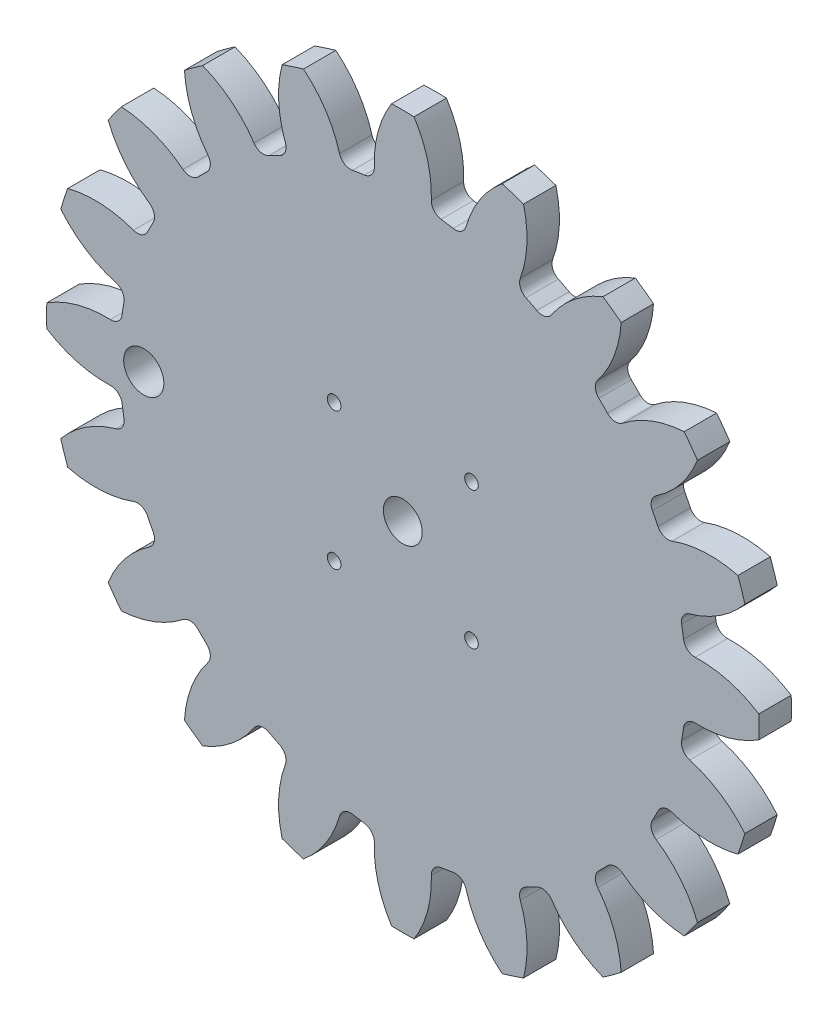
ISO-10303-21;
HEADER;
FILE_DESCRIPTION(('STEP AP214'),'2;1');
FILE_NAME('part.step','',(''),(''),'','','');
FILE_SCHEMA(('AUTOMOTIVE_DESIGN { 1 0 10303 214 1 1 1 1 }'));
ENDSEC;
DATA;
#1=APPLICATION_CONTEXT('core data for automotive mechanical design processes');
#2=APPLICATION_PROTOCOL_DEFINITION('international standard','automotive_design',2000,#1);
#3=PRODUCT_CONTEXT('',#1,'mechanical');
#4=PRODUCT('Part','Part','',(#3));
#5=PRODUCT_RELATED_PRODUCT_CATEGORY('part','',(#4));
#6=PRODUCT_DEFINITION_FORMATION('','',#4);
#7=PRODUCT_DEFINITION_CONTEXT('part definition',#1,'design');
#8=PRODUCT_DEFINITION('design','',#6,#7);
#9=PRODUCT_DEFINITION_SHAPE('','',#8);
#10=(LENGTH_UNIT() NAMED_UNIT(*) SI_UNIT(.MILLI.,.METRE.));
#11=(NAMED_UNIT(*) PLANE_ANGLE_UNIT() SI_UNIT($,.RADIAN.));
#12=(NAMED_UNIT(*) SI_UNIT($,.STERADIAN.) SOLID_ANGLE_UNIT());
#13=UNCERTAINTY_MEASURE_WITH_UNIT(LENGTH_MEASURE(1.E-05),#10,'distance_accuracy_value','');
#14=(GEOMETRIC_REPRESENTATION_CONTEXT(3) GLOBAL_UNCERTAINTY_ASSIGNED_CONTEXT((#13)) GLOBAL_UNIT_ASSIGNED_CONTEXT((#10,
#11,#12)) REPRESENTATION_CONTEXT('',''));
#15=CARTESIAN_POINT('',(0.,0.,0.));
#16=DIRECTION('',(0.,0.,1.));
#17=DIRECTION('',(1.,0.,0.));
#18=AXIS2_PLACEMENT_3D('',#15,#16,#17);
#19=CARTESIAN_POINT('',(0.,0.,5.));
#20=DIRECTION('',(0.,0.,-1.));
#21=DIRECTION('',(-1.,0.,0.));
#22=AXIS2_PLACEMENT_3D('',#19,#20,#21);
#23=CYLINDRICAL_SURFACE('',#22,43.75);
#24=CARTESIAN_POINT('',(0.,0.,5.));
#25=DIRECTION('',(0.,0.,1.));
#26=DIRECTION('',(1.,0.,0.));
#27=AXIS2_PLACEMENT_3D('',#24,#25,#26);
#28=CIRCLE('',#27,43.75);
#29=CARTESIAN_POINT('',(7.77047549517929,43.0544098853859,5.));
#30=VERTEX_POINT('',#29);
#31=CARTESIAN_POINT('',(5.91438298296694,43.3483860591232,5.));
#32=VERTEX_POINT('',#31);
#33=EDGE_CURVE('E1265',#30,#32,#28,.T.);
#34=ORIENTED_EDGE('',*,*,#33,.F.);
#35=DIRECTION('',(0.,0.,-1.));
#36=VECTOR('',#35,1.);
#37=CARTESIAN_POINT('',(7.77047549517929,43.0544098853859,5.));
#38=LINE('',#37,#36);
#39=CARTESIAN_POINT('',(7.77047549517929,43.0544098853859,0.));
#40=VERTEX_POINT('',#39);
#41=EDGE_CURVE('E1309',#30,#40,#38,.T.);
#42=ORIENTED_EDGE('',*,*,#41,.T.);
#43=CARTESIAN_POINT('',(0.,0.,0.));
#44=DIRECTION('',(0.,0.,1.));
#45=DIRECTION('',(1.,0.,0.));
#46=AXIS2_PLACEMENT_3D('',#43,#44,#45);
#47=CIRCLE('',#46,43.75);
#48=CARTESIAN_POINT('',(5.91438298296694,43.3483860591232,0.));
#49=VERTEX_POINT('',#48);
#50=EDGE_CURVE('E1253',#40,#49,#47,.T.);
#51=ORIENTED_EDGE('',*,*,#50,.T.);
#52=DIRECTION('',(0.,0.,-1.));
#53=VECTOR('',#52,1.);
#54=CARTESIAN_POINT('',(5.91438298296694,43.3483860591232,5.));
#55=LINE('',#54,#53);
#56=EDGE_CURVE('E1285',#49,#32,#55,.F.);
#57=ORIENTED_EDGE('',*,*,#56,.T.);
#58=EDGE_LOOP('',(#34,#42,#51,#57));
#59=FACE_BOUND('',#58,.T.);
#60=ADVANCED_FACE('F31',(#59),#23,.T.);
#61=CARTESIAN_POINT('',(-12.7321741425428,45.773478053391,5.));
#62=DIRECTION('',(0.,0.,-1.));
#63=DIRECTION('',(-1.,0.,0.));
#64=AXIS2_PLACEMENT_3D('',#61,#62,#63);
#65=CYLINDRICAL_SURFACE('',#64,17.1457769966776);
#66=CARTESIAN_POINT('',(-12.7321741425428,45.773478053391,5.));
#67=DIRECTION('',(0.,0.,-1.));
#68=DIRECTION('',(-1.,0.,0.));
#69=AXIS2_PLACEMENT_3D('',#66,#67,#68);
#70=CIRCLE('',#69,17.1457769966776);
#71=CARTESIAN_POINT('',(1.73691112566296,54.9725671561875,5.));
#72=VERTEX_POINT('',#71);
#73=CARTESIAN_POINT('',(4.40212935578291,45.1463317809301,5.));
#74=VERTEX_POINT('',#73);
#75=EDGE_CURVE('E1267',#72,#74,#70,.T.);
#76=ORIENTED_EDGE('',*,*,#75,.T.);
#77=DIRECTION('',(0.,0.,-1.));
#78=VECTOR('',#77,1.);
#79=CARTESIAN_POINT('',(4.40212935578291,45.1463317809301,5.));
#80=LINE('',#79,#78);
#81=CARTESIAN_POINT('',(4.40212935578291,45.1463317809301,0.));
#82=VERTEX_POINT('',#81);
#83=EDGE_CURVE('E1282',#74,#82,#80,.T.);
#84=ORIENTED_EDGE('',*,*,#83,.T.);
#85=CARTESIAN_POINT('',(-12.7321741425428,45.773478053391,0.));
#86=DIRECTION('',(0.,0.,-1.));
#87=DIRECTION('',(-1.,0.,0.));
#88=AXIS2_PLACEMENT_3D('',#85,#86,#87);
#89=CIRCLE('',#88,17.1457769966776);
#90=CARTESIAN_POINT('',(1.73691112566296,54.9725671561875,0.));
#91=VERTEX_POINT('',#90);
#92=EDGE_CURVE('E1255',#91,#82,#89,.T.);
#93=ORIENTED_EDGE('',*,*,#92,.F.);
#94=DIRECTION('',(0.,0.,-1.));
#95=VECTOR('',#94,1.);
#96=CARTESIAN_POINT('',(1.73691112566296,54.9725671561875,5.));
#97=LINE('',#96,#95);
#98=EDGE_CURVE('E1280',#72,#91,#97,.T.);
#99=ORIENTED_EDGE('',*,*,#98,.F.);
#100=EDGE_LOOP('',(#76,#84,#93,#99));
#101=FACE_BOUND('',#100,.T.);
#102=ADVANCED_FACE('F1702',(#101),#65,.T.);
#103=CARTESIAN_POINT('',(0.,0.,5.));
#104=DIRECTION('',(0.,0.,-1.));
#105=DIRECTION('',(-1.,0.,0.));
#106=AXIS2_PLACEMENT_3D('',#103,#104,#105);
#107=CYLINDRICAL_SURFACE('',#106,55.);
#108=CARTESIAN_POINT('',(0.,0.,0.));
#109=DIRECTION('',(0.,0.,1.));
#110=DIRECTION('',(1.,0.,0.));
#111=AXIS2_PLACEMENT_3D('',#108,#109,#110);
#112=CIRCLE('',#111,55.);
#113=CARTESIAN_POINT('',(-1.73691112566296,54.9725671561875,0.));
#114=VERTEX_POINT('',#113);
#115=EDGE_CURVE('E1258',#91,#114,#112,.T.);
#116=ORIENTED_EDGE('',*,*,#115,.T.);
#117=DIRECTION('',(0.,0.,-1.));
#118=VECTOR('',#117,1.);
#119=CARTESIAN_POINT('',(-1.73691112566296,54.9725671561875,5.));
#120=LINE('',#119,#118);
#121=CARTESIAN_POINT('',(-1.73691112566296,54.9725671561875,5.));
#122=VERTEX_POINT('',#121);
#123=EDGE_CURVE('E1277',#122,#114,#120,.T.);
#124=ORIENTED_EDGE('',*,*,#123,.F.);
#125=CARTESIAN_POINT('',(0.,0.,5.));
#126=DIRECTION('',(0.,0.,1.));
#127=DIRECTION('',(1.,0.,0.));
#128=AXIS2_PLACEMENT_3D('',#125,#126,#127);
#129=CIRCLE('',#128,55.);
#130=EDGE_CURVE('E1270',#72,#122,#129,.T.);
#131=ORIENTED_EDGE('',*,*,#130,.F.);
#132=ORIENTED_EDGE('',*,*,#98,.T.);
#133=EDGE_LOOP('',(#116,#124,#131,#132));
#134=FACE_BOUND('',#133,.T.);
#135=ADVANCED_FACE('F1698',(#134),#107,.T.);
#136=CARTESIAN_POINT('',(12.7321741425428,45.773478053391,5.));
#137=DIRECTION('',(0.,0.,-1.));
#138=DIRECTION('',(-1.,0.,0.));
#139=AXIS2_PLACEMENT_3D('',#136,#137,#138);
#140=CYLINDRICAL_SURFACE('',#139,17.1457769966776);
#141=CARTESIAN_POINT('',(12.7321741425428,45.773478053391,0.));
#142=DIRECTION('',(0.,0.,1.));
#143=DIRECTION('',(1.,0.,0.));
#144=AXIS2_PLACEMENT_3D('',#141,#142,#143);
#145=CIRCLE('',#144,17.1457769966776);
#146=CARTESIAN_POINT('',(-4.40212935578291,45.1463317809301,0.));
#147=VERTEX_POINT('',#146);
#148=EDGE_CURVE('E1260',#114,#147,#145,.T.);
#149=ORIENTED_EDGE('',*,*,#148,.T.);
#150=DIRECTION('',(0.,0.,-1.));
#151=VECTOR('',#150,1.);
#152=CARTESIAN_POINT('',(-4.40212935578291,45.1463317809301,5.));
#153=LINE('',#152,#151);
#154=CARTESIAN_POINT('',(-4.40212935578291,45.1463317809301,5.));
#155=VERTEX_POINT('',#154);
#156=EDGE_CURVE('E1291',#147,#155,#153,.F.);
#157=ORIENTED_EDGE('',*,*,#156,.T.);
#158=CARTESIAN_POINT('',(12.7321741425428,45.773478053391,5.));
#159=DIRECTION('',(0.,0.,1.));
#160=DIRECTION('',(1.,0.,0.));
#161=AXIS2_PLACEMENT_3D('',#158,#159,#160);
#162=CIRCLE('',#161,17.1457769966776);
#163=EDGE_CURVE('E1272',#122,#155,#162,.T.);
#164=ORIENTED_EDGE('',*,*,#163,.F.);
#165=ORIENTED_EDGE('',*,*,#123,.T.);
#166=EDGE_LOOP('',(#149,#157,#164,#165));
#167=FACE_BOUND('',#166,.T.);
#168=ADVANCED_FACE('F1693',(#167),#140,.T.);
#169=CARTESIAN_POINT('',(0.,0.,5.));
#170=DIRECTION('',(0.,0.,-1.));
#171=DIRECTION('',(-1.,0.,0.));
#172=AXIS2_PLACEMENT_3D('',#169,#170,#171);
#173=CYLINDRICAL_SURFACE('',#172,43.75);
#174=CARTESIAN_POINT('',(0.,0.,0.));
#175=DIRECTION('',(0.,0.,-1.));
#176=DIRECTION('',(-1.,0.,0.));
#177=AXIS2_PLACEMENT_3D('',#174,#175,#176);
#178=CIRCLE('',#177,43.75);
#179=CARTESIAN_POINT('',(-7.7704754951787,43.054409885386,0.));
#180=VERTEX_POINT('',#179);
#181=CARTESIAN_POINT('',(-5.91438298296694,43.3483860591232,0.));
#182=VERTEX_POINT('',#181);
#183=EDGE_CURVE('E1263',#180,#182,#178,.T.);
#184=ORIENTED_EDGE('',*,*,#183,.F.);
#185=DIRECTION('',(0.,0.,-1.));
#186=VECTOR('',#185,1.);
#187=CARTESIAN_POINT('',(-7.7704754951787,43.054409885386,5.));
#188=LINE('',#187,#186);
#189=CARTESIAN_POINT('',(-7.7704754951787,43.054409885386,5.));
#190=VERTEX_POINT('',#189);
#191=EDGE_CURVE('E1664',#180,#190,#188,.F.);
#192=ORIENTED_EDGE('',*,*,#191,.T.);
#193=CARTESIAN_POINT('',(0.,0.,5.));
#194=DIRECTION('',(0.,0.,-1.));
#195=DIRECTION('',(-1.,0.,0.));
#196=AXIS2_PLACEMENT_3D('',#193,#194,#195);
#197=CIRCLE('',#196,43.75);
#198=CARTESIAN_POINT('',(-5.91438298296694,43.3483860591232,5.));
#199=VERTEX_POINT('',#198);
#200=EDGE_CURVE('E1275',#190,#199,#197,.T.);
#201=ORIENTED_EDGE('',*,*,#200,.T.);
#202=DIRECTION('',(0.,0.,-1.));
#203=VECTOR('',#202,1.);
#204=CARTESIAN_POINT('',(-5.91438298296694,43.3483860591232,5.));
#205=LINE('',#204,#203);
#206=EDGE_CURVE('E1288',#199,#182,#205,.T.);
#207=ORIENTED_EDGE('',*,*,#206,.T.);
#208=EDGE_LOOP('',(#184,#192,#201,#207));
#209=FACE_BOUND('',#208,.T.);
#210=ADVANCED_FACE('F1684',(#209),#173,.T.);
#211=CARTESIAN_POINT('',(0.,0.,5.));
#212=DIRECTION('',(0.,0.,1.));
#213=DIRECTION('',(1.,0.,0.));
#214=AXIS2_PLACEMENT_3D('',#211,#212,#213);
#215=PLANE('',#214);
#216=CARTESIAN_POINT('',(-40.,0.,5.));
#217=DIRECTION('',(0.,0.,1.));
#218=DIRECTION('',(1.,0.,0.));
#219=AXIS2_PLACEMENT_3D('',#216,#217,#218);
#220=CIRCLE('',#219,3.1);
#221=CARTESIAN_POINT('',(-36.9,0.,5.));
#222=VERTEX_POINT('',#221);
#223=EDGE_CURVE('E2668',#222,#222,#220,.T.);
#224=ORIENTED_EDGE('',*,*,#223,.F.);
#225=EDGE_LOOP('',(#224));
#226=FACE_BOUND('',#225,.T.);
#227=CARTESIAN_POINT('',(10.6066017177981,10.6066017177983,5.));
#228=DIRECTION('',(0.,0.,1.));
#229=DIRECTION('',(-1.,0.,0.));
#230=AXIS2_PLACEMENT_3D('',#227,#228,#229);
#231=CIRCLE('',#230,1.05);
#232=CARTESIAN_POINT('',(9.55660171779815,10.6066017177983,5.));
#233=VERTEX_POINT('',#232);
#234=EDGE_CURVE('E2670',#233,#233,#231,.T.);
#235=ORIENTED_EDGE('',*,*,#234,.F.);
#236=EDGE_LOOP('',(#235));
#237=FACE_BOUND('',#236,.T.);
#238=CARTESIAN_POINT('',(-10.6066017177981,-10.6066017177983,5.));
#239=DIRECTION('',(0.,0.,1.));
#240=DIRECTION('',(1.,0.,0.));
#241=AXIS2_PLACEMENT_3D('',#238,#239,#240);
#242=CIRCLE('',#241,1.05);
#243=CARTESIAN_POINT('',(-9.55660171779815,-10.6066017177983,5.));
#244=VERTEX_POINT('',#243);
#245=EDGE_CURVE('E2678',#244,#244,#242,.T.);
#246=ORIENTED_EDGE('',*,*,#245,.F.);
#247=EDGE_LOOP('',(#246));
#248=FACE_BOUND('',#247,.T.);
#249=CARTESIAN_POINT('',(10.6066017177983,-10.6066017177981,5.));
#250=DIRECTION('',(0.,0.,1.));
#251=DIRECTION('',(1.,0.,0.));
#252=AXIS2_PLACEMENT_3D('',#249,#250,#251);
#253=CIRCLE('',#252,1.05);
#254=CARTESIAN_POINT('',(11.6566017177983,-10.6066017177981,5.));
#255=VERTEX_POINT('',#254);
#256=EDGE_CURVE('E2684',#255,#255,#253,.T.);
#257=ORIENTED_EDGE('',*,*,#256,.F.);
#258=EDGE_LOOP('',(#257));
#259=FACE_BOUND('',#258,.T.);
#260=CARTESIAN_POINT('',(-10.6066017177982,10.6066017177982,5.));
#261=DIRECTION('',(0.,0.,1.));
#262=DIRECTION('',(1.,0.,0.));
#263=AXIS2_PLACEMENT_3D('',#260,#261,#262);
#264=CIRCLE('',#263,1.05);
#265=CARTESIAN_POINT('',(-9.55660171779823,10.6066017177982,5.));
#266=VERTEX_POINT('',#265);
#267=EDGE_CURVE('E2690',#266,#266,#264,.T.);
#268=ORIENTED_EDGE('',*,*,#267,.F.);
#269=EDGE_LOOP('',(#268));
#270=FACE_BOUND('',#269,.T.);
#271=CARTESIAN_POINT('',(0.,0.,5.));
#272=DIRECTION('',(0.,0.,1.));
#273=DIRECTION('',(1.,0.,0.));
#274=AXIS2_PLACEMENT_3D('',#271,#272,#273);
#275=CIRCLE('',#274,3.);
#276=CARTESIAN_POINT('',(3.,0.,5.));
#277=VERTEX_POINT('',#276);
#278=EDGE_CURVE('E793',#277,#277,#275,.T.);
#279=ORIENTED_EDGE('',*,*,#278,.F.);
#280=EDGE_LOOP('',(#279));
#281=FACE_BOUND('',#280,.T.);
#282=CARTESIAN_POINT('',(26.2537997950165,39.5987063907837,5.));
#283=DIRECTION('',(0.,0.,1.));
#284=DIRECTION('',(0.951056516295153,-0.309016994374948,0.));
#285=AXIS2_PLACEMENT_3D('',#282,#283,#284);
#286=CIRCLE('',#285,17.1457769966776);
#287=CARTESIAN_POINT('',(15.3355568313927,52.8187532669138,5.));
#288=VERTEX_POINT('',#287);
#289=CARTESIAN_POINT('',(9.7643099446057,44.2970458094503,5.));
#290=VERTEX_POINT('',#289);
#291=EDGE_CURVE('E1245',#288,#290,#286,.T.);
#292=ORIENTED_EDGE('',*,*,#291,.T.);
#293=CARTESIAN_POINT('',(8.08129451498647,44.7765862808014,5.));
#294=DIRECTION('',(0.,0.,1.));
#295=DIRECTION('',(1.,0.,0.));
#296=AXIS2_PLACEMENT_3D('',#293,#294,#295);
#297=CIRCLE('',#296,1.75);
#298=EDGE_CURVE('E1321',#290,#30,#297,.F.);
#299=ORIENTED_EDGE('',*,*,#298,.T.);
#300=ORIENTED_EDGE('',*,*,#33,.T.);
#301=CARTESIAN_POINT('',(6.15095830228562,45.0823215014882,5.));
#302=DIRECTION('',(0.,0.,1.));
#303=DIRECTION('',(1.,0.,0.));
#304=AXIS2_PLACEMENT_3D('',#301,#302,#303);
#305=CIRCLE('',#304,1.75);
#306=EDGE_CURVE('E1296',#32,#74,#305,.F.);
#307=ORIENTED_EDGE('',*,*,#306,.T.);
#308=ORIENTED_EDGE('',*,*,#75,.F.);
#309=ORIENTED_EDGE('',*,*,#130,.T.);
#310=ORIENTED_EDGE('',*,*,#163,.T.);
#311=CARTESIAN_POINT('',(-6.15095830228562,45.0823215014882,5.));
#312=DIRECTION('',(0.,0.,1.));
#313=DIRECTION('',(1.,0.,0.));
#314=AXIS2_PLACEMENT_3D('',#311,#312,#313);
#315=CIRCLE('',#314,1.75);
#316=EDGE_CURVE('E1300',#155,#199,#315,.F.);
#317=ORIENTED_EDGE('',*,*,#316,.T.);
#318=ORIENTED_EDGE('',*,*,#200,.F.);
#319=CARTESIAN_POINT('',(-8.08129451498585,44.7765862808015,5.));
#320=DIRECTION('',(0.,0.,1.));
#321=DIRECTION('',(1.,0.,0.));
#322=AXIS2_PLACEMENT_3D('',#319,#320,#321);
#323=CIRCLE('',#322,1.75);
#324=CARTESIAN_POINT('',(-9.76430994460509,44.2970458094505,5.));
#325=VERTEX_POINT('',#324);
#326=EDGE_CURVE('E1672',#190,#325,#323,.F.);
#327=ORIENTED_EDGE('',*,*,#326,.T.);
#328=CARTESIAN_POINT('',(-26.253799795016,39.5987063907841,5.));
#329=DIRECTION('',(0.,0.,-1.));
#330=DIRECTION('',(-0.951056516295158,-0.309016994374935,0.));
#331=AXIS2_PLACEMENT_3D('',#328,#329,#330);
#332=CIRCLE('',#331,17.1457769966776);
#333=CARTESIAN_POINT('',(-15.335556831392,52.8187532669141,5.));
#334=VERTEX_POINT('',#333);
#335=EDGE_CURVE('E798',#334,#325,#332,.T.);
#336=ORIENTED_EDGE('',*,*,#335,.F.);
#337=CARTESIAN_POINT('',(0.,0.,5.));
#338=DIRECTION('',(0.,0.,1.));
#339=DIRECTION('',(0.951056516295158,0.309016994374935,0.));
#340=AXIS2_PLACEMENT_3D('',#337,#338,#339);
#341=CIRCLE('',#340,55.);
#342=CARTESIAN_POINT('',(-18.6393581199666,51.7452831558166,5.));
#343=VERTEX_POINT('',#342);
#344=EDGE_CURVE('E773',#334,#343,#341,.T.);
#345=ORIENTED_EDGE('',*,*,#344,.T.);
#346=CARTESIAN_POINT('',(-2.03576542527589,47.4676227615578,5.));
#347=DIRECTION('',(0.,0.,1.));
#348=DIRECTION('',(0.951056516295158,0.309016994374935,0.));
#349=AXIS2_PLACEMENT_3D('',#346,#347,#348);
#350=CIRCLE('',#349,17.1457769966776);
#351=CARTESIAN_POINT('',(-18.1376575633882,41.5763802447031,5.));
#352=VERTEX_POINT('',#351);
#353=EDGE_CURVE('E801',#343,#352,#350,.T.);
#354=ORIENTED_EDGE('',*,*,#353,.T.);
#355=CARTESIAN_POINT('',(-19.7811124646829,40.9750849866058,5.));
#356=DIRECTION('',(0.,0.,1.));
#357=DIRECTION('',(1.,0.,0.));
#358=AXIS2_PLACEMENT_3D('',#355,#356,#357);
#359=CIRCLE('',#358,1.75);
#360=CARTESIAN_POINT('',(-19.0203004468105,39.3991201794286,5.));
#361=VERTEX_POINT('',#360);
#362=EDGE_CURVE('E11',#352,#361,#359,.F.);
#363=ORIENTED_EDGE('',*,*,#362,.T.);
#364=CARTESIAN_POINT('',(0.,0.,5.));
#365=DIRECTION('',(0.,0.,1.));
#366=DIRECTION('',(0.809016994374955,0.587785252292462,0.));
#367=AXIS2_PLACEMENT_3D('',#364,#365,#366);
#368=CIRCLE('',#367,43.75);
#369=CARTESIAN_POINT('',(-20.6947056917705,38.5459680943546,5.));
#370=VERTEX_POINT('',#369);
#371=EDGE_CURVE('E813',#361,#370,#368,.T.);
#372=ORIENTED_EDGE('',*,*,#371,.T.);
#373=CARTESIAN_POINT('',(-21.5224939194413,40.0878068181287,5.));
#374=DIRECTION('',(0.,0.,1.));
#375=DIRECTION('',(1.,0.,0.));
#376=AXIS2_PLACEMENT_3D('',#373,#374,#375);
#377=CIRCLE('',#376,1.75);
#378=CARTESIAN_POINT('',(-22.974950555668,39.1116563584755,5.));
#379=VERTEX_POINT('',#378);
#380=EDGE_CURVE('E1657',#370,#379,#377,.F.);
#381=ORIENTED_EDGE('',*,*,#380,.T.);
#382=CARTESIAN_POINT('',(-37.2055206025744,29.5477374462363,5.));
#383=DIRECTION('',(0.,0.,-1.));
#384=DIRECTION('',(-0.809016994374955,-0.587785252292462,0.));
#385=AXIS2_PLACEMENT_3D('',#382,#383,#384);
#386=CIRCLE('',#385,17.1457769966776);
#387=CARTESIAN_POINT('',(-30.9068736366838,45.4946717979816,5.));
#388=VERTEX_POINT('',#387);
#389=EDGE_CURVE('E815',#388,#379,#386,.T.);
#390=ORIENTED_EDGE('',*,*,#389,.F.);
#391=CARTESIAN_POINT('',(0.,0.,5.));
#392=DIRECTION('',(0.,0.,1.));
#393=DIRECTION('',(0.809016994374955,0.587785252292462,0.));
#394=AXIS2_PLACEMENT_3D('',#391,#392,#393);
#395=CIRCLE('',#394,55.);
#396=CARTESIAN_POINT('',(-33.7172548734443,43.4528103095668,5.));
#397=VERTEX_POINT('',#396);
#398=EDGE_CURVE('E818',#388,#397,#395,.T.);
#399=ORIENTED_EDGE('',*,*,#398,.T.);
#400=CARTESIAN_POINT('',(-16.6044300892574,44.5153058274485,5.));
#401=DIRECTION('',(0.,0.,1.));
#402=DIRECTION('',(0.809016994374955,0.587785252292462,0.));
#403=AXIS2_PLACEMENT_3D('',#400,#401,#402);
#404=CIRCLE('',#403,17.1457769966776);
#405=CARTESIAN_POINT('',(-30.0977454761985,33.9366429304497,5.));
#406=VERTEX_POINT('',#405);
#407=EDGE_CURVE('E820',#397,#406,#404,.T.);
#408=ORIENTED_EDGE('',*,*,#407,.T.);
#409=CARTESIAN_POINT('',(-31.4749535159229,32.85692166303,5.));
#410=DIRECTION('',(0.,0.,1.));
#411=DIRECTION('',(1.,0.,0.));
#412=AXIS2_PLACEMENT_3D('',#409,#410,#411);
#413=CIRCLE('',#412,1.75);
#414=CARTESIAN_POINT('',(-30.2643783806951,31.5931939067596,5.));
#415=VERTEX_POINT('',#414);
#416=EDGE_CURVE('E1661',#406,#415,#413,.F.);
#417=ORIENTED_EDGE('',*,*,#416,.T.);
#418=CARTESIAN_POINT('',(0.,0.,5.));
#419=DIRECTION('',(0.,0.,1.));
#420=DIRECTION('',(0.587785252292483,0.80901699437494,0.));
#421=AXIS2_PLACEMENT_3D('',#418,#419,#420);
#422=CIRCLE('',#421,43.75);
#423=CARTESIAN_POINT('',(-31.5931939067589,30.2643783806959,5.));
#424=VERTEX_POINT('',#423);
#425=EDGE_CURVE('E838',#415,#424,#422,.T.);
#426=ORIENTED_EDGE('',*,*,#425,.T.);
#427=CARTESIAN_POINT('',(-32.8569216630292,31.4749535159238,5.));
#428=DIRECTION('',(0.,0.,1.));
#429=DIRECTION('',(1.,0.,0.));
#430=AXIS2_PLACEMENT_3D('',#427,#428,#429);
#431=CIRCLE('',#430,1.75);
#432=CARTESIAN_POINT('',(-33.9366429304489,30.0977454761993,5.));
#433=VERTEX_POINT('',#432);
#434=EDGE_CURVE('E1637',#424,#433,#431,.F.);
#435=ORIENTED_EDGE('',*,*,#434,.T.);
#436=CARTESIAN_POINT('',(-44.5153058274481,16.6044300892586,5.));
#437=DIRECTION('',(0.,0.,-1.));
#438=DIRECTION('',(-0.587785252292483,-0.80901699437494,0.));
#439=AXIS2_PLACEMENT_3D('',#436,#437,#438);
#440=CIRCLE('',#439,17.1457769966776);
#441=CARTESIAN_POINT('',(-43.452810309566,33.7172548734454,5.));
#442=VERTEX_POINT('',#441);
#443=EDGE_CURVE('E840',#442,#433,#440,.T.);
#444=ORIENTED_EDGE('',*,*,#443,.F.);
#445=CARTESIAN_POINT('',(0.,0.,5.));
#446=DIRECTION('',(0.,0.,1.));
#447=DIRECTION('',(0.587785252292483,0.80901699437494,0.));
#448=AXIS2_PLACEMENT_3D('',#445,#446,#447);
#449=CIRCLE('',#448,55.);
#450=CARTESIAN_POINT('',(-45.4946717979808,30.9068736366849,5.));
#451=VERTEX_POINT('',#450);
#452=EDGE_CURVE('E843',#442,#451,#449,.T.);
#453=ORIENTED_EDGE('',*,*,#452,.T.);
#454=CARTESIAN_POINT('',(-29.5477374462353,37.2055206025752,5.));
#455=DIRECTION('',(0.,0.,1.));
#456=DIRECTION('',(0.587785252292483,0.80901699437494,0.));
#457=AXIS2_PLACEMENT_3D('',#454,#455,#456);
#458=CIRCLE('',#457,17.1457769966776);
#459=CARTESIAN_POINT('',(-39.1116563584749,22.974950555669,5.));
#460=VERTEX_POINT('',#459);
#461=EDGE_CURVE('E845',#451,#460,#458,.T.);
#462=ORIENTED_EDGE('',*,*,#461,.T.);
#463=CARTESIAN_POINT('',(-40.0878068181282,21.5224939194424,5.));
#464=DIRECTION('',(0.,0.,1.));
#465=DIRECTION('',(1.,0.,0.));
#466=AXIS2_PLACEMENT_3D('',#463,#464,#465);
#467=CIRCLE('',#466,1.75);
#468=CARTESIAN_POINT('',(-38.545968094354,20.6947056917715,5.));
#469=VERTEX_POINT('',#468);
#470=EDGE_CURVE('E1641',#460,#469,#467,.F.);
#471=ORIENTED_EDGE('',*,*,#470,.T.);
#472=CARTESIAN_POINT('',(0.,0.,5.));
#473=DIRECTION('',(0.,0.,1.));
#474=DIRECTION('',(0.309016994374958,0.95105651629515,0.));
#475=AXIS2_PLACEMENT_3D('',#472,#473,#474);
#476=CIRCLE('',#475,43.75);
#477=CARTESIAN_POINT('',(-39.3991201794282,19.0203004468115,5.));
#478=VERTEX_POINT('',#477);
#479=EDGE_CURVE('E863',#469,#478,#476,.T.);
#480=ORIENTED_EDGE('',*,*,#479,.T.);
#481=CARTESIAN_POINT('',(-40.9750849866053,19.7811124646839,5.));
#482=DIRECTION('',(0.,0.,1.));
#483=DIRECTION('',(1.,0.,0.));
#484=AXIS2_PLACEMENT_3D('',#481,#482,#483);
#485=CIRCLE('',#484,1.75);
#486=CARTESIAN_POINT('',(-41.5763802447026,18.1376575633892,5.));
#487=VERTEX_POINT('',#486);
#488=EDGE_CURVE('E1617',#478,#487,#485,.F.);
#489=ORIENTED_EDGE('',*,*,#488,.T.);
#490=CARTESIAN_POINT('',(-47.4676227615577,2.03576542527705,5.));
#491=DIRECTION('',(0.,0.,-1.));
#492=DIRECTION('',(-0.309016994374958,-0.95105651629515,0.));
#493=AXIS2_PLACEMENT_3D('',#490,#491,#492);
#494=CIRCLE('',#493,17.1457769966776);
#495=CARTESIAN_POINT('',(-51.7452831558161,18.6393581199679,5.));
#496=VERTEX_POINT('',#495);
#497=EDGE_CURVE('E865',#496,#487,#494,.T.);
#498=ORIENTED_EDGE('',*,*,#497,.F.);
#499=CARTESIAN_POINT('',(0.,0.,5.));
#500=DIRECTION('',(0.,0.,1.));
#501=DIRECTION('',(0.309016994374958,0.95105651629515,0.));
#502=AXIS2_PLACEMENT_3D('',#499,#500,#501);
#503=CIRCLE('',#502,55.);
#504=CARTESIAN_POINT('',(-52.8187532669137,15.3355568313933,5.));
#505=VERTEX_POINT('',#504);
#506=EDGE_CURVE('E868',#496,#505,#503,.T.);
#507=ORIENTED_EDGE('',*,*,#506,.T.);
#508=CARTESIAN_POINT('',(-39.5987063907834,26.253799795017,5.));
#509=DIRECTION('',(0.,0.,1.));
#510=DIRECTION('',(0.309016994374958,0.95105651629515,0.));
#511=AXIS2_PLACEMENT_3D('',#508,#509,#510);
#512=CIRCLE('',#511,17.1457769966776);
#513=CARTESIAN_POINT('',(-44.2970458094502,9.76430994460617,5.));
#514=VERTEX_POINT('',#513);
#515=EDGE_CURVE('E870',#505,#514,#512,.T.);
#516=ORIENTED_EDGE('',*,*,#515,.T.);
#517=CARTESIAN_POINT('',(-44.7765862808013,8.08129451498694,5.));
#518=DIRECTION('',(0.,0.,1.));
#519=DIRECTION('',(1.,0.,0.));
#520=AXIS2_PLACEMENT_3D('',#517,#518,#519);
#521=CIRCLE('',#520,1.75);
#522=CARTESIAN_POINT('',(-43.0544098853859,7.77047549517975,5.));
#523=VERTEX_POINT('',#522);
#524=EDGE_CURVE('E1621',#514,#523,#521,.F.);
#525=ORIENTED_EDGE('',*,*,#524,.T.);
#526=CARTESIAN_POINT('',(0.,0.,5.));
#527=DIRECTION('',(0.,0.,1.));
#528=DIRECTION('',(0.,1.,0.));
#529=AXIS2_PLACEMENT_3D('',#526,#527,#528);
#530=CIRCLE('',#529,43.75);
#531=CARTESIAN_POINT('',(-43.3483860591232,5.91438298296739,5.));
#532=VERTEX_POINT('',#531);
#533=EDGE_CURVE('E888',#523,#532,#530,.T.);
#534=ORIENTED_EDGE('',*,*,#533,.T.);
#535=CARTESIAN_POINT('',(-45.0823215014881,6.15095830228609,5.));
#536=DIRECTION('',(0.,0.,1.));
#537=DIRECTION('',(1.,0.,0.));
#538=AXIS2_PLACEMENT_3D('',#535,#536,#537);
#539=CIRCLE('',#538,1.75);
#540=CARTESIAN_POINT('',(-45.1463317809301,4.40212935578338,5.));
#541=VERTEX_POINT('',#540);
#542=EDGE_CURVE('E1597',#532,#541,#539,.F.);
#543=ORIENTED_EDGE('',*,*,#542,.T.);
#544=CARTESIAN_POINT('',(-45.7734780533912,-12.7321741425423,5.));
#545=DIRECTION('',(0.,0.,-1.));
#546=DIRECTION('',(0.,-1.,0.));
#547=AXIS2_PLACEMENT_3D('',#544,#545,#546);
#548=CIRCLE('',#547,17.1457769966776);
#549=CARTESIAN_POINT('',(-54.9725671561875,1.73691112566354,5.));
#550=VERTEX_POINT('',#549);
#551=EDGE_CURVE('E890',#550,#541,#548,.T.);
#552=ORIENTED_EDGE('',*,*,#551,.F.);
#553=CARTESIAN_POINT('',(0.,0.,5.));
#554=DIRECTION('',(0.,0.,1.));
#555=DIRECTION('',(0.,1.,0.));
#556=AXIS2_PLACEMENT_3D('',#553,#554,#555);
#557=CIRCLE('',#556,55.);
#558=CARTESIAN_POINT('',(-54.9725671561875,-1.73691112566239,5.));
#559=VERTEX_POINT('',#558);
#560=EDGE_CURVE('E893',#550,#559,#557,.T.);
#561=ORIENTED_EDGE('',*,*,#560,.T.);
#562=CARTESIAN_POINT('',(-45.7734780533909,12.7321741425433,5.));
#563=DIRECTION('',(0.,0.,1.));
#564=DIRECTION('',(0.,1.,0.));
#565=AXIS2_PLACEMENT_3D('',#562,#563,#564);
#566=CIRCLE('',#565,17.1457769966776);
#567=CARTESIAN_POINT('',(-45.1463317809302,-4.40212935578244,5.));
#568=VERTEX_POINT('',#567);
#569=EDGE_CURVE('E895',#559,#568,#566,.T.);
#570=ORIENTED_EDGE('',*,*,#569,.T.);
#571=CARTESIAN_POINT('',(-45.0823215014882,-6.15095830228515,5.));
#572=DIRECTION('',(0.,0.,1.));
#573=DIRECTION('',(1.,0.,0.));
#574=AXIS2_PLACEMENT_3D('',#571,#572,#573);
#575=CIRCLE('',#574,1.75);
#576=CARTESIAN_POINT('',(-43.3483860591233,-5.91438298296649,5.));
#577=VERTEX_POINT('',#576);
#578=EDGE_CURVE('E1601',#568,#577,#575,.F.);
#579=ORIENTED_EDGE('',*,*,#578,.T.);
#580=CARTESIAN_POINT('',(0.,0.,5.));
#581=DIRECTION('',(0.,0.,1.));
#582=DIRECTION('',(-0.309016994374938,0.951056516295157,0.));
#583=AXIS2_PLACEMENT_3D('',#580,#581,#582);
#584=CIRCLE('',#583,43.75);
#585=CARTESIAN_POINT('',(-43.054409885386,-7.77047549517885,5.));
#586=VERTEX_POINT('',#585);
#587=EDGE_CURVE('E913',#577,#586,#584,.T.);
#588=ORIENTED_EDGE('',*,*,#587,.T.);
#589=CARTESIAN_POINT('',(-44.7765862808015,-8.081294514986,5.));
#590=DIRECTION('',(0.,0.,1.));
#591=DIRECTION('',(1.,0.,0.));
#592=AXIS2_PLACEMENT_3D('',#589,#590,#591);
#593=CIRCLE('',#592,1.75);
#594=CARTESIAN_POINT('',(-44.2970458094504,-9.76430994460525,5.));
#595=VERTEX_POINT('',#594);
#596=EDGE_CURVE('E1577',#586,#595,#593,.F.);
#597=ORIENTED_EDGE('',*,*,#596,.T.);
#598=CARTESIAN_POINT('',(-39.598706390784,-26.2537997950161,5.));
#599=DIRECTION('',(0.,0.,-1.));
#600=DIRECTION('',(0.309016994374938,-0.951056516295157,0.));
#601=AXIS2_PLACEMENT_3D('',#598,#599,#600);
#602=CIRCLE('',#601,17.1457769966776);
#603=CARTESIAN_POINT('',(-52.818753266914,-15.3355568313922,5.));
#604=VERTEX_POINT('',#603);
#605=EDGE_CURVE('E915',#604,#595,#602,.T.);
#606=ORIENTED_EDGE('',*,*,#605,.F.);
#607=CARTESIAN_POINT('',(0.,0.,5.));
#608=DIRECTION('',(0.,0.,1.));
#609=DIRECTION('',(-0.309016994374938,0.951056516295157,0.));
#610=AXIS2_PLACEMENT_3D('',#607,#608,#609);
#611=CIRCLE('',#610,55.);
#612=CARTESIAN_POINT('',(-51.7452831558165,-18.6393581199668,5.));
#613=VERTEX_POINT('',#612);
#614=EDGE_CURVE('E918',#604,#613,#611,.T.);
#615=ORIENTED_EDGE('',*,*,#614,.T.);
#616=CARTESIAN_POINT('',(-47.4676227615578,-2.03576542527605,5.));
#617=DIRECTION('',(0.,0.,1.));
#618=DIRECTION('',(-0.309016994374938,0.951056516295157,0.));
#619=AXIS2_PLACEMENT_3D('',#616,#617,#618);
#620=CIRCLE('',#619,17.1457769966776);
#621=CARTESIAN_POINT('',(-41.576380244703,-18.1376575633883,5.));
#622=VERTEX_POINT('',#621);
#623=EDGE_CURVE('E920',#613,#622,#620,.T.);
#624=ORIENTED_EDGE('',*,*,#623,.T.);
#625=CARTESIAN_POINT('',(-40.9750849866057,-19.7811124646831,5.));
#626=DIRECTION('',(0.,0.,1.));
#627=DIRECTION('',(1.,0.,0.));
#628=AXIS2_PLACEMENT_3D('',#625,#626,#627);
#629=CIRCLE('',#628,1.75);
#630=CARTESIAN_POINT('',(-39.3991201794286,-19.0203004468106,5.));
#631=VERTEX_POINT('',#630);
#632=EDGE_CURVE('E1581',#622,#631,#629,.F.);
#633=ORIENTED_EDGE('',*,*,#632,.T.);
#634=CARTESIAN_POINT('',(0.,0.,5.));
#635=DIRECTION('',(0.,0.,1.));
#636=DIRECTION('',(-0.587785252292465,0.809016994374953,0.));
#637=AXIS2_PLACEMENT_3D('',#634,#635,#636);
#638=CIRCLE('',#637,43.75);
#639=CARTESIAN_POINT('',(-38.5459680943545,-20.6947056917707,5.));
#640=VERTEX_POINT('',#639);
#641=EDGE_CURVE('E938',#631,#640,#638,.T.);
#642=ORIENTED_EDGE('',*,*,#641,.T.);
#643=CARTESIAN_POINT('',(-40.0878068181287,-21.5224939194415,5.));
#644=DIRECTION('',(0.,0.,1.));
#645=DIRECTION('',(1.,0.,0.));
#646=AXIS2_PLACEMENT_3D('',#643,#644,#645);
#647=CIRCLE('',#646,1.75);
#648=CARTESIAN_POINT('',(-39.1116563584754,-22.9749505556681,5.));
#649=VERTEX_POINT('',#648);
#650=EDGE_CURVE('E1557',#640,#649,#647,.F.);
#651=ORIENTED_EDGE('',*,*,#650,.T.);
#652=CARTESIAN_POINT('',(-29.5477374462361,-37.2055206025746,5.));
#653=DIRECTION('',(0.,0.,-1.));
#654=DIRECTION('',(0.587785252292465,-0.809016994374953,0.));
#655=AXIS2_PLACEMENT_3D('',#652,#653,#654);
#656=CIRCLE('',#655,17.1457769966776);
#657=CARTESIAN_POINT('',(-45.4946717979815,-30.9068736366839,5.));
#658=VERTEX_POINT('',#657);
#659=EDGE_CURVE('E940',#658,#649,#656,.T.);
#660=ORIENTED_EDGE('',*,*,#659,.F.);
#661=CARTESIAN_POINT('',(0.,0.,5.));
#662=DIRECTION('',(0.,0.,1.));
#663=DIRECTION('',(-0.587785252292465,0.809016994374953,0.));
#664=AXIS2_PLACEMENT_3D('',#661,#662,#663);
#665=CIRCLE('',#664,55.);
#666=CARTESIAN_POINT('',(-43.4528103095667,-33.7172548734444,5.));
#667=VERTEX_POINT('',#666);
#668=EDGE_CURVE('E943',#658,#667,#665,.T.);
#669=ORIENTED_EDGE('',*,*,#668,.T.);
#670=CARTESIAN_POINT('',(-44.5153058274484,-16.6044300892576,5.));
#671=DIRECTION('',(0.,0.,1.));
#672=DIRECTION('',(-0.587785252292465,0.809016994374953,0.));
#673=AXIS2_PLACEMENT_3D('',#670,#671,#672);
#674=CIRCLE('',#673,17.1457769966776);
#675=CARTESIAN_POINT('',(-33.9366429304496,-30.0977454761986,5.));
#676=VERTEX_POINT('',#675);
#677=EDGE_CURVE('E945',#667,#676,#674,.T.);
#678=ORIENTED_EDGE('',*,*,#677,.T.);
#679=CARTESIAN_POINT('',(-32.8569216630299,-31.474953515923,5.));
#680=DIRECTION('',(0.,0.,1.));
#681=DIRECTION('',(1.,0.,0.));
#682=AXIS2_PLACEMENT_3D('',#679,#680,#681);
#683=CIRCLE('',#682,1.75);
#684=CARTESIAN_POINT('',(-31.5931939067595,-30.2643783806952,5.));
#685=VERTEX_POINT('',#684);
#686=EDGE_CURVE('E1561',#676,#685,#683,.F.);
#687=ORIENTED_EDGE('',*,*,#686,.T.);
#688=CARTESIAN_POINT('',(0.,0.,5.));
#689=DIRECTION('',(0.,0.,1.));
#690=DIRECTION('',(-0.809016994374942,0.58778525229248,0.));
#691=AXIS2_PLACEMENT_3D('',#688,#689,#690);
#692=CIRCLE('',#691,43.75);
#693=CARTESIAN_POINT('',(-30.2643783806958,-31.593193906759,5.));
#694=VERTEX_POINT('',#693);
#695=EDGE_CURVE('E963',#685,#694,#692,.T.);
#696=ORIENTED_EDGE('',*,*,#695,.T.);
#697=CARTESIAN_POINT('',(-31.4749535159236,-32.8569216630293,5.));
#698=DIRECTION('',(0.,0.,1.));
#699=DIRECTION('',(1.,0.,0.));
#700=AXIS2_PLACEMENT_3D('',#697,#698,#699);
#701=CIRCLE('',#700,1.75);
#702=CARTESIAN_POINT('',(-30.0977454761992,-33.936642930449,5.));
#703=VERTEX_POINT('',#702);
#704=EDGE_CURVE('E1537',#694,#703,#701,.F.);
#705=ORIENTED_EDGE('',*,*,#704,.T.);
#706=CARTESIAN_POINT('',(-16.6044300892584,-44.5153058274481,5.));
#707=DIRECTION('',(0.,0.,-1.));
#708=DIRECTION('',(0.809016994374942,-0.58778525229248,0.));
#709=AXIS2_PLACEMENT_3D('',#706,#707,#708);
#710=CIRCLE('',#709,17.1457769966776);
#711=CARTESIAN_POINT('',(-33.7172548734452,-43.4528103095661,5.));
#712=VERTEX_POINT('',#711);
#713=EDGE_CURVE('E965',#712,#703,#710,.T.);
#714=ORIENTED_EDGE('',*,*,#713,.F.);
#715=CARTESIAN_POINT('',(0.,0.,5.));
#716=DIRECTION('',(0.,0.,1.));
#717=DIRECTION('',(-0.809016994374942,0.58778525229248,0.));
#718=AXIS2_PLACEMENT_3D('',#715,#716,#717);
#719=CIRCLE('',#718,55.);
#720=CARTESIAN_POINT('',(-30.9068736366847,-45.4946717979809,5.));
#721=VERTEX_POINT('',#720);
#722=EDGE_CURVE('E968',#712,#721,#719,.T.);
#723=ORIENTED_EDGE('',*,*,#722,.T.);
#724=CARTESIAN_POINT('',(-37.2055206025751,-29.5477374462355,5.));
#725=DIRECTION('',(0.,0.,1.));
#726=DIRECTION('',(-0.809016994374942,0.58778525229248,0.));
#727=AXIS2_PLACEMENT_3D('',#724,#725,#726);
#728=CIRCLE('',#727,17.1457769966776);
#729=CARTESIAN_POINT('',(-22.9749505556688,-39.111656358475,5.));
#730=VERTEX_POINT('',#729);
#731=EDGE_CURVE('E970',#721,#730,#728,.T.);
#732=ORIENTED_EDGE('',*,*,#731,.T.);
#733=CARTESIAN_POINT('',(-21.5224939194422,-40.0878068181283,5.));
#734=DIRECTION('',(0.,0.,1.));
#735=DIRECTION('',(1.,0.,0.));
#736=AXIS2_PLACEMENT_3D('',#733,#734,#735);
#737=CIRCLE('',#736,1.75);
#738=CARTESIAN_POINT('',(-20.6947056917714,-38.5459680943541,5.));
#739=VERTEX_POINT('',#738);
#740=EDGE_CURVE('E1541',#730,#739,#737,.F.);
#741=ORIENTED_EDGE('',*,*,#740,.T.);
#742=CARTESIAN_POINT('',(0.,0.,5.));
#743=DIRECTION('',(0.,0.,1.));
#744=DIRECTION('',(-0.951056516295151,0.309016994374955,0.));
#745=AXIS2_PLACEMENT_3D('',#742,#743,#744);
#746=CIRCLE('',#745,43.75);
#747=CARTESIAN_POINT('',(-19.0203004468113,-39.3991201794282,5.));
#748=VERTEX_POINT('',#747);
#749=EDGE_CURVE('E988',#739,#748,#746,.T.);
#750=ORIENTED_EDGE('',*,*,#749,.T.);
#751=CARTESIAN_POINT('',(-19.7811124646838,-40.9750849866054,5.));
#752=DIRECTION('',(0.,0.,1.));
#753=DIRECTION('',(1.,0.,0.));
#754=AXIS2_PLACEMENT_3D('',#751,#752,#753);
#755=CIRCLE('',#754,1.75);
#756=CARTESIAN_POINT('',(-18.137657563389,-41.5763802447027,5.));
#757=VERTEX_POINT('',#756);
#758=EDGE_CURVE('E1517',#748,#757,#755,.F.);
#759=ORIENTED_EDGE('',*,*,#758,.T.);
#760=CARTESIAN_POINT('',(-2.03576542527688,-47.4676227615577,5.));
#761=DIRECTION('',(0.,0.,-1.));
#762=DIRECTION('',(0.951056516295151,-0.309016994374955,0.));
#763=AXIS2_PLACEMENT_3D('',#760,#761,#762);
#764=CIRCLE('',#763,17.1457769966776);
#765=CARTESIAN_POINT('',(-18.6393581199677,-51.7452831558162,5.));
#766=VERTEX_POINT('',#765);
#767=EDGE_CURVE('E990',#766,#757,#764,.T.);
#768=ORIENTED_EDGE('',*,*,#767,.F.);
#769=CARTESIAN_POINT('',(0.,0.,5.));
#770=DIRECTION('',(0.,0.,1.));
#771=DIRECTION('',(-0.951056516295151,0.309016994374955,0.));
#772=AXIS2_PLACEMENT_3D('',#769,#770,#771);
#773=CIRCLE('',#772,55.);
#774=CARTESIAN_POINT('',(-15.3355568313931,-52.8187532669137,5.));
#775=VERTEX_POINT('',#774);
#776=EDGE_CURVE('E993',#766,#775,#773,.T.);
#777=ORIENTED_EDGE('',*,*,#776,.T.);
#778=CARTESIAN_POINT('',(-26.2537997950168,-39.5987063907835,5.));
#779=DIRECTION('',(0.,0.,1.));
#780=DIRECTION('',(-0.951056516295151,0.309016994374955,0.));
#781=AXIS2_PLACEMENT_3D('',#778,#779,#780);
#782=CIRCLE('',#781,17.1457769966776);
#783=CARTESIAN_POINT('',(-9.76430994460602,-44.2970458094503,5.));
#784=VERTEX_POINT('',#783);
#785=EDGE_CURVE('E995',#775,#784,#782,.T.);
#786=ORIENTED_EDGE('',*,*,#785,.T.);
#787=CARTESIAN_POINT('',(-8.08129451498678,-44.7765862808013,5.));
#788=DIRECTION('',(0.,0.,1.));
#789=DIRECTION('',(1.,0.,0.));
#790=AXIS2_PLACEMENT_3D('',#787,#788,#789);
#791=CIRCLE('',#790,1.75);
#792=CARTESIAN_POINT('',(-7.7704754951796,-43.0544098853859,5.));
#793=VERTEX_POINT('',#792);
#794=EDGE_CURVE('E1521',#784,#793,#791,.F.);
#795=ORIENTED_EDGE('',*,*,#794,.T.);
#796=CARTESIAN_POINT('',(0.,0.,5.));
#797=DIRECTION('',(0.,0.,1.));
#798=DIRECTION('',(-1.,0.,0.));
#799=AXIS2_PLACEMENT_3D('',#796,#797,#798);
#800=CIRCLE('',#799,43.75);
#801=CARTESIAN_POINT('',(-5.91438298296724,-43.3483860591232,5.));
#802=VERTEX_POINT('',#801);
#803=EDGE_CURVE('E1013',#793,#802,#800,.T.);
#804=ORIENTED_EDGE('',*,*,#803,.T.);
#805=CARTESIAN_POINT('',(-6.15095830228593,-45.0823215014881,5.));
#806=DIRECTION('',(0.,0.,1.));
#807=DIRECTION('',(1.,0.,0.));
#808=AXIS2_PLACEMENT_3D('',#805,#806,#807);
#809=CIRCLE('',#808,1.75);
#810=CARTESIAN_POINT('',(-4.40212935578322,-45.1463317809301,5.));
#811=VERTEX_POINT('',#810);
#812=EDGE_CURVE('E1497',#802,#811,#809,.F.);
#813=ORIENTED_EDGE('',*,*,#812,.T.);
#814=CARTESIAN_POINT('',(12.7321741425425,-45.7734780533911,5.));
#815=DIRECTION('',(0.,0.,-1.));
#816=DIRECTION('',(1.,0.,0.));
#817=AXIS2_PLACEMENT_3D('',#814,#815,#816);
#818=CIRCLE('',#817,17.1457769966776);
#819=CARTESIAN_POINT('',(-1.73691112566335,-54.9725671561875,5.));
#820=VERTEX_POINT('',#819);
#821=EDGE_CURVE('E1015',#820,#811,#818,.T.);
#822=ORIENTED_EDGE('',*,*,#821,.F.);
#823=CARTESIAN_POINT('',(0.,0.,5.));
#824=DIRECTION('',(0.,0.,1.));
#825=DIRECTION('',(-1.,0.,0.));
#826=AXIS2_PLACEMENT_3D('',#823,#824,#825);
#827=CIRCLE('',#826,55.);
#828=CARTESIAN_POINT('',(1.73691112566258,-54.9725671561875,5.));
#829=VERTEX_POINT('',#828);
#830=EDGE_CURVE('E1018',#820,#829,#827,.T.);
#831=ORIENTED_EDGE('',*,*,#830,.T.);
#832=CARTESIAN_POINT('',(-12.7321741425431,-45.7734780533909,5.));
#833=DIRECTION('',(0.,0.,1.));
#834=DIRECTION('',(-1.,0.,0.));
#835=AXIS2_PLACEMENT_3D('',#832,#833,#834);
#836=CIRCLE('',#835,17.1457769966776);
#837=CARTESIAN_POINT('',(4.4021293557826,-45.1463317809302,5.));
#838=VERTEX_POINT('',#837);
#839=EDGE_CURVE('E1020',#829,#838,#836,.T.);
#840=ORIENTED_EDGE('',*,*,#839,.T.);
#841=CARTESIAN_POINT('',(6.15095830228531,-45.0823215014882,5.));
#842=DIRECTION('',(0.,0.,1.));
#843=DIRECTION('',(1.,0.,0.));
#844=AXIS2_PLACEMENT_3D('',#841,#842,#843);
#845=CIRCLE('',#844,1.75);
#846=CARTESIAN_POINT('',(5.91438298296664,-43.3483860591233,5.));
#847=VERTEX_POINT('',#846);
#848=EDGE_CURVE('E1501',#838,#847,#845,.F.);
#849=ORIENTED_EDGE('',*,*,#848,.T.);
#850=CARTESIAN_POINT('',(0.,0.,5.));
#851=DIRECTION('',(0.,0.,1.));
#852=DIRECTION('',(-0.951056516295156,-0.309016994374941,0.));
#853=AXIS2_PLACEMENT_3D('',#850,#851,#852);
#854=CIRCLE('',#853,43.75);
#855=CARTESIAN_POINT('',(7.77047549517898,-43.054409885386,5.));
#856=VERTEX_POINT('',#855);
#857=EDGE_CURVE('E1038',#847,#856,#854,.T.);
#858=ORIENTED_EDGE('',*,*,#857,.T.);
#859=CARTESIAN_POINT('',(8.08129451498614,-44.7765862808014,5.));
#860=DIRECTION('',(0.,0.,1.));
#861=DIRECTION('',(1.,0.,0.));
#862=AXIS2_PLACEMENT_3D('',#859,#860,#861);
#863=CIRCLE('',#862,1.75);
#864=CARTESIAN_POINT('',(9.76430994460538,-44.2970458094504,5.));
#865=VERTEX_POINT('',#864);
#866=EDGE_CURVE('E1477',#856,#865,#863,.F.);
#867=ORIENTED_EDGE('',*,*,#866,.T.);
#868=CARTESIAN_POINT('',(26.2537997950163,-39.5987063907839,5.));
#869=DIRECTION('',(0.,0.,-1.));
#870=DIRECTION('',(0.951056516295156,0.309016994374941,0.));
#871=AXIS2_PLACEMENT_3D('',#868,#869,#870);
#872=CIRCLE('',#871,17.1457769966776);
#873=CARTESIAN_POINT('',(15.3355568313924,-52.818753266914,5.));
#874=VERTEX_POINT('',#873);
#875=EDGE_CURVE('E1040',#874,#865,#872,.T.);
#876=ORIENTED_EDGE('',*,*,#875,.F.);
#877=CARTESIAN_POINT('',(0.,0.,5.));
#878=DIRECTION('',(0.,0.,1.));
#879=DIRECTION('',(-0.951056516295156,-0.309016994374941,0.));
#880=AXIS2_PLACEMENT_3D('',#877,#878,#879);
#881=CIRCLE('',#880,55.);
#882=CARTESIAN_POINT('',(18.639358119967,-51.7452831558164,5.));
#883=VERTEX_POINT('',#882);
#884=EDGE_CURVE('E1043',#874,#883,#881,.T.);
#885=ORIENTED_EDGE('',*,*,#884,.T.);
#886=CARTESIAN_POINT('',(2.0357654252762,-47.4676227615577,5.));
#887=DIRECTION('',(0.,0.,1.));
#888=DIRECTION('',(-0.951056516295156,-0.309016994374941,0.));
#889=AXIS2_PLACEMENT_3D('',#886,#887,#888);
#890=CIRCLE('',#889,17.1457769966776);
#891=CARTESIAN_POINT('',(18.1376575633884,-41.5763802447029,5.));
#892=VERTEX_POINT('',#891);
#893=EDGE_CURVE('E1045',#883,#892,#890,.T.);
#894=ORIENTED_EDGE('',*,*,#893,.T.);
#895=CARTESIAN_POINT('',(19.7811124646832,-40.9750849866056,5.));
#896=DIRECTION('',(0.,0.,1.));
#897=DIRECTION('',(1.,0.,0.));
#898=AXIS2_PLACEMENT_3D('',#895,#896,#897);
#899=CIRCLE('',#898,1.75);
#900=CARTESIAN_POINT('',(19.0203004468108,-39.3991201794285,5.));
#901=VERTEX_POINT('',#900);
#902=EDGE_CURVE('E1481',#892,#901,#899,.F.);
#903=ORIENTED_EDGE('',*,*,#902,.T.);
#904=CARTESIAN_POINT('',(0.,0.,5.));
#905=DIRECTION('',(0.,0.,1.));
#906=DIRECTION('',(-0.809016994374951,-0.587785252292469,0.));
#907=AXIS2_PLACEMENT_3D('',#904,#905,#906);
#908=CIRCLE('',#907,43.75);
#909=CARTESIAN_POINT('',(20.6947056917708,-38.5459680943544,5.));
#910=VERTEX_POINT('',#909);
#911=EDGE_CURVE('E1063',#901,#910,#908,.T.);
#912=ORIENTED_EDGE('',*,*,#911,.T.);
#913=CARTESIAN_POINT('',(21.5224939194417,-40.0878068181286,5.));
#914=DIRECTION('',(0.,0.,1.));
#915=DIRECTION('',(1.,0.,0.));
#916=AXIS2_PLACEMENT_3D('',#913,#914,#915);
#917=CIRCLE('',#916,1.75);
#918=CARTESIAN_POINT('',(22.9749505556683,-39.1116563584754,5.));
#919=VERTEX_POINT('',#918);
#920=EDGE_CURVE('E1457',#910,#919,#917,.F.);
#921=ORIENTED_EDGE('',*,*,#920,.T.);
#922=CARTESIAN_POINT('',(37.2055206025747,-29.547737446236,5.));
#923=DIRECTION('',(0.,0.,-1.));
#924=DIRECTION('',(0.809016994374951,0.587785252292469,0.));
#925=AXIS2_PLACEMENT_3D('',#922,#923,#924);
#926=CIRCLE('',#925,17.1457769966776);
#927=CARTESIAN_POINT('',(30.9068736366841,-45.4946717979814,5.));
#928=VERTEX_POINT('',#927);
#929=EDGE_CURVE('E1065',#928,#919,#926,.T.);
#930=ORIENTED_EDGE('',*,*,#929,.F.);
#931=CARTESIAN_POINT('',(0.,0.,5.));
#932=DIRECTION('',(0.,0.,1.));
#933=DIRECTION('',(-0.809016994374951,-0.587785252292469,0.));
#934=AXIS2_PLACEMENT_3D('',#931,#932,#933);
#935=CIRCLE('',#934,55.);
#936=CARTESIAN_POINT('',(33.7172548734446,-43.4528103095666,5.));
#937=VERTEX_POINT('',#936);
#938=EDGE_CURVE('E1068',#928,#937,#935,.T.);
#939=ORIENTED_EDGE('',*,*,#938,.T.);
#940=CARTESIAN_POINT('',(16.6044300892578,-44.5153058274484,5.));
#941=DIRECTION('',(0.,0.,1.));
#942=DIRECTION('',(-0.809016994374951,-0.587785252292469,0.));
#943=AXIS2_PLACEMENT_3D('',#940,#941,#942);
#944=CIRCLE('',#943,17.1457769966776);
#945=CARTESIAN_POINT('',(30.0977454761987,-33.9366429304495,5.));
#946=VERTEX_POINT('',#945);
#947=EDGE_CURVE('E1070',#937,#946,#944,.T.);
#948=ORIENTED_EDGE('',*,*,#947,.T.);
#949=CARTESIAN_POINT('',(31.4749535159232,-32.8569216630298,5.));
#950=DIRECTION('',(0.,0.,1.));
#951=DIRECTION('',(1.,0.,0.));
#952=AXIS2_PLACEMENT_3D('',#949,#950,#951);
#953=CIRCLE('',#952,1.75);
#954=CARTESIAN_POINT('',(30.2643783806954,-31.5931939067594,5.));
#955=VERTEX_POINT('',#954);
#956=EDGE_CURVE('E1461',#946,#955,#953,.F.);
#957=ORIENTED_EDGE('',*,*,#956,.T.);
#958=CARTESIAN_POINT('',(0.,0.,5.));
#959=DIRECTION('',(0.,0.,1.));
#960=DIRECTION('',(-0.587785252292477,-0.809016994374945,0.));
#961=AXIS2_PLACEMENT_3D('',#958,#959,#960);
#962=CIRCLE('',#961,43.75);
#963=CARTESIAN_POINT('',(31.5931939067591,-30.2643783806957,5.));
#964=VERTEX_POINT('',#963);
#965=EDGE_CURVE('E1088',#955,#964,#962,.T.);
#966=ORIENTED_EDGE('',*,*,#965,.T.);
#967=CARTESIAN_POINT('',(32.8569216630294,-31.4749535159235,5.));
#968=DIRECTION('',(0.,0.,1.));
#969=DIRECTION('',(1.,0.,0.));
#970=AXIS2_PLACEMENT_3D('',#967,#968,#969);
#971=CIRCLE('',#970,1.75);
#972=CARTESIAN_POINT('',(33.9366429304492,-30.0977454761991,5.));
#973=VERTEX_POINT('',#972);
#974=EDGE_CURVE('E1437',#964,#973,#971,.F.);
#975=ORIENTED_EDGE('',*,*,#974,.T.);
#976=CARTESIAN_POINT('',(44.5153058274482,-16.6044300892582,5.));
#977=DIRECTION('',(0.,0.,-1.));
#978=DIRECTION('',(0.587785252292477,0.809016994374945,0.));
#979=AXIS2_PLACEMENT_3D('',#976,#977,#978);
#980=CIRCLE('',#979,17.1457769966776);
#981=CARTESIAN_POINT('',(43.4528103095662,-33.7172548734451,5.));
#982=VERTEX_POINT('',#981);
#983=EDGE_CURVE('E1090',#982,#973,#980,.T.);
#984=ORIENTED_EDGE('',*,*,#983,.F.);
#985=CARTESIAN_POINT('',(0.,0.,5.));
#986=DIRECTION('',(0.,0.,1.));
#987=DIRECTION('',(-0.587785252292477,-0.809016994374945,0.));
#988=AXIS2_PLACEMENT_3D('',#985,#986,#987);
#989=CIRCLE('',#988,55.);
#990=CARTESIAN_POINT('',(45.494671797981,-30.9068736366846,5.));
#991=VERTEX_POINT('',#990);
#992=EDGE_CURVE('E1093',#982,#991,#989,.T.);
#993=ORIENTED_EDGE('',*,*,#992,.T.);
#994=CARTESIAN_POINT('',(29.5477374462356,-37.205520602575,5.));
#995=DIRECTION('',(0.,0.,1.));
#996=DIRECTION('',(-0.587785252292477,-0.809016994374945,0.));
#997=AXIS2_PLACEMENT_3D('',#994,#995,#996);
#998=CIRCLE('',#997,17.1457769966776);
#999=CARTESIAN_POINT('',(39.1116563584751,-22.9749505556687,5.));
#1000=VERTEX_POINT('',#999);
#1001=EDGE_CURVE('E1095',#991,#1000,#998,.T.);
#1002=ORIENTED_EDGE('',*,*,#1001,.T.);
#1003=CARTESIAN_POINT('',(40.0878068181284,-21.5224939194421,5.));
#1004=DIRECTION('',(0.,0.,1.));
#1005=DIRECTION('',(1.,0.,0.));
#1006=AXIS2_PLACEMENT_3D('',#1003,#1004,#1005);
#1007=CIRCLE('',#1006,1.75);
#1008=CARTESIAN_POINT('',(38.5459680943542,-20.6947056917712,5.));
#1009=VERTEX_POINT('',#1008);
#1010=EDGE_CURVE('E1441',#1000,#1009,#1007,.F.);
#1011=ORIENTED_EDGE('',*,*,#1010,.T.);
#1012=CARTESIAN_POINT('',(0.,0.,5.));
#1013=DIRECTION('',(0.,0.,1.));
#1014=DIRECTION('',(-0.309016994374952,-0.951056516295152,0.));
#1015=AXIS2_PLACEMENT_3D('',#1012,#1013,#1014);
#1016=CIRCLE('',#1015,43.75);
#1017=CARTESIAN_POINT('',(39.3991201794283,-19.0203004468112,5.));
#1018=VERTEX_POINT('',#1017);
#1019=EDGE_CURVE('E1113',#1009,#1018,#1016,.T.);
#1020=ORIENTED_EDGE('',*,*,#1019,.T.);
#1021=CARTESIAN_POINT('',(40.9750849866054,-19.7811124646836,5.));
#1022=DIRECTION('',(0.,0.,1.));
#1023=DIRECTION('',(1.,0.,0.));
#1024=AXIS2_PLACEMENT_3D('',#1021,#1022,#1023);
#1025=CIRCLE('',#1024,1.75);
#1026=CARTESIAN_POINT('',(41.5763802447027,-18.1376575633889,5.));
#1027=VERTEX_POINT('',#1026);
#1028=EDGE_CURVE('E1417',#1018,#1027,#1025,.F.);
#1029=ORIENTED_EDGE('',*,*,#1028,.T.);
#1030=CARTESIAN_POINT('',(47.4676227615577,-2.03576542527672,5.));
#1031=DIRECTION('',(0.,0.,-1.));
#1032=DIRECTION('',(0.309016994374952,0.951056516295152,0.));
#1033=AXIS2_PLACEMENT_3D('',#1030,#1031,#1032);
#1034=CIRCLE('',#1033,17.1457769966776);
#1035=CARTESIAN_POINT('',(51.7452831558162,-18.6393581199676,5.));
#1036=VERTEX_POINT('',#1035);
#1037=EDGE_CURVE('E1115',#1036,#1027,#1034,.T.);
#1038=ORIENTED_EDGE('',*,*,#1037,.F.);
#1039=CARTESIAN_POINT('',(0.,0.,5.));
#1040=DIRECTION('',(0.,0.,1.));
#1041=DIRECTION('',(-0.309016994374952,-0.951056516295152,0.));
#1042=AXIS2_PLACEMENT_3D('',#1039,#1040,#1041);
#1043=CIRCLE('',#1042,55.);
#1044=CARTESIAN_POINT('',(52.8187532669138,-15.3355568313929,5.));
#1045=VERTEX_POINT('',#1044);
#1046=EDGE_CURVE('E1118',#1036,#1045,#1043,.T.);
#1047=ORIENTED_EDGE('',*,*,#1046,.T.);
#1048=CARTESIAN_POINT('',(39.5987063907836,-26.2537997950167,5.));
#1049=DIRECTION('',(0.,0.,1.));
#1050=DIRECTION('',(-0.309016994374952,-0.951056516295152,0.));
#1051=AXIS2_PLACEMENT_3D('',#1048,#1049,#1050);
#1052=CIRCLE('',#1051,17.1457769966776);
#1053=CARTESIAN_POINT('',(44.2970458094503,-9.76430994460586,5.));
#1054=VERTEX_POINT('',#1053);
#1055=EDGE_CURVE('E1120',#1045,#1054,#1052,.T.);
#1056=ORIENTED_EDGE('',*,*,#1055,.T.);
#1057=CARTESIAN_POINT('',(44.7765862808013,-8.08129451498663,5.));
#1058=DIRECTION('',(0.,0.,1.));
#1059=DIRECTION('',(1.,0.,0.));
#1060=AXIS2_PLACEMENT_3D('',#1057,#1058,#1059);
#1061=CIRCLE('',#1060,1.75);
#1062=CARTESIAN_POINT('',(43.0544098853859,-7.77047549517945,5.));
#1063=VERTEX_POINT('',#1062);
#1064=EDGE_CURVE('E1421',#1054,#1063,#1061,.F.);
#1065=ORIENTED_EDGE('',*,*,#1064,.T.);
#1066=CARTESIAN_POINT('',(0.,0.,5.));
#1067=DIRECTION('',(0.,0.,1.));
#1068=DIRECTION('',(0.,-1.,0.));
#1069=AXIS2_PLACEMENT_3D('',#1066,#1067,#1068);
#1070=CIRCLE('',#1069,43.75);
#1071=CARTESIAN_POINT('',(43.3483860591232,-5.91438298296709,5.));
#1072=VERTEX_POINT('',#1071);
#1073=EDGE_CURVE('E1138',#1063,#1072,#1070,.T.);
#1074=ORIENTED_EDGE('',*,*,#1073,.T.);
#1075=CARTESIAN_POINT('',(45.0823215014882,-6.15095830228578,5.));
#1076=DIRECTION('',(0.,0.,1.));
#1077=DIRECTION('',(1.,0.,0.));
#1078=AXIS2_PLACEMENT_3D('',#1075,#1076,#1077);
#1079=CIRCLE('',#1078,1.75);
#1080=CARTESIAN_POINT('',(45.1463317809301,-4.40212935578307,5.));
#1081=VERTEX_POINT('',#1080);
#1082=EDGE_CURVE('E1397',#1072,#1081,#1079,.F.);
#1083=ORIENTED_EDGE('',*,*,#1082,.T.);
#1084=CARTESIAN_POINT('',(45.7734780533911,12.7321741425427,5.));
#1085=DIRECTION('',(0.,0.,-1.));
#1086=DIRECTION('',(0.,1.,0.));
#1087=AXIS2_PLACEMENT_3D('',#1084,#1085,#1086);
#1088=CIRCLE('',#1087,17.1457769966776);
#1089=CARTESIAN_POINT('',(54.9725671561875,-1.73691112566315,5.));
#1090=VERTEX_POINT('',#1089);
#1091=EDGE_CURVE('E1140',#1090,#1081,#1088,.T.);
#1092=ORIENTED_EDGE('',*,*,#1091,.F.);
#1093=CARTESIAN_POINT('',(0.,0.,5.));
#1094=DIRECTION('',(0.,0.,1.));
#1095=DIRECTION('',(0.,-1.,0.));
#1096=AXIS2_PLACEMENT_3D('',#1093,#1094,#1095);
#1097=CIRCLE('',#1096,55.);
#1098=CARTESIAN_POINT('',(54.9725671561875,1.73691112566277,5.));
#1099=VERTEX_POINT('',#1098);
#1100=EDGE_CURVE('E1143',#1090,#1099,#1097,.T.);
#1101=ORIENTED_EDGE('',*,*,#1100,.T.);
#1102=CARTESIAN_POINT('',(45.773478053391,-12.732174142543,5.));
#1103=DIRECTION('',(0.,0.,1.));
#1104=DIRECTION('',(0.,-1.,0.));
#1105=AXIS2_PLACEMENT_3D('',#1102,#1103,#1104);
#1106=CIRCLE('',#1105,17.1457769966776);
#1107=CARTESIAN_POINT('',(45.1463317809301,4.40212935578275,5.));
#1108=VERTEX_POINT('',#1107);
#1109=EDGE_CURVE('E1145',#1099,#1108,#1106,.T.);
#1110=ORIENTED_EDGE('',*,*,#1109,.T.);
#1111=CARTESIAN_POINT('',(45.0823215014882,6.15095830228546,5.));
#1112=DIRECTION('',(0.,0.,1.));
#1113=DIRECTION('',(1.,0.,0.));
#1114=AXIS2_PLACEMENT_3D('',#1111,#1112,#1113);
#1115=CIRCLE('',#1114,1.75);
#1116=CARTESIAN_POINT('',(43.3483860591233,5.91438298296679,5.));
#1117=VERTEX_POINT('',#1116);
#1118=EDGE_CURVE('E1401',#1108,#1117,#1115,.F.);
#1119=ORIENTED_EDGE('',*,*,#1118,.T.);
#1120=CARTESIAN_POINT('',(0.,0.,5.));
#1121=DIRECTION('',(0.,0.,1.));
#1122=DIRECTION('',(0.309016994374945,-0.951056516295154,0.));
#1123=AXIS2_PLACEMENT_3D('',#1120,#1121,#1122);
#1124=CIRCLE('',#1123,43.75);
#1125=CARTESIAN_POINT('',(43.054409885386,7.77047549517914,5.));
#1126=VERTEX_POINT('',#1125);
#1127=EDGE_CURVE('E1163',#1117,#1126,#1124,.T.);
#1128=ORIENTED_EDGE('',*,*,#1127,.T.);
#1129=CARTESIAN_POINT('',(44.7765862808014,8.08129451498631,5.));
#1130=DIRECTION('',(0.,0.,1.));
#1131=DIRECTION('',(1.,0.,0.));
#1132=AXIS2_PLACEMENT_3D('',#1129,#1130,#1131);
#1133=CIRCLE('',#1132,1.75);
#1134=CARTESIAN_POINT('',(44.2970458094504,9.76430994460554,5.));
#1135=VERTEX_POINT('',#1134);
#1136=EDGE_CURVE('E1377',#1126,#1135,#1133,.F.);
#1137=ORIENTED_EDGE('',*,*,#1136,.T.);
#1138=CARTESIAN_POINT('',(39.5987063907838,26.2537997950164,5.));
#1139=DIRECTION('',(0.,0.,-1.));
#1140=DIRECTION('',(-0.309016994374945,0.951056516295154,0.));
#1141=AXIS2_PLACEMENT_3D('',#1138,#1139,#1140);
#1142=CIRCLE('',#1141,17.1457769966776);
#1143=CARTESIAN_POINT('',(52.8187532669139,15.3355568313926,5.));
#1144=VERTEX_POINT('',#1143);
#1145=EDGE_CURVE('E1165',#1144,#1135,#1142,.T.);
#1146=ORIENTED_EDGE('',*,*,#1145,.F.);
#1147=CARTESIAN_POINT('',(0.,0.,5.));
#1148=DIRECTION('',(0.,0.,1.));
#1149=DIRECTION('',(0.309016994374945,-0.951056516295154,0.));
#1150=AXIS2_PLACEMENT_3D('',#1147,#1148,#1149);
#1151=CIRCLE('',#1150,55.);
#1152=CARTESIAN_POINT('',(51.7452831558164,18.6393581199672,5.));
#1153=VERTEX_POINT('',#1152);
#1154=EDGE_CURVE('E1168',#1144,#1153,#1151,.T.);
#1155=ORIENTED_EDGE('',*,*,#1154,.T.);
#1156=CARTESIAN_POINT('',(47.4676227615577,2.03576542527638,5.));
#1157=DIRECTION('',(0.,0.,1.));
#1158=DIRECTION('',(0.309016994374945,-0.951056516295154,0.));
#1159=AXIS2_PLACEMENT_3D('',#1156,#1157,#1158);
#1160=CIRCLE('',#1159,17.1457769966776);
#1161=CARTESIAN_POINT('',(41.5763802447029,18.1376575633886,5.));
#1162=VERTEX_POINT('',#1161);
#1163=EDGE_CURVE('E1170',#1153,#1162,#1160,.T.);
#1164=ORIENTED_EDGE('',*,*,#1163,.T.);
#1165=CARTESIAN_POINT('',(40.9750849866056,19.7811124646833,5.));
#1166=DIRECTION('',(0.,0.,1.));
#1167=DIRECTION('',(1.,0.,0.));
#1168=AXIS2_PLACEMENT_3D('',#1165,#1166,#1167);
#1169=CIRCLE('',#1168,1.75);
#1170=CARTESIAN_POINT('',(39.3991201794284,19.0203004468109,5.));
#1171=VERTEX_POINT('',#1170);
#1172=EDGE_CURVE('E1381',#1162,#1171,#1169,.F.);
#1173=ORIENTED_EDGE('',*,*,#1172,.T.);
#1174=CARTESIAN_POINT('',(0.,0.,5.));
#1175=DIRECTION('',(0.,0.,1.));
#1176=DIRECTION('',(0.587785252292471,-0.809016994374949,0.));
#1177=AXIS2_PLACEMENT_3D('',#1174,#1175,#1176);
#1178=CIRCLE('',#1177,43.75);
#1179=CARTESIAN_POINT('',(38.5459680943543,20.6947056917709,5.));
#1180=VERTEX_POINT('',#1179);
#1181=EDGE_CURVE('E1188',#1171,#1180,#1178,.T.);
#1182=ORIENTED_EDGE('',*,*,#1181,.T.);
#1183=CARTESIAN_POINT('',(40.0878068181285,21.5224939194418,5.));
#1184=DIRECTION('',(0.,0.,1.));
#1185=DIRECTION('',(1.,0.,0.));
#1186=AXIS2_PLACEMENT_3D('',#1183,#1184,#1185);
#1187=CIRCLE('',#1186,1.75);
#1188=CARTESIAN_POINT('',(39.1116563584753,22.9749505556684,5.));
#1189=VERTEX_POINT('',#1188);
#1190=EDGE_CURVE('E1357',#1180,#1189,#1187,.F.);
#1191=ORIENTED_EDGE('',*,*,#1190,.T.);
#1192=CARTESIAN_POINT('',(29.5477374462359,37.2055206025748,5.));
#1193=DIRECTION('',(0.,0.,-1.));
#1194=DIRECTION('',(-0.587785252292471,0.809016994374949,0.));
#1195=AXIS2_PLACEMENT_3D('',#1192,#1193,#1194);
#1196=CIRCLE('',#1195,17.1457769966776);
#1197=CARTESIAN_POINT('',(45.4946717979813,30.9068736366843,5.));
#1198=VERTEX_POINT('',#1197);
#1199=EDGE_CURVE('E1190',#1198,#1189,#1196,.T.);
#1200=ORIENTED_EDGE('',*,*,#1199,.F.);
#1201=CARTESIAN_POINT('',(0.,0.,5.));
#1202=DIRECTION('',(0.,0.,1.));
#1203=DIRECTION('',(0.587785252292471,-0.809016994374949,0.));
#1204=AXIS2_PLACEMENT_3D('',#1201,#1202,#1203);
#1205=CIRCLE('',#1204,55.);
#1206=CARTESIAN_POINT('',(43.4528103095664,33.7172548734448,5.));
#1207=VERTEX_POINT('',#1206);
#1208=EDGE_CURVE('E1193',#1198,#1207,#1205,.T.);
#1209=ORIENTED_EDGE('',*,*,#1208,.T.);
#1210=CARTESIAN_POINT('',(44.5153058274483,16.6044300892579,5.));
#1211=DIRECTION('',(0.,0.,1.));
#1212=DIRECTION('',(0.587785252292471,-0.809016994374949,0.));
#1213=AXIS2_PLACEMENT_3D('',#1210,#1211,#1212);
#1214=CIRCLE('',#1213,17.1457769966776);
#1215=CARTESIAN_POINT('',(33.9366429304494,30.0977454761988,5.));
#1216=VERTEX_POINT('',#1215);
#1217=EDGE_CURVE('E1195',#1207,#1216,#1214,.T.);
#1218=ORIENTED_EDGE('',*,*,#1217,.T.);
#1219=CARTESIAN_POINT('',(32.8569216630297,31.4749535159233,5.));
#1220=DIRECTION('',(0.,0.,1.));
#1221=DIRECTION('',(1.,0.,0.));
#1222=AXIS2_PLACEMENT_3D('',#1219,#1220,#1221);
#1223=CIRCLE('',#1222,1.75);
#1224=CARTESIAN_POINT('',(31.5931939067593,30.2643783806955,5.));
#1225=VERTEX_POINT('',#1224);
#1226=EDGE_CURVE('E1361',#1216,#1225,#1223,.F.);
#1227=ORIENTED_EDGE('',*,*,#1226,.T.);
#1228=CARTESIAN_POINT('',(0.,0.,5.));
#1229=DIRECTION('',(0.,0.,1.));
#1230=DIRECTION('',(0.809016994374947,-0.587785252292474,0.));
#1231=AXIS2_PLACEMENT_3D('',#1228,#1229,#1230);
#1232=CIRCLE('',#1231,43.75);
#1233=CARTESIAN_POINT('',(30.2643783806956,31.5931939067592,5.));
#1234=VERTEX_POINT('',#1233);
#1235=EDGE_CURVE('E1213',#1225,#1234,#1232,.T.);
#1236=ORIENTED_EDGE('',*,*,#1235,.T.);
#1237=CARTESIAN_POINT('',(31.4749535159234,32.8569216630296,5.));
#1238=DIRECTION('',(0.,0.,1.));
#1239=DIRECTION('',(1.,0.,0.));
#1240=AXIS2_PLACEMENT_3D('',#1237,#1238,#1239);
#1241=CIRCLE('',#1240,1.75);
#1242=CARTESIAN_POINT('',(30.097745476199,33.9366429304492,5.));
#1243=VERTEX_POINT('',#1242);
#1244=EDGE_CURVE('E1337',#1234,#1243,#1241,.F.);
#1245=ORIENTED_EDGE('',*,*,#1244,.T.);
#1246=CARTESIAN_POINT('',(16.6044300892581,44.5153058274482,5.));
#1247=DIRECTION('',(0.,0.,-1.));
#1248=DIRECTION('',(-0.809016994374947,0.587785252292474,0.));
#1249=AXIS2_PLACEMENT_3D('',#1246,#1247,#1248);
#1250=CIRCLE('',#1249,17.1457769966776);
#1251=CARTESIAN_POINT('',(33.7172548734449,43.4528103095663,5.));
#1252=VERTEX_POINT('',#1251);
#1253=EDGE_CURVE('E1215',#1252,#1243,#1250,.T.);
#1254=ORIENTED_EDGE('',*,*,#1253,.F.);
#1255=CARTESIAN_POINT('',(0.,0.,5.));
#1256=DIRECTION('',(0.,0.,1.));
#1257=DIRECTION('',(0.809016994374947,-0.587785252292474,0.));
#1258=AXIS2_PLACEMENT_3D('',#1255,#1256,#1257);
#1259=CIRCLE('',#1258,55.);
#1260=CARTESIAN_POINT('',(30.9068736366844,45.4946717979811,5.));
#1261=VERTEX_POINT('',#1260);
#1262=EDGE_CURVE('E1218',#1252,#1261,#1259,.T.);
#1263=ORIENTED_EDGE('',*,*,#1262,.T.);
#1264=CARTESIAN_POINT('',(37.2055206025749,29.5477374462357,5.));
#1265=DIRECTION('',(0.,0.,1.));
#1266=DIRECTION('',(0.809016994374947,-0.587785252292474,0.));
#1267=AXIS2_PLACEMENT_3D('',#1264,#1265,#1266);
#1268=CIRCLE('',#1267,17.1457769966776);
#1269=CARTESIAN_POINT('',(22.9749505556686,39.1116563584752,5.));
#1270=VERTEX_POINT('',#1269);
#1271=EDGE_CURVE('E1220',#1261,#1270,#1268,.T.);
#1272=ORIENTED_EDGE('',*,*,#1271,.T.);
#1273=CARTESIAN_POINT('',(21.5224939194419,40.0878068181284,5.));
#1274=DIRECTION('',(0.,0.,1.));
#1275=DIRECTION('',(1.,0.,0.));
#1276=AXIS2_PLACEMENT_3D('',#1273,#1274,#1275);
#1277=CIRCLE('',#1276,1.75);
#1278=CARTESIAN_POINT('',(20.6947056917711,38.5459680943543,5.));
#1279=VERTEX_POINT('',#1278);
#1280=EDGE_CURVE('E1341',#1270,#1279,#1277,.F.);
#1281=ORIENTED_EDGE('',*,*,#1280,.T.);
#1282=CARTESIAN_POINT('',(0.,0.,5.));
#1283=DIRECTION('',(0.,0.,1.));
#1284=DIRECTION('',(0.951056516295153,-0.309016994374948,0.));
#1285=AXIS2_PLACEMENT_3D('',#1282,#1283,#1284);
#1286=CIRCLE('',#1285,43.75);
#1287=CARTESIAN_POINT('',(19.020300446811,39.3991201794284,5.));
#1288=VERTEX_POINT('',#1287);
#1289=EDGE_CURVE('E1238',#1279,#1288,#1286,.T.);
#1290=ORIENTED_EDGE('',*,*,#1289,.T.);
#1291=CARTESIAN_POINT('',(19.7811124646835,40.9750849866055,5.));
#1292=DIRECTION('',(0.,0.,1.));
#1293=DIRECTION('',(1.,0.,0.));
#1294=AXIS2_PLACEMENT_3D('',#1291,#1292,#1293);
#1295=CIRCLE('',#1294,1.75);
#1296=CARTESIAN_POINT('',(18.1376575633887,41.5763802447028,5.));
#1297=VERTEX_POINT('',#1296);
#1298=EDGE_CURVE('E1317',#1288,#1297,#1295,.F.);
#1299=ORIENTED_EDGE('',*,*,#1298,.T.);
#1300=CARTESIAN_POINT('',(2.03576542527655,47.4676227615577,5.));
#1301=DIRECTION('',(0.,0.,-1.));
#1302=DIRECTION('',(-0.951056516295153,0.309016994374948,0.));
#1303=AXIS2_PLACEMENT_3D('',#1300,#1301,#1302);
#1304=CIRCLE('',#1303,17.1457769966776);
#1305=CARTESIAN_POINT('',(18.6393581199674,51.7452831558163,5.));
#1306=VERTEX_POINT('',#1305);
#1307=EDGE_CURVE('E1240',#1306,#1297,#1304,.T.);
#1308=ORIENTED_EDGE('',*,*,#1307,.F.);
#1309=CARTESIAN_POINT('',(0.,0.,5.));
#1310=DIRECTION('',(0.,0.,1.));
#1311=DIRECTION('',(0.951056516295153,-0.309016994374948,0.));
#1312=AXIS2_PLACEMENT_3D('',#1309,#1310,#1311);
#1313=CIRCLE('',#1312,55.);
#1314=EDGE_CURVE('E1243',#1306,#288,#1313,.T.);
#1315=ORIENTED_EDGE('',*,*,#1314,.T.);
#1316=EDGE_LOOP('',(#292,#299,#300,#307,#308,#309,#310,#317,#318,#327,#336,#345,#354,#363,#372,
#381,#390,#399,#408,#417,#426,#435,#444,#453,#462,#471,#480,#489,#498,#507,#516,#525,#534,#543,
#552,#561,#570,#579,#588,#597,#606,#615,#624,#633,#642,#651,#660,#669,#678,#687,#696,#705,#714,
#723,#732,#741,#750,#759,#768,#777,#786,#795,#804,#813,#822,#831,#840,#849,#858,#867,#876,#885,
#894,#903,#912,#921,#930,#939,#948,#957,#966,#975,#984,#993,#1002,#1011,#1020,#1029,#1038,#1047,
#1056,#1065,#1074,#1083,#1092,#1101,#1110,#1119,#1128,#1137,#1146,#1155,#1164,#1173,#1182,#1191,
#1200,#1209,#1218,#1227,#1236,#1245,#1254,#1263,#1272,#1281,#1290,#1299,#1308,#1315));
#1317=FACE_BOUND('',#1316,.T.);
#1318=ADVANCED_FACE('F1677',(#226,#237,#248,#259,#270,#281,#1317),#215,.T.);
#1319=CARTESIAN_POINT('',(0.,0.,0.));
#1320=DIRECTION('',(0.,0.,1.));
#1321=DIRECTION('',(1.,0.,0.));
#1322=AXIS2_PLACEMENT_3D('',#1319,#1320,#1321);
#1323=PLANE('',#1322);
#1324=CARTESIAN_POINT('',(-40.,0.,0.));
#1325=DIRECTION('',(0.,0.,1.));
#1326=DIRECTION('',(1.,0.,0.));
#1327=AXIS2_PLACEMENT_3D('',#1324,#1325,#1326);
#1328=CIRCLE('',#1327,3.1);
#1329=CARTESIAN_POINT('',(-36.9,0.,0.));
#1330=VERTEX_POINT('',#1329);
#1331=EDGE_CURVE('E2665',#1330,#1330,#1328,.T.);
#1332=ORIENTED_EDGE('',*,*,#1331,.T.);
#1333=EDGE_LOOP('',(#1332));
#1334=FACE_BOUND('',#1333,.T.);
#1335=CARTESIAN_POINT('',(10.6066017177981,10.6066017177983,0.));
#1336=DIRECTION('',(0.,0.,1.));
#1337=DIRECTION('',(-1.,0.,0.));
#1338=AXIS2_PLACEMENT_3D('',#1335,#1336,#1337);
#1339=CIRCLE('',#1338,1.05);
#1340=CARTESIAN_POINT('',(9.55660171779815,10.6066017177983,0.));
#1341=VERTEX_POINT('',#1340);
#1342=EDGE_CURVE('E2675',#1341,#1341,#1339,.T.);
#1343=ORIENTED_EDGE('',*,*,#1342,.T.);
#1344=EDGE_LOOP('',(#1343));
#1345=FACE_BOUND('',#1344,.T.);
#1346=CARTESIAN_POINT('',(-10.6066017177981,-10.6066017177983,0.));
#1347=DIRECTION('',(0.,0.,1.));
#1348=DIRECTION('',(1.,0.,0.));
#1349=AXIS2_PLACEMENT_3D('',#1346,#1347,#1348);
#1350=CIRCLE('',#1349,1.05);
#1351=CARTESIAN_POINT('',(-9.55660171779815,-10.6066017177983,0.));
#1352=VERTEX_POINT('',#1351);
#1353=EDGE_CURVE('E2681',#1352,#1352,#1350,.T.);
#1354=ORIENTED_EDGE('',*,*,#1353,.T.);
#1355=EDGE_LOOP('',(#1354));
#1356=FACE_BOUND('',#1355,.T.);
#1357=CARTESIAN_POINT('',(10.6066017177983,-10.6066017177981,0.));
#1358=DIRECTION('',(0.,0.,1.));
#1359=DIRECTION('',(1.,0.,0.));
#1360=AXIS2_PLACEMENT_3D('',#1357,#1358,#1359);
#1361=CIRCLE('',#1360,1.05);
#1362=CARTESIAN_POINT('',(11.6566017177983,-10.6066017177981,0.));
#1363=VERTEX_POINT('',#1362);
#1364=EDGE_CURVE('E2687',#1363,#1363,#1361,.T.);
#1365=ORIENTED_EDGE('',*,*,#1364,.T.);
#1366=EDGE_LOOP('',(#1365));
#1367=FACE_BOUND('',#1366,.T.);
#1368=CARTESIAN_POINT('',(-10.6066017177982,10.6066017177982,0.));
#1369=DIRECTION('',(0.,0.,1.));
#1370=DIRECTION('',(1.,0.,0.));
#1371=AXIS2_PLACEMENT_3D('',#1368,#1369,#1370);
#1372=CIRCLE('',#1371,1.05);
#1373=CARTESIAN_POINT('',(-9.55660171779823,10.6066017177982,0.));
#1374=VERTEX_POINT('',#1373);
#1375=EDGE_CURVE('E2692',#1374,#1374,#1372,.T.);
#1376=ORIENTED_EDGE('',*,*,#1375,.T.);
#1377=EDGE_LOOP('',(#1376));
#1378=FACE_BOUND('',#1377,.T.);
#1379=CARTESIAN_POINT('',(0.,0.,0.));
#1380=DIRECTION('',(0.,0.,1.));
#1381=DIRECTION('',(1.,0.,0.));
#1382=AXIS2_PLACEMENT_3D('',#1379,#1380,#1381);
#1383=CIRCLE('',#1382,3.);
#1384=CARTESIAN_POINT('',(3.,0.,0.));
#1385=VERTEX_POINT('',#1384);
#1386=EDGE_CURVE('E34',#1385,#1385,#1383,.T.);
#1387=ORIENTED_EDGE('',*,*,#1386,.T.);
#1388=EDGE_LOOP('',(#1387));
#1389=FACE_BOUND('',#1388,.T.);
#1390=ORIENTED_EDGE('',*,*,#50,.F.);
#1391=CARTESIAN_POINT('',(8.08129451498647,44.7765862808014,0.));
#1392=DIRECTION('',(0.,0.,1.));
#1393=DIRECTION('',(1.,0.,0.));
#1394=AXIS2_PLACEMENT_3D('',#1391,#1392,#1393);
#1395=CIRCLE('',#1394,1.75);
#1396=CARTESIAN_POINT('',(9.7643099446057,44.2970458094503,0.));
#1397=VERTEX_POINT('',#1396);
#1398=EDGE_CURVE('E1319',#40,#1397,#1395,.T.);
#1399=ORIENTED_EDGE('',*,*,#1398,.T.);
#1400=CARTESIAN_POINT('',(26.2537997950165,39.5987063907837,0.));
#1401=DIRECTION('',(0.,0.,1.));
#1402=DIRECTION('',(0.951056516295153,-0.309016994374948,0.));
#1403=AXIS2_PLACEMENT_3D('',#1400,#1401,#1402);
#1404=CIRCLE('',#1403,17.1457769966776);
#1405=CARTESIAN_POINT('',(15.3355568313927,52.8187532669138,0.));
#1406=VERTEX_POINT('',#1405);
#1407=EDGE_CURVE('E1235',#1406,#1397,#1404,.T.);
#1408=ORIENTED_EDGE('',*,*,#1407,.F.);
#1409=CARTESIAN_POINT('',(0.,0.,0.));
#1410=DIRECTION('',(0.,0.,1.));
#1411=DIRECTION('',(0.951056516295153,-0.309016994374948,0.));
#1412=AXIS2_PLACEMENT_3D('',#1409,#1410,#1411);
#1413=CIRCLE('',#1412,55.);
#1414=CARTESIAN_POINT('',(18.6393581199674,51.7452831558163,0.));
#1415=VERTEX_POINT('',#1414);
#1416=EDGE_CURVE('E1233',#1415,#1406,#1413,.T.);
#1417=ORIENTED_EDGE('',*,*,#1416,.F.);
#1418=CARTESIAN_POINT('',(2.03576542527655,47.4676227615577,0.));
#1419=DIRECTION('',(0.,0.,-1.));
#1420=DIRECTION('',(-0.951056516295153,0.309016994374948,0.));
#1421=AXIS2_PLACEMENT_3D('',#1418,#1419,#1420);
#1422=CIRCLE('',#1421,17.1457769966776);
#1423=CARTESIAN_POINT('',(18.1376575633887,41.5763802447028,0.));
#1424=VERTEX_POINT('',#1423);
#1425=EDGE_CURVE('E1230',#1415,#1424,#1422,.T.);
#1426=ORIENTED_EDGE('',*,*,#1425,.T.);
#1427=CARTESIAN_POINT('',(19.7811124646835,40.9750849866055,0.));
#1428=DIRECTION('',(0.,0.,1.));
#1429=DIRECTION('',(1.,0.,0.));
#1430=AXIS2_PLACEMENT_3D('',#1427,#1428,#1429);
#1431=CIRCLE('',#1430,1.75);
#1432=CARTESIAN_POINT('',(19.020300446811,39.3991201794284,0.));
#1433=VERTEX_POINT('',#1432);
#1434=EDGE_CURVE('E1314',#1424,#1433,#1431,.T.);
#1435=ORIENTED_EDGE('',*,*,#1434,.T.);
#1436=CARTESIAN_POINT('',(0.,0.,0.));
#1437=DIRECTION('',(0.,0.,1.));
#1438=DIRECTION('',(0.951056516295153,-0.309016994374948,0.));
#1439=AXIS2_PLACEMENT_3D('',#1436,#1437,#1438);
#1440=CIRCLE('',#1439,43.75);
#1441=CARTESIAN_POINT('',(20.6947056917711,38.5459680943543,0.));
#1442=VERTEX_POINT('',#1441);
#1443=EDGE_CURVE('E1228',#1442,#1433,#1440,.T.);
#1444=ORIENTED_EDGE('',*,*,#1443,.F.);
#1445=CARTESIAN_POINT('',(21.5224939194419,40.0878068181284,0.));
#1446=DIRECTION('',(0.,0.,1.));
#1447=DIRECTION('',(1.,0.,0.));
#1448=AXIS2_PLACEMENT_3D('',#1445,#1446,#1447);
#1449=CIRCLE('',#1448,1.75);
#1450=CARTESIAN_POINT('',(22.9749505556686,39.1116563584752,0.));
#1451=VERTEX_POINT('',#1450);
#1452=EDGE_CURVE('E1339',#1442,#1451,#1449,.T.);
#1453=ORIENTED_EDGE('',*,*,#1452,.T.);
#1454=CARTESIAN_POINT('',(37.2055206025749,29.5477374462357,0.));
#1455=DIRECTION('',(0.,0.,1.));
#1456=DIRECTION('',(0.809016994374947,-0.587785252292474,0.));
#1457=AXIS2_PLACEMENT_3D('',#1454,#1455,#1456);
#1458=CIRCLE('',#1457,17.1457769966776);
#1459=CARTESIAN_POINT('',(30.9068736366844,45.4946717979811,0.));
#1460=VERTEX_POINT('',#1459);
#1461=EDGE_CURVE('E1210',#1460,#1451,#1458,.T.);
#1462=ORIENTED_EDGE('',*,*,#1461,.F.);
#1463=CARTESIAN_POINT('',(0.,0.,0.));
#1464=DIRECTION('',(0.,0.,1.));
#1465=DIRECTION('',(0.809016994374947,-0.587785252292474,0.));
#1466=AXIS2_PLACEMENT_3D('',#1463,#1464,#1465);
#1467=CIRCLE('',#1466,55.);
#1468=CARTESIAN_POINT('',(33.7172548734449,43.4528103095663,0.));
#1469=VERTEX_POINT('',#1468);
#1470=EDGE_CURVE('E1208',#1469,#1460,#1467,.T.);
#1471=ORIENTED_EDGE('',*,*,#1470,.F.);
#1472=CARTESIAN_POINT('',(16.6044300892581,44.5153058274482,0.));
#1473=DIRECTION('',(0.,0.,-1.));
#1474=DIRECTION('',(-0.809016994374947,0.587785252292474,0.));
#1475=AXIS2_PLACEMENT_3D('',#1472,#1473,#1474);
#1476=CIRCLE('',#1475,17.1457769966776);
#1477=CARTESIAN_POINT('',(30.097745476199,33.9366429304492,0.));
#1478=VERTEX_POINT('',#1477);
#1479=EDGE_CURVE('E1205',#1469,#1478,#1476,.T.);
#1480=ORIENTED_EDGE('',*,*,#1479,.T.);
#1481=CARTESIAN_POINT('',(31.4749535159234,32.8569216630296,0.));
#1482=DIRECTION('',(0.,0.,1.));
#1483=DIRECTION('',(1.,0.,0.));
#1484=AXIS2_PLACEMENT_3D('',#1481,#1482,#1483);
#1485=CIRCLE('',#1484,1.75);
#1486=CARTESIAN_POINT('',(30.2643783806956,31.5931939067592,0.));
#1487=VERTEX_POINT('',#1486);
#1488=EDGE_CURVE('E1334',#1478,#1487,#1485,.T.);
#1489=ORIENTED_EDGE('',*,*,#1488,.T.);
#1490=CARTESIAN_POINT('',(0.,0.,0.));
#1491=DIRECTION('',(0.,0.,1.));
#1492=DIRECTION('',(0.809016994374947,-0.587785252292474,0.));
#1493=AXIS2_PLACEMENT_3D('',#1490,#1491,#1492);
#1494=CIRCLE('',#1493,43.75);
#1495=CARTESIAN_POINT('',(31.5931939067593,30.2643783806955,0.));
#1496=VERTEX_POINT('',#1495);
#1497=EDGE_CURVE('E1203',#1496,#1487,#1494,.T.);
#1498=ORIENTED_EDGE('',*,*,#1497,.F.);
#1499=CARTESIAN_POINT('',(32.8569216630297,31.4749535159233,0.));
#1500=DIRECTION('',(0.,0.,1.));
#1501=DIRECTION('',(1.,0.,0.));
#1502=AXIS2_PLACEMENT_3D('',#1499,#1500,#1501);
#1503=CIRCLE('',#1502,1.75);
#1504=CARTESIAN_POINT('',(33.9366429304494,30.0977454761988,0.));
#1505=VERTEX_POINT('',#1504);
#1506=EDGE_CURVE('E1359',#1496,#1505,#1503,.T.);
#1507=ORIENTED_EDGE('',*,*,#1506,.T.);
#1508=CARTESIAN_POINT('',(44.5153058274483,16.6044300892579,0.));
#1509=DIRECTION('',(0.,0.,1.));
#1510=DIRECTION('',(0.587785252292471,-0.809016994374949,0.));
#1511=AXIS2_PLACEMENT_3D('',#1508,#1509,#1510);
#1512=CIRCLE('',#1511,17.1457769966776);
#1513=CARTESIAN_POINT('',(43.4528103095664,33.7172548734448,0.));
#1514=VERTEX_POINT('',#1513);
#1515=EDGE_CURVE('E1185',#1514,#1505,#1512,.T.);
#1516=ORIENTED_EDGE('',*,*,#1515,.F.);
#1517=CARTESIAN_POINT('',(0.,0.,0.));
#1518=DIRECTION('',(0.,0.,1.));
#1519=DIRECTION('',(0.587785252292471,-0.809016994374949,0.));
#1520=AXIS2_PLACEMENT_3D('',#1517,#1518,#1519);
#1521=CIRCLE('',#1520,55.);
#1522=CARTESIAN_POINT('',(45.4946717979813,30.9068736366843,0.));
#1523=VERTEX_POINT('',#1522);
#1524=EDGE_CURVE('E1183',#1523,#1514,#1521,.T.);
#1525=ORIENTED_EDGE('',*,*,#1524,.F.);
#1526=CARTESIAN_POINT('',(29.5477374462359,37.2055206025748,0.));
#1527=DIRECTION('',(0.,0.,-1.));
#1528=DIRECTION('',(-0.587785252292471,0.809016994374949,0.));
#1529=AXIS2_PLACEMENT_3D('',#1526,#1527,#1528);
#1530=CIRCLE('',#1529,17.1457769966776);
#1531=CARTESIAN_POINT('',(39.1116563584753,22.9749505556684,0.));
#1532=VERTEX_POINT('',#1531);
#1533=EDGE_CURVE('E1180',#1523,#1532,#1530,.T.);
#1534=ORIENTED_EDGE('',*,*,#1533,.T.);
#1535=CARTESIAN_POINT('',(40.0878068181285,21.5224939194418,0.));
#1536=DIRECTION('',(0.,0.,1.));
#1537=DIRECTION('',(1.,0.,0.));
#1538=AXIS2_PLACEMENT_3D('',#1535,#1536,#1537);
#1539=CIRCLE('',#1538,1.75);
#1540=CARTESIAN_POINT('',(38.5459680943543,20.6947056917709,0.));
#1541=VERTEX_POINT('',#1540);
#1542=EDGE_CURVE('E1354',#1532,#1541,#1539,.T.);
#1543=ORIENTED_EDGE('',*,*,#1542,.T.);
#1544=CARTESIAN_POINT('',(0.,0.,0.));
#1545=DIRECTION('',(0.,0.,1.));
#1546=DIRECTION('',(0.587785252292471,-0.809016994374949,0.));
#1547=AXIS2_PLACEMENT_3D('',#1544,#1545,#1546);
#1548=CIRCLE('',#1547,43.75);
#1549=CARTESIAN_POINT('',(39.3991201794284,19.0203004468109,0.));
#1550=VERTEX_POINT('',#1549);
#1551=EDGE_CURVE('E1178',#1550,#1541,#1548,.T.);
#1552=ORIENTED_EDGE('',*,*,#1551,.F.);
#1553=CARTESIAN_POINT('',(40.9750849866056,19.7811124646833,0.));
#1554=DIRECTION('',(0.,0.,1.));
#1555=DIRECTION('',(1.,0.,0.));
#1556=AXIS2_PLACEMENT_3D('',#1553,#1554,#1555);
#1557=CIRCLE('',#1556,1.75);
#1558=CARTESIAN_POINT('',(41.5763802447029,18.1376575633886,0.));
#1559=VERTEX_POINT('',#1558);
#1560=EDGE_CURVE('E1379',#1550,#1559,#1557,.T.);
#1561=ORIENTED_EDGE('',*,*,#1560,.T.);
#1562=CARTESIAN_POINT('',(47.4676227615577,2.03576542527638,0.));
#1563=DIRECTION('',(0.,0.,1.));
#1564=DIRECTION('',(0.309016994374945,-0.951056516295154,0.));
#1565=AXIS2_PLACEMENT_3D('',#1562,#1563,#1564);
#1566=CIRCLE('',#1565,17.1457769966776);
#1567=CARTESIAN_POINT('',(51.7452831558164,18.6393581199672,0.));
#1568=VERTEX_POINT('',#1567);
#1569=EDGE_CURVE('E1160',#1568,#1559,#1566,.T.);
#1570=ORIENTED_EDGE('',*,*,#1569,.F.);
#1571=CARTESIAN_POINT('',(0.,0.,0.));
#1572=DIRECTION('',(0.,0.,1.));
#1573=DIRECTION('',(0.309016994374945,-0.951056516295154,0.));
#1574=AXIS2_PLACEMENT_3D('',#1571,#1572,#1573);
#1575=CIRCLE('',#1574,55.);
#1576=CARTESIAN_POINT('',(52.8187532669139,15.3355568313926,0.));
#1577=VERTEX_POINT('',#1576);
#1578=EDGE_CURVE('E1158',#1577,#1568,#1575,.T.);
#1579=ORIENTED_EDGE('',*,*,#1578,.F.);
#1580=CARTESIAN_POINT('',(39.5987063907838,26.2537997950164,0.));
#1581=DIRECTION('',(0.,0.,-1.));
#1582=DIRECTION('',(-0.309016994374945,0.951056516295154,0.));
#1583=AXIS2_PLACEMENT_3D('',#1580,#1581,#1582);
#1584=CIRCLE('',#1583,17.1457769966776);
#1585=CARTESIAN_POINT('',(44.2970458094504,9.76430994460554,0.));
#1586=VERTEX_POINT('',#1585);
#1587=EDGE_CURVE('E1155',#1577,#1586,#1584,.T.);
#1588=ORIENTED_EDGE('',*,*,#1587,.T.);
#1589=CARTESIAN_POINT('',(44.7765862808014,8.08129451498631,0.));
#1590=DIRECTION('',(0.,0.,1.));
#1591=DIRECTION('',(1.,0.,0.));
#1592=AXIS2_PLACEMENT_3D('',#1589,#1590,#1591);
#1593=CIRCLE('',#1592,1.75);
#1594=CARTESIAN_POINT('',(43.054409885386,7.77047549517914,0.));
#1595=VERTEX_POINT('',#1594);
#1596=EDGE_CURVE('E1374',#1586,#1595,#1593,.T.);
#1597=ORIENTED_EDGE('',*,*,#1596,.T.);
#1598=CARTESIAN_POINT('',(0.,0.,0.));
#1599=DIRECTION('',(0.,0.,1.));
#1600=DIRECTION('',(0.309016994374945,-0.951056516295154,0.));
#1601=AXIS2_PLACEMENT_3D('',#1598,#1599,#1600);
#1602=CIRCLE('',#1601,43.75);
#1603=CARTESIAN_POINT('',(43.3483860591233,5.91438298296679,0.));
#1604=VERTEX_POINT('',#1603);
#1605=EDGE_CURVE('E1153',#1604,#1595,#1602,.T.);
#1606=ORIENTED_EDGE('',*,*,#1605,.F.);
#1607=CARTESIAN_POINT('',(45.0823215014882,6.15095830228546,0.));
#1608=DIRECTION('',(0.,0.,1.));
#1609=DIRECTION('',(1.,0.,0.));
#1610=AXIS2_PLACEMENT_3D('',#1607,#1608,#1609);
#1611=CIRCLE('',#1610,1.75);
#1612=CARTESIAN_POINT('',(45.1463317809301,4.40212935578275,0.));
#1613=VERTEX_POINT('',#1612);
#1614=EDGE_CURVE('E1399',#1604,#1613,#1611,.T.);
#1615=ORIENTED_EDGE('',*,*,#1614,.T.);
#1616=CARTESIAN_POINT('',(45.773478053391,-12.732174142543,0.));
#1617=DIRECTION('',(0.,0.,1.));
#1618=DIRECTION('',(0.,-1.,0.));
#1619=AXIS2_PLACEMENT_3D('',#1616,#1617,#1618);
#1620=CIRCLE('',#1619,17.1457769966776);
#1621=CARTESIAN_POINT('',(54.9725671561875,1.73691112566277,0.));
#1622=VERTEX_POINT('',#1621);
#1623=EDGE_CURVE('E1135',#1622,#1613,#1620,.T.);
#1624=ORIENTED_EDGE('',*,*,#1623,.F.);
#1625=CARTESIAN_POINT('',(0.,0.,0.));
#1626=DIRECTION('',(0.,0.,1.));
#1627=DIRECTION('',(0.,-1.,0.));
#1628=AXIS2_PLACEMENT_3D('',#1625,#1626,#1627);
#1629=CIRCLE('',#1628,55.);
#1630=CARTESIAN_POINT('',(54.9725671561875,-1.73691112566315,0.));
#1631=VERTEX_POINT('',#1630);
#1632=EDGE_CURVE('E1133',#1631,#1622,#1629,.T.);
#1633=ORIENTED_EDGE('',*,*,#1632,.F.);
#1634=CARTESIAN_POINT('',(45.7734780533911,12.7321741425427,0.));
#1635=DIRECTION('',(0.,0.,-1.));
#1636=DIRECTION('',(0.,1.,0.));
#1637=AXIS2_PLACEMENT_3D('',#1634,#1635,#1636);
#1638=CIRCLE('',#1637,17.1457769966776);
#1639=CARTESIAN_POINT('',(45.1463317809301,-4.40212935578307,0.));
#1640=VERTEX_POINT('',#1639);
#1641=EDGE_CURVE('E1130',#1631,#1640,#1638,.T.);
#1642=ORIENTED_EDGE('',*,*,#1641,.T.);
#1643=CARTESIAN_POINT('',(45.0823215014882,-6.15095830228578,0.));
#1644=DIRECTION('',(0.,0.,1.));
#1645=DIRECTION('',(1.,0.,0.));
#1646=AXIS2_PLACEMENT_3D('',#1643,#1644,#1645);
#1647=CIRCLE('',#1646,1.75);
#1648=CARTESIAN_POINT('',(43.3483860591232,-5.91438298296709,0.));
#1649=VERTEX_POINT('',#1648);
#1650=EDGE_CURVE('E1394',#1640,#1649,#1647,.T.);
#1651=ORIENTED_EDGE('',*,*,#1650,.T.);
#1652=CARTESIAN_POINT('',(0.,0.,0.));
#1653=DIRECTION('',(0.,0.,1.));
#1654=DIRECTION('',(0.,-1.,0.));
#1655=AXIS2_PLACEMENT_3D('',#1652,#1653,#1654);
#1656=CIRCLE('',#1655,43.75);
#1657=CARTESIAN_POINT('',(43.0544098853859,-7.77047549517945,0.));
#1658=VERTEX_POINT('',#1657);
#1659=EDGE_CURVE('E1128',#1658,#1649,#1656,.T.);
#1660=ORIENTED_EDGE('',*,*,#1659,.F.);
#1661=CARTESIAN_POINT('',(44.7765862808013,-8.08129451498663,0.));
#1662=DIRECTION('',(0.,0.,1.));
#1663=DIRECTION('',(1.,0.,0.));
#1664=AXIS2_PLACEMENT_3D('',#1661,#1662,#1663);
#1665=CIRCLE('',#1664,1.75);
#1666=CARTESIAN_POINT('',(44.2970458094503,-9.76430994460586,0.));
#1667=VERTEX_POINT('',#1666);
#1668=EDGE_CURVE('E1419',#1658,#1667,#1665,.T.);
#1669=ORIENTED_EDGE('',*,*,#1668,.T.);
#1670=CARTESIAN_POINT('',(39.5987063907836,-26.2537997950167,0.));
#1671=DIRECTION('',(0.,0.,1.));
#1672=DIRECTION('',(-0.309016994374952,-0.951056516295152,0.));
#1673=AXIS2_PLACEMENT_3D('',#1670,#1671,#1672);
#1674=CIRCLE('',#1673,17.1457769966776);
#1675=CARTESIAN_POINT('',(52.8187532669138,-15.3355568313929,0.));
#1676=VERTEX_POINT('',#1675);
#1677=EDGE_CURVE('E1110',#1676,#1667,#1674,.T.);
#1678=ORIENTED_EDGE('',*,*,#1677,.F.);
#1679=CARTESIAN_POINT('',(0.,0.,0.));
#1680=DIRECTION('',(0.,0.,1.));
#1681=DIRECTION('',(-0.309016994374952,-0.951056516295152,0.));
#1682=AXIS2_PLACEMENT_3D('',#1679,#1680,#1681);
#1683=CIRCLE('',#1682,55.);
#1684=CARTESIAN_POINT('',(51.7452831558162,-18.6393581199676,0.));
#1685=VERTEX_POINT('',#1684);
#1686=EDGE_CURVE('E1108',#1685,#1676,#1683,.T.);
#1687=ORIENTED_EDGE('',*,*,#1686,.F.);
#1688=CARTESIAN_POINT('',(47.4676227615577,-2.03576542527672,0.));
#1689=DIRECTION('',(0.,0.,-1.));
#1690=DIRECTION('',(0.309016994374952,0.951056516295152,0.));
#1691=AXIS2_PLACEMENT_3D('',#1688,#1689,#1690);
#1692=CIRCLE('',#1691,17.1457769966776);
#1693=CARTESIAN_POINT('',(41.5763802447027,-18.1376575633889,0.));
#1694=VERTEX_POINT('',#1693);
#1695=EDGE_CURVE('E1105',#1685,#1694,#1692,.T.);
#1696=ORIENTED_EDGE('',*,*,#1695,.T.);
#1697=CARTESIAN_POINT('',(40.9750849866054,-19.7811124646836,0.));
#1698=DIRECTION('',(0.,0.,1.));
#1699=DIRECTION('',(1.,0.,0.));
#1700=AXIS2_PLACEMENT_3D('',#1697,#1698,#1699);
#1701=CIRCLE('',#1700,1.75);
#1702=CARTESIAN_POINT('',(39.3991201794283,-19.0203004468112,0.));
#1703=VERTEX_POINT('',#1702);
#1704=EDGE_CURVE('E1414',#1694,#1703,#1701,.T.);
#1705=ORIENTED_EDGE('',*,*,#1704,.T.);
#1706=CARTESIAN_POINT('',(0.,0.,0.));
#1707=DIRECTION('',(0.,0.,1.));
#1708=DIRECTION('',(-0.309016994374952,-0.951056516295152,0.));
#1709=AXIS2_PLACEMENT_3D('',#1706,#1707,#1708);
#1710=CIRCLE('',#1709,43.75);
#1711=CARTESIAN_POINT('',(38.5459680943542,-20.6947056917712,0.));
#1712=VERTEX_POINT('',#1711);
#1713=EDGE_CURVE('E1103',#1712,#1703,#1710,.T.);
#1714=ORIENTED_EDGE('',*,*,#1713,.F.);
#1715=CARTESIAN_POINT('',(40.0878068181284,-21.5224939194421,0.));
#1716=DIRECTION('',(0.,0.,1.));
#1717=DIRECTION('',(1.,0.,0.));
#1718=AXIS2_PLACEMENT_3D('',#1715,#1716,#1717);
#1719=CIRCLE('',#1718,1.75);
#1720=CARTESIAN_POINT('',(39.1116563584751,-22.9749505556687,0.));
#1721=VERTEX_POINT('',#1720);
#1722=EDGE_CURVE('E1439',#1712,#1721,#1719,.T.);
#1723=ORIENTED_EDGE('',*,*,#1722,.T.);
#1724=CARTESIAN_POINT('',(29.5477374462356,-37.205520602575,0.));
#1725=DIRECTION('',(0.,0.,1.));
#1726=DIRECTION('',(-0.587785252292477,-0.809016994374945,0.));
#1727=AXIS2_PLACEMENT_3D('',#1724,#1725,#1726);
#1728=CIRCLE('',#1727,17.1457769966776);
#1729=CARTESIAN_POINT('',(45.494671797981,-30.9068736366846,0.));
#1730=VERTEX_POINT('',#1729);
#1731=EDGE_CURVE('E1085',#1730,#1721,#1728,.T.);
#1732=ORIENTED_EDGE('',*,*,#1731,.F.);
#1733=CARTESIAN_POINT('',(0.,0.,0.));
#1734=DIRECTION('',(0.,0.,1.));
#1735=DIRECTION('',(-0.587785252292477,-0.809016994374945,0.));
#1736=AXIS2_PLACEMENT_3D('',#1733,#1734,#1735);
#1737=CIRCLE('',#1736,55.);
#1738=CARTESIAN_POINT('',(43.4528103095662,-33.7172548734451,0.));
#1739=VERTEX_POINT('',#1738);
#1740=EDGE_CURVE('E1083',#1739,#1730,#1737,.T.);
#1741=ORIENTED_EDGE('',*,*,#1740,.F.);
#1742=CARTESIAN_POINT('',(44.5153058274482,-16.6044300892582,0.));
#1743=DIRECTION('',(0.,0.,-1.));
#1744=DIRECTION('',(0.587785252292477,0.809016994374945,0.));
#1745=AXIS2_PLACEMENT_3D('',#1742,#1743,#1744);
#1746=CIRCLE('',#1745,17.1457769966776);
#1747=CARTESIAN_POINT('',(33.9366429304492,-30.0977454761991,0.));
#1748=VERTEX_POINT('',#1747);
#1749=EDGE_CURVE('E1080',#1739,#1748,#1746,.T.);
#1750=ORIENTED_EDGE('',*,*,#1749,.T.);
#1751=CARTESIAN_POINT('',(32.8569216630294,-31.4749535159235,0.));
#1752=DIRECTION('',(0.,0.,1.));
#1753=DIRECTION('',(1.,0.,0.));
#1754=AXIS2_PLACEMENT_3D('',#1751,#1752,#1753);
#1755=CIRCLE('',#1754,1.75);
#1756=CARTESIAN_POINT('',(31.5931939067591,-30.2643783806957,0.));
#1757=VERTEX_POINT('',#1756);
#1758=EDGE_CURVE('E1434',#1748,#1757,#1755,.T.);
#1759=ORIENTED_EDGE('',*,*,#1758,.T.);
#1760=CARTESIAN_POINT('',(0.,0.,0.));
#1761=DIRECTION('',(0.,0.,1.));
#1762=DIRECTION('',(-0.587785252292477,-0.809016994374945,0.));
#1763=AXIS2_PLACEMENT_3D('',#1760,#1761,#1762);
#1764=CIRCLE('',#1763,43.75);
#1765=CARTESIAN_POINT('',(30.2643783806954,-31.5931939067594,0.));
#1766=VERTEX_POINT('',#1765);
#1767=EDGE_CURVE('E1078',#1766,#1757,#1764,.T.);
#1768=ORIENTED_EDGE('',*,*,#1767,.F.);
#1769=CARTESIAN_POINT('',(31.4749535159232,-32.8569216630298,0.));
#1770=DIRECTION('',(0.,0.,1.));
#1771=DIRECTION('',(1.,0.,0.));
#1772=AXIS2_PLACEMENT_3D('',#1769,#1770,#1771);
#1773=CIRCLE('',#1772,1.75);
#1774=CARTESIAN_POINT('',(30.0977454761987,-33.9366429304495,0.));
#1775=VERTEX_POINT('',#1774);
#1776=EDGE_CURVE('E1459',#1766,#1775,#1773,.T.);
#1777=ORIENTED_EDGE('',*,*,#1776,.T.);
#1778=CARTESIAN_POINT('',(16.6044300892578,-44.5153058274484,0.));
#1779=DIRECTION('',(0.,0.,1.));
#1780=DIRECTION('',(-0.809016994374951,-0.587785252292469,0.));
#1781=AXIS2_PLACEMENT_3D('',#1778,#1779,#1780);
#1782=CIRCLE('',#1781,17.1457769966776);
#1783=CARTESIAN_POINT('',(33.7172548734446,-43.4528103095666,0.));
#1784=VERTEX_POINT('',#1783);
#1785=EDGE_CURVE('E1060',#1784,#1775,#1782,.T.);
#1786=ORIENTED_EDGE('',*,*,#1785,.F.);
#1787=CARTESIAN_POINT('',(0.,0.,0.));
#1788=DIRECTION('',(0.,0.,1.));
#1789=DIRECTION('',(-0.809016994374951,-0.587785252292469,0.));
#1790=AXIS2_PLACEMENT_3D('',#1787,#1788,#1789);
#1791=CIRCLE('',#1790,55.);
#1792=CARTESIAN_POINT('',(30.9068736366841,-45.4946717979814,0.));
#1793=VERTEX_POINT('',#1792);
#1794=EDGE_CURVE('E1058',#1793,#1784,#1791,.T.);
#1795=ORIENTED_EDGE('',*,*,#1794,.F.);
#1796=CARTESIAN_POINT('',(37.2055206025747,-29.547737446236,0.));
#1797=DIRECTION('',(0.,0.,-1.));
#1798=DIRECTION('',(0.809016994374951,0.587785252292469,0.));
#1799=AXIS2_PLACEMENT_3D('',#1796,#1797,#1798);
#1800=CIRCLE('',#1799,17.1457769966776);
#1801=CARTESIAN_POINT('',(22.9749505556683,-39.1116563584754,0.));
#1802=VERTEX_POINT('',#1801);
#1803=EDGE_CURVE('E1055',#1793,#1802,#1800,.T.);
#1804=ORIENTED_EDGE('',*,*,#1803,.T.);
#1805=CARTESIAN_POINT('',(21.5224939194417,-40.0878068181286,0.));
#1806=DIRECTION('',(0.,0.,1.));
#1807=DIRECTION('',(1.,0.,0.));
#1808=AXIS2_PLACEMENT_3D('',#1805,#1806,#1807);
#1809=CIRCLE('',#1808,1.75);
#1810=CARTESIAN_POINT('',(20.6947056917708,-38.5459680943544,0.));
#1811=VERTEX_POINT('',#1810);
#1812=EDGE_CURVE('E1454',#1802,#1811,#1809,.T.);
#1813=ORIENTED_EDGE('',*,*,#1812,.T.);
#1814=CARTESIAN_POINT('',(0.,0.,0.));
#1815=DIRECTION('',(0.,0.,1.));
#1816=DIRECTION('',(-0.809016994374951,-0.587785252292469,0.));
#1817=AXIS2_PLACEMENT_3D('',#1814,#1815,#1816);
#1818=CIRCLE('',#1817,43.75);
#1819=CARTESIAN_POINT('',(19.0203004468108,-39.3991201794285,0.));
#1820=VERTEX_POINT('',#1819);
#1821=EDGE_CURVE('E1053',#1820,#1811,#1818,.T.);
#1822=ORIENTED_EDGE('',*,*,#1821,.F.);
#1823=CARTESIAN_POINT('',(19.7811124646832,-40.9750849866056,0.));
#1824=DIRECTION('',(0.,0.,1.));
#1825=DIRECTION('',(1.,0.,0.));
#1826=AXIS2_PLACEMENT_3D('',#1823,#1824,#1825);
#1827=CIRCLE('',#1826,1.75);
#1828=CARTESIAN_POINT('',(18.1376575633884,-41.5763802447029,0.));
#1829=VERTEX_POINT('',#1828);
#1830=EDGE_CURVE('E1479',#1820,#1829,#1827,.T.);
#1831=ORIENTED_EDGE('',*,*,#1830,.T.);
#1832=CARTESIAN_POINT('',(2.0357654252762,-47.4676227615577,0.));
#1833=DIRECTION('',(0.,0.,1.));
#1834=DIRECTION('',(-0.951056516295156,-0.309016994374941,0.));
#1835=AXIS2_PLACEMENT_3D('',#1832,#1833,#1834);
#1836=CIRCLE('',#1835,17.1457769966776);
#1837=CARTESIAN_POINT('',(18.639358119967,-51.7452831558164,0.));
#1838=VERTEX_POINT('',#1837);
#1839=EDGE_CURVE('E1035',#1838,#1829,#1836,.T.);
#1840=ORIENTED_EDGE('',*,*,#1839,.F.);
#1841=CARTESIAN_POINT('',(0.,0.,0.));
#1842=DIRECTION('',(0.,0.,1.));
#1843=DIRECTION('',(-0.951056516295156,-0.309016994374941,0.));
#1844=AXIS2_PLACEMENT_3D('',#1841,#1842,#1843);
#1845=CIRCLE('',#1844,55.);
#1846=CARTESIAN_POINT('',(15.3355568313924,-52.818753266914,0.));
#1847=VERTEX_POINT('',#1846);
#1848=EDGE_CURVE('E1033',#1847,#1838,#1845,.T.);
#1849=ORIENTED_EDGE('',*,*,#1848,.F.);
#1850=CARTESIAN_POINT('',(26.2537997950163,-39.5987063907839,0.));
#1851=DIRECTION('',(0.,0.,-1.));
#1852=DIRECTION('',(0.951056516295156,0.309016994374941,0.));
#1853=AXIS2_PLACEMENT_3D('',#1850,#1851,#1852);
#1854=CIRCLE('',#1853,17.1457769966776);
#1855=CARTESIAN_POINT('',(9.76430994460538,-44.2970458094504,0.));
#1856=VERTEX_POINT('',#1855);
#1857=EDGE_CURVE('E1030',#1847,#1856,#1854,.T.);
#1858=ORIENTED_EDGE('',*,*,#1857,.T.);
#1859=CARTESIAN_POINT('',(8.08129451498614,-44.7765862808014,0.));
#1860=DIRECTION('',(0.,0.,1.));
#1861=DIRECTION('',(1.,0.,0.));
#1862=AXIS2_PLACEMENT_3D('',#1859,#1860,#1861);
#1863=CIRCLE('',#1862,1.75);
#1864=CARTESIAN_POINT('',(7.77047549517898,-43.054409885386,0.));
#1865=VERTEX_POINT('',#1864);
#1866=EDGE_CURVE('E1474',#1856,#1865,#1863,.T.);
#1867=ORIENTED_EDGE('',*,*,#1866,.T.);
#1868=CARTESIAN_POINT('',(0.,0.,0.));
#1869=DIRECTION('',(0.,0.,1.));
#1870=DIRECTION('',(-0.951056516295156,-0.309016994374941,0.));
#1871=AXIS2_PLACEMENT_3D('',#1868,#1869,#1870);
#1872=CIRCLE('',#1871,43.75);
#1873=CARTESIAN_POINT('',(5.91438298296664,-43.3483860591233,0.));
#1874=VERTEX_POINT('',#1873);
#1875=EDGE_CURVE('E1028',#1874,#1865,#1872,.T.);
#1876=ORIENTED_EDGE('',*,*,#1875,.F.);
#1877=CARTESIAN_POINT('',(6.15095830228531,-45.0823215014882,0.));
#1878=DIRECTION('',(0.,0.,1.));
#1879=DIRECTION('',(1.,0.,0.));
#1880=AXIS2_PLACEMENT_3D('',#1877,#1878,#1879);
#1881=CIRCLE('',#1880,1.75);
#1882=CARTESIAN_POINT('',(4.4021293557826,-45.1463317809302,0.));
#1883=VERTEX_POINT('',#1882);
#1884=EDGE_CURVE('E1499',#1874,#1883,#1881,.T.);
#1885=ORIENTED_EDGE('',*,*,#1884,.T.);
#1886=CARTESIAN_POINT('',(-12.7321741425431,-45.7734780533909,0.));
#1887=DIRECTION('',(0.,0.,1.));
#1888=DIRECTION('',(-1.,0.,0.));
#1889=AXIS2_PLACEMENT_3D('',#1886,#1887,#1888);
#1890=CIRCLE('',#1889,17.1457769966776);
#1891=CARTESIAN_POINT('',(1.73691112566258,-54.9725671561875,0.));
#1892=VERTEX_POINT('',#1891);
#1893=EDGE_CURVE('E1010',#1892,#1883,#1890,.T.);
#1894=ORIENTED_EDGE('',*,*,#1893,.F.);
#1895=CARTESIAN_POINT('',(0.,0.,0.));
#1896=DIRECTION('',(0.,0.,1.));
#1897=DIRECTION('',(-1.,0.,0.));
#1898=AXIS2_PLACEMENT_3D('',#1895,#1896,#1897);
#1899=CIRCLE('',#1898,55.);
#1900=CARTESIAN_POINT('',(-1.73691112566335,-54.9725671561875,0.));
#1901=VERTEX_POINT('',#1900);
#1902=EDGE_CURVE('E1008',#1901,#1892,#1899,.T.);
#1903=ORIENTED_EDGE('',*,*,#1902,.F.);
#1904=CARTESIAN_POINT('',(12.7321741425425,-45.7734780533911,0.));
#1905=DIRECTION('',(0.,0.,-1.));
#1906=DIRECTION('',(1.,0.,0.));
#1907=AXIS2_PLACEMENT_3D('',#1904,#1905,#1906);
#1908=CIRCLE('',#1907,17.1457769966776);
#1909=CARTESIAN_POINT('',(-4.40212935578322,-45.1463317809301,0.));
#1910=VERTEX_POINT('',#1909);
#1911=EDGE_CURVE('E1005',#1901,#1910,#1908,.T.);
#1912=ORIENTED_EDGE('',*,*,#1911,.T.);
#1913=CARTESIAN_POINT('',(-6.15095830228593,-45.0823215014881,0.));
#1914=DIRECTION('',(0.,0.,1.));
#1915=DIRECTION('',(1.,0.,0.));
#1916=AXIS2_PLACEMENT_3D('',#1913,#1914,#1915);
#1917=CIRCLE('',#1916,1.75);
#1918=CARTESIAN_POINT('',(-5.91438298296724,-43.3483860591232,0.));
#1919=VERTEX_POINT('',#1918);
#1920=EDGE_CURVE('E1494',#1910,#1919,#1917,.T.);
#1921=ORIENTED_EDGE('',*,*,#1920,.T.);
#1922=CARTESIAN_POINT('',(0.,0.,0.));
#1923=DIRECTION('',(0.,0.,1.));
#1924=DIRECTION('',(-1.,0.,0.));
#1925=AXIS2_PLACEMENT_3D('',#1922,#1923,#1924);
#1926=CIRCLE('',#1925,43.75);
#1927=CARTESIAN_POINT('',(-7.7704754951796,-43.0544098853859,0.));
#1928=VERTEX_POINT('',#1927);
#1929=EDGE_CURVE('E1003',#1928,#1919,#1926,.T.);
#1930=ORIENTED_EDGE('',*,*,#1929,.F.);
#1931=CARTESIAN_POINT('',(-8.08129451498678,-44.7765862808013,0.));
#1932=DIRECTION('',(0.,0.,1.));
#1933=DIRECTION('',(1.,0.,0.));
#1934=AXIS2_PLACEMENT_3D('',#1931,#1932,#1933);
#1935=CIRCLE('',#1934,1.75);
#1936=CARTESIAN_POINT('',(-9.76430994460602,-44.2970458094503,0.));
#1937=VERTEX_POINT('',#1936);
#1938=EDGE_CURVE('E1519',#1928,#1937,#1935,.T.);
#1939=ORIENTED_EDGE('',*,*,#1938,.T.);
#1940=CARTESIAN_POINT('',(-26.2537997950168,-39.5987063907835,0.));
#1941=DIRECTION('',(0.,0.,1.));
#1942=DIRECTION('',(-0.951056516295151,0.309016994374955,0.));
#1943=AXIS2_PLACEMENT_3D('',#1940,#1941,#1942);
#1944=CIRCLE('',#1943,17.1457769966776);
#1945=CARTESIAN_POINT('',(-15.3355568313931,-52.8187532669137,0.));
#1946=VERTEX_POINT('',#1945);
#1947=EDGE_CURVE('E985',#1946,#1937,#1944,.T.);
#1948=ORIENTED_EDGE('',*,*,#1947,.F.);
#1949=CARTESIAN_POINT('',(0.,0.,0.));
#1950=DIRECTION('',(0.,0.,1.));
#1951=DIRECTION('',(-0.951056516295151,0.309016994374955,0.));
#1952=AXIS2_PLACEMENT_3D('',#1949,#1950,#1951);
#1953=CIRCLE('',#1952,55.);
#1954=CARTESIAN_POINT('',(-18.6393581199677,-51.7452831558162,0.));
#1955=VERTEX_POINT('',#1954);
#1956=EDGE_CURVE('E983',#1955,#1946,#1953,.T.);
#1957=ORIENTED_EDGE('',*,*,#1956,.F.);
#1958=CARTESIAN_POINT('',(-2.03576542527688,-47.4676227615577,0.));
#1959=DIRECTION('',(0.,0.,-1.));
#1960=DIRECTION('',(0.951056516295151,-0.309016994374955,0.));
#1961=AXIS2_PLACEMENT_3D('',#1958,#1959,#1960);
#1962=CIRCLE('',#1961,17.1457769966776);
#1963=CARTESIAN_POINT('',(-18.137657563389,-41.5763802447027,0.));
#1964=VERTEX_POINT('',#1963);
#1965=EDGE_CURVE('E980',#1955,#1964,#1962,.T.);
#1966=ORIENTED_EDGE('',*,*,#1965,.T.);
#1967=CARTESIAN_POINT('',(-19.7811124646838,-40.9750849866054,0.));
#1968=DIRECTION('',(0.,0.,1.));
#1969=DIRECTION('',(1.,0.,0.));
#1970=AXIS2_PLACEMENT_3D('',#1967,#1968,#1969);
#1971=CIRCLE('',#1970,1.75);
#1972=CARTESIAN_POINT('',(-19.0203004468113,-39.3991201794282,0.));
#1973=VERTEX_POINT('',#1972);
#1974=EDGE_CURVE('E1514',#1964,#1973,#1971,.T.);
#1975=ORIENTED_EDGE('',*,*,#1974,.T.);
#1976=CARTESIAN_POINT('',(0.,0.,0.));
#1977=DIRECTION('',(0.,0.,1.));
#1978=DIRECTION('',(-0.951056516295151,0.309016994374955,0.));
#1979=AXIS2_PLACEMENT_3D('',#1976,#1977,#1978);
#1980=CIRCLE('',#1979,43.75);
#1981=CARTESIAN_POINT('',(-20.6947056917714,-38.5459680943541,0.));
#1982=VERTEX_POINT('',#1981);
#1983=EDGE_CURVE('E978',#1982,#1973,#1980,.T.);
#1984=ORIENTED_EDGE('',*,*,#1983,.F.);
#1985=CARTESIAN_POINT('',(-21.5224939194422,-40.0878068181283,0.));
#1986=DIRECTION('',(0.,0.,1.));
#1987=DIRECTION('',(1.,0.,0.));
#1988=AXIS2_PLACEMENT_3D('',#1985,#1986,#1987);
#1989=CIRCLE('',#1988,1.75);
#1990=CARTESIAN_POINT('',(-22.9749505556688,-39.111656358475,0.));
#1991=VERTEX_POINT('',#1990);
#1992=EDGE_CURVE('E1539',#1982,#1991,#1989,.T.);
#1993=ORIENTED_EDGE('',*,*,#1992,.T.);
#1994=CARTESIAN_POINT('',(-37.2055206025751,-29.5477374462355,0.));
#1995=DIRECTION('',(0.,0.,1.));
#1996=DIRECTION('',(-0.809016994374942,0.58778525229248,0.));
#1997=AXIS2_PLACEMENT_3D('',#1994,#1995,#1996);
#1998=CIRCLE('',#1997,17.1457769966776);
#1999=CARTESIAN_POINT('',(-30.9068736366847,-45.4946717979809,0.));
#2000=VERTEX_POINT('',#1999);
#2001=EDGE_CURVE('E960',#2000,#1991,#1998,.T.);
#2002=ORIENTED_EDGE('',*,*,#2001,.F.);
#2003=CARTESIAN_POINT('',(0.,0.,0.));
#2004=DIRECTION('',(0.,0.,1.));
#2005=DIRECTION('',(-0.809016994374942,0.58778525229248,0.));
#2006=AXIS2_PLACEMENT_3D('',#2003,#2004,#2005);
#2007=CIRCLE('',#2006,55.);
#2008=CARTESIAN_POINT('',(-33.7172548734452,-43.4528103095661,0.));
#2009=VERTEX_POINT('',#2008);
#2010=EDGE_CURVE('E958',#2009,#2000,#2007,.T.);
#2011=ORIENTED_EDGE('',*,*,#2010,.F.);
#2012=CARTESIAN_POINT('',(-16.6044300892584,-44.5153058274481,0.));
#2013=DIRECTION('',(0.,0.,-1.));
#2014=DIRECTION('',(0.809016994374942,-0.58778525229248,0.));
#2015=AXIS2_PLACEMENT_3D('',#2012,#2013,#2014);
#2016=CIRCLE('',#2015,17.1457769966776);
#2017=CARTESIAN_POINT('',(-30.0977454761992,-33.936642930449,0.));
#2018=VERTEX_POINT('',#2017);
#2019=EDGE_CURVE('E955',#2009,#2018,#2016,.T.);
#2020=ORIENTED_EDGE('',*,*,#2019,.T.);
#2021=CARTESIAN_POINT('',(-31.4749535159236,-32.8569216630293,0.));
#2022=DIRECTION('',(0.,0.,1.));
#2023=DIRECTION('',(1.,0.,0.));
#2024=AXIS2_PLACEMENT_3D('',#2021,#2022,#2023);
#2025=CIRCLE('',#2024,1.75);
#2026=CARTESIAN_POINT('',(-30.2643783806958,-31.593193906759,0.));
#2027=VERTEX_POINT('',#2026);
#2028=EDGE_CURVE('E1534',#2018,#2027,#2025,.T.);
#2029=ORIENTED_EDGE('',*,*,#2028,.T.);
#2030=CARTESIAN_POINT('',(0.,0.,0.));
#2031=DIRECTION('',(0.,0.,1.));
#2032=DIRECTION('',(-0.809016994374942,0.58778525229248,0.));
#2033=AXIS2_PLACEMENT_3D('',#2030,#2031,#2032);
#2034=CIRCLE('',#2033,43.75);
#2035=CARTESIAN_POINT('',(-31.5931939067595,-30.2643783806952,0.));
#2036=VERTEX_POINT('',#2035);
#2037=EDGE_CURVE('E953',#2036,#2027,#2034,.T.);
#2038=ORIENTED_EDGE('',*,*,#2037,.F.);
#2039=CARTESIAN_POINT('',(-32.8569216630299,-31.474953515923,0.));
#2040=DIRECTION('',(0.,0.,1.));
#2041=DIRECTION('',(1.,0.,0.));
#2042=AXIS2_PLACEMENT_3D('',#2039,#2040,#2041);
#2043=CIRCLE('',#2042,1.75);
#2044=CARTESIAN_POINT('',(-33.9366429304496,-30.0977454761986,0.));
#2045=VERTEX_POINT('',#2044);
#2046=EDGE_CURVE('E1559',#2036,#2045,#2043,.T.);
#2047=ORIENTED_EDGE('',*,*,#2046,.T.);
#2048=CARTESIAN_POINT('',(-44.5153058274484,-16.6044300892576,0.));
#2049=DIRECTION('',(0.,0.,1.));
#2050=DIRECTION('',(-0.587785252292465,0.809016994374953,0.));
#2051=AXIS2_PLACEMENT_3D('',#2048,#2049,#2050);
#2052=CIRCLE('',#2051,17.1457769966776);
#2053=CARTESIAN_POINT('',(-43.4528103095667,-33.7172548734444,0.));
#2054=VERTEX_POINT('',#2053);
#2055=EDGE_CURVE('E935',#2054,#2045,#2052,.T.);
#2056=ORIENTED_EDGE('',*,*,#2055,.F.);
#2057=CARTESIAN_POINT('',(0.,0.,0.));
#2058=DIRECTION('',(0.,0.,1.));
#2059=DIRECTION('',(-0.587785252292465,0.809016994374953,0.));
#2060=AXIS2_PLACEMENT_3D('',#2057,#2058,#2059);
#2061=CIRCLE('',#2060,55.);
#2062=CARTESIAN_POINT('',(-45.4946717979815,-30.9068736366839,0.));
#2063=VERTEX_POINT('',#2062);
#2064=EDGE_CURVE('E933',#2063,#2054,#2061,.T.);
#2065=ORIENTED_EDGE('',*,*,#2064,.F.);
#2066=CARTESIAN_POINT('',(-29.5477374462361,-37.2055206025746,0.));
#2067=DIRECTION('',(0.,0.,-1.));
#2068=DIRECTION('',(0.587785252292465,-0.809016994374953,0.));
#2069=AXIS2_PLACEMENT_3D('',#2066,#2067,#2068);
#2070=CIRCLE('',#2069,17.1457769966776);
#2071=CARTESIAN_POINT('',(-39.1116563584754,-22.9749505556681,0.));
#2072=VERTEX_POINT('',#2071);
#2073=EDGE_CURVE('E930',#2063,#2072,#2070,.T.);
#2074=ORIENTED_EDGE('',*,*,#2073,.T.);
#2075=CARTESIAN_POINT('',(-40.0878068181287,-21.5224939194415,0.));
#2076=DIRECTION('',(0.,0.,1.));
#2077=DIRECTION('',(1.,0.,0.));
#2078=AXIS2_PLACEMENT_3D('',#2075,#2076,#2077);
#2079=CIRCLE('',#2078,1.75);
#2080=CARTESIAN_POINT('',(-38.5459680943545,-20.6947056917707,0.));
#2081=VERTEX_POINT('',#2080);
#2082=EDGE_CURVE('E1554',#2072,#2081,#2079,.T.);
#2083=ORIENTED_EDGE('',*,*,#2082,.T.);
#2084=CARTESIAN_POINT('',(0.,0.,0.));
#2085=DIRECTION('',(0.,0.,1.));
#2086=DIRECTION('',(-0.587785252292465,0.809016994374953,0.));
#2087=AXIS2_PLACEMENT_3D('',#2084,#2085,#2086);
#2088=CIRCLE('',#2087,43.75);
#2089=CARTESIAN_POINT('',(-39.3991201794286,-19.0203004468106,0.));
#2090=VERTEX_POINT('',#2089);
#2091=EDGE_CURVE('E928',#2090,#2081,#2088,.T.);
#2092=ORIENTED_EDGE('',*,*,#2091,.F.);
#2093=CARTESIAN_POINT('',(-40.9750849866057,-19.7811124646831,0.));
#2094=DIRECTION('',(0.,0.,1.));
#2095=DIRECTION('',(1.,0.,0.));
#2096=AXIS2_PLACEMENT_3D('',#2093,#2094,#2095);
#2097=CIRCLE('',#2096,1.75);
#2098=CARTESIAN_POINT('',(-41.576380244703,-18.1376575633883,0.));
#2099=VERTEX_POINT('',#2098);
#2100=EDGE_CURVE('E1579',#2090,#2099,#2097,.T.);
#2101=ORIENTED_EDGE('',*,*,#2100,.T.);
#2102=CARTESIAN_POINT('',(-47.4676227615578,-2.03576542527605,0.));
#2103=DIRECTION('',(0.,0.,1.));
#2104=DIRECTION('',(-0.309016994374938,0.951056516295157,0.));
#2105=AXIS2_PLACEMENT_3D('',#2102,#2103,#2104);
#2106=CIRCLE('',#2105,17.1457769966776);
#2107=CARTESIAN_POINT('',(-51.7452831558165,-18.6393581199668,0.));
#2108=VERTEX_POINT('',#2107);
#2109=EDGE_CURVE('E910',#2108,#2099,#2106,.T.);
#2110=ORIENTED_EDGE('',*,*,#2109,.F.);
#2111=CARTESIAN_POINT('',(0.,0.,0.));
#2112=DIRECTION('',(0.,0.,1.));
#2113=DIRECTION('',(-0.309016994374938,0.951056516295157,0.));
#2114=AXIS2_PLACEMENT_3D('',#2111,#2112,#2113);
#2115=CIRCLE('',#2114,55.);
#2116=CARTESIAN_POINT('',(-52.818753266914,-15.3355568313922,0.));
#2117=VERTEX_POINT('',#2116);
#2118=EDGE_CURVE('E908',#2117,#2108,#2115,.T.);
#2119=ORIENTED_EDGE('',*,*,#2118,.F.);
#2120=CARTESIAN_POINT('',(-39.598706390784,-26.2537997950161,0.));
#2121=DIRECTION('',(0.,0.,-1.));
#2122=DIRECTION('',(0.309016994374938,-0.951056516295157,0.));
#2123=AXIS2_PLACEMENT_3D('',#2120,#2121,#2122);
#2124=CIRCLE('',#2123,17.1457769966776);
#2125=CARTESIAN_POINT('',(-44.2970458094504,-9.76430994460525,0.));
#2126=VERTEX_POINT('',#2125);
#2127=EDGE_CURVE('E905',#2117,#2126,#2124,.T.);
#2128=ORIENTED_EDGE('',*,*,#2127,.T.);
#2129=CARTESIAN_POINT('',(-44.7765862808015,-8.081294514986,0.));
#2130=DIRECTION('',(0.,0.,1.));
#2131=DIRECTION('',(1.,0.,0.));
#2132=AXIS2_PLACEMENT_3D('',#2129,#2130,#2131);
#2133=CIRCLE('',#2132,1.75);
#2134=CARTESIAN_POINT('',(-43.054409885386,-7.77047549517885,0.));
#2135=VERTEX_POINT('',#2134);
#2136=EDGE_CURVE('E1574',#2126,#2135,#2133,.T.);
#2137=ORIENTED_EDGE('',*,*,#2136,.T.);
#2138=CARTESIAN_POINT('',(0.,0.,0.));
#2139=DIRECTION('',(0.,0.,1.));
#2140=DIRECTION('',(-0.309016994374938,0.951056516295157,0.));
#2141=AXIS2_PLACEMENT_3D('',#2138,#2139,#2140);
#2142=CIRCLE('',#2141,43.75);
#2143=CARTESIAN_POINT('',(-43.3483860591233,-5.91438298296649,0.));
#2144=VERTEX_POINT('',#2143);
#2145=EDGE_CURVE('E903',#2144,#2135,#2142,.T.);
#2146=ORIENTED_EDGE('',*,*,#2145,.F.);
#2147=CARTESIAN_POINT('',(-45.0823215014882,-6.15095830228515,0.));
#2148=DIRECTION('',(0.,0.,1.));
#2149=DIRECTION('',(1.,0.,0.));
#2150=AXIS2_PLACEMENT_3D('',#2147,#2148,#2149);
#2151=CIRCLE('',#2150,1.75);
#2152=CARTESIAN_POINT('',(-45.1463317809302,-4.40212935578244,0.));
#2153=VERTEX_POINT('',#2152);
#2154=EDGE_CURVE('E1599',#2144,#2153,#2151,.T.);
#2155=ORIENTED_EDGE('',*,*,#2154,.T.);
#2156=CARTESIAN_POINT('',(-45.7734780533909,12.7321741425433,0.));
#2157=DIRECTION('',(0.,0.,1.));
#2158=DIRECTION('',(0.,1.,0.));
#2159=AXIS2_PLACEMENT_3D('',#2156,#2157,#2158);
#2160=CIRCLE('',#2159,17.1457769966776);
#2161=CARTESIAN_POINT('',(-54.9725671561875,-1.73691112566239,0.));
#2162=VERTEX_POINT('',#2161);
#2163=EDGE_CURVE('E885',#2162,#2153,#2160,.T.);
#2164=ORIENTED_EDGE('',*,*,#2163,.F.);
#2165=CARTESIAN_POINT('',(0.,0.,0.));
#2166=DIRECTION('',(0.,0.,1.));
#2167=DIRECTION('',(0.,1.,0.));
#2168=AXIS2_PLACEMENT_3D('',#2165,#2166,#2167);
#2169=CIRCLE('',#2168,55.);
#2170=CARTESIAN_POINT('',(-54.9725671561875,1.73691112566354,0.));
#2171=VERTEX_POINT('',#2170);
#2172=EDGE_CURVE('E883',#2171,#2162,#2169,.T.);
#2173=ORIENTED_EDGE('',*,*,#2172,.F.);
#2174=CARTESIAN_POINT('',(-45.7734780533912,-12.7321741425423,0.));
#2175=DIRECTION('',(0.,0.,-1.));
#2176=DIRECTION('',(0.,-1.,0.));
#2177=AXIS2_PLACEMENT_3D('',#2174,#2175,#2176);
#2178=CIRCLE('',#2177,17.1457769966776);
#2179=CARTESIAN_POINT('',(-45.1463317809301,4.40212935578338,0.));
#2180=VERTEX_POINT('',#2179);
#2181=EDGE_CURVE('E880',#2171,#2180,#2178,.T.);
#2182=ORIENTED_EDGE('',*,*,#2181,.T.);
#2183=CARTESIAN_POINT('',(-45.0823215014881,6.15095830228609,0.));
#2184=DIRECTION('',(0.,0.,1.));
#2185=DIRECTION('',(1.,0.,0.));
#2186=AXIS2_PLACEMENT_3D('',#2183,#2184,#2185);
#2187=CIRCLE('',#2186,1.75);
#2188=CARTESIAN_POINT('',(-43.3483860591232,5.91438298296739,0.));
#2189=VERTEX_POINT('',#2188);
#2190=EDGE_CURVE('E1594',#2180,#2189,#2187,.T.);
#2191=ORIENTED_EDGE('',*,*,#2190,.T.);
#2192=CARTESIAN_POINT('',(0.,0.,0.));
#2193=DIRECTION('',(0.,0.,1.));
#2194=DIRECTION('',(0.,1.,0.));
#2195=AXIS2_PLACEMENT_3D('',#2192,#2193,#2194);
#2196=CIRCLE('',#2195,43.75);
#2197=CARTESIAN_POINT('',(-43.0544098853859,7.77047549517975,0.));
#2198=VERTEX_POINT('',#2197);
#2199=EDGE_CURVE('E878',#2198,#2189,#2196,.T.);
#2200=ORIENTED_EDGE('',*,*,#2199,.F.);
#2201=CARTESIAN_POINT('',(-44.7765862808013,8.08129451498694,0.));
#2202=DIRECTION('',(0.,0.,1.));
#2203=DIRECTION('',(1.,0.,0.));
#2204=AXIS2_PLACEMENT_3D('',#2201,#2202,#2203);
#2205=CIRCLE('',#2204,1.75);
#2206=CARTESIAN_POINT('',(-44.2970458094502,9.76430994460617,0.));
#2207=VERTEX_POINT('',#2206);
#2208=EDGE_CURVE('E1619',#2198,#2207,#2205,.T.);
#2209=ORIENTED_EDGE('',*,*,#2208,.T.);
#2210=CARTESIAN_POINT('',(-39.5987063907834,26.253799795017,0.));
#2211=DIRECTION('',(0.,0.,1.));
#2212=DIRECTION('',(0.309016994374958,0.95105651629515,0.));
#2213=AXIS2_PLACEMENT_3D('',#2210,#2211,#2212);
#2214=CIRCLE('',#2213,17.1457769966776);
#2215=CARTESIAN_POINT('',(-52.8187532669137,15.3355568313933,0.));
#2216=VERTEX_POINT('',#2215);
#2217=EDGE_CURVE('E860',#2216,#2207,#2214,.T.);
#2218=ORIENTED_EDGE('',*,*,#2217,.F.);
#2219=CARTESIAN_POINT('',(0.,0.,0.));
#2220=DIRECTION('',(0.,0.,1.));
#2221=DIRECTION('',(0.309016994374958,0.95105651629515,0.));
#2222=AXIS2_PLACEMENT_3D('',#2219,#2220,#2221);
#2223=CIRCLE('',#2222,55.);
#2224=CARTESIAN_POINT('',(-51.7452831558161,18.6393581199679,0.));
#2225=VERTEX_POINT('',#2224);
#2226=EDGE_CURVE('E858',#2225,#2216,#2223,.T.);
#2227=ORIENTED_EDGE('',*,*,#2226,.F.);
#2228=CARTESIAN_POINT('',(-47.4676227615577,2.03576542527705,0.));
#2229=DIRECTION('',(0.,0.,-1.));
#2230=DIRECTION('',(-0.309016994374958,-0.95105651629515,0.));
#2231=AXIS2_PLACEMENT_3D('',#2228,#2229,#2230);
#2232=CIRCLE('',#2231,17.1457769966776);
#2233=CARTESIAN_POINT('',(-41.5763802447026,18.1376575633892,0.));
#2234=VERTEX_POINT('',#2233);
#2235=EDGE_CURVE('E855',#2225,#2234,#2232,.T.);
#2236=ORIENTED_EDGE('',*,*,#2235,.T.);
#2237=CARTESIAN_POINT('',(-40.9750849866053,19.7811124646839,0.));
#2238=DIRECTION('',(0.,0.,1.));
#2239=DIRECTION('',(1.,0.,0.));
#2240=AXIS2_PLACEMENT_3D('',#2237,#2238,#2239);
#2241=CIRCLE('',#2240,1.75);
#2242=CARTESIAN_POINT('',(-39.3991201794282,19.0203004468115,0.));
#2243=VERTEX_POINT('',#2242);
#2244=EDGE_CURVE('E1614',#2234,#2243,#2241,.T.);
#2245=ORIENTED_EDGE('',*,*,#2244,.T.);
#2246=CARTESIAN_POINT('',(0.,0.,0.));
#2247=DIRECTION('',(0.,0.,1.));
#2248=DIRECTION('',(0.309016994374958,0.95105651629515,0.));
#2249=AXIS2_PLACEMENT_3D('',#2246,#2247,#2248);
#2250=CIRCLE('',#2249,43.75);
#2251=CARTESIAN_POINT('',(-38.545968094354,20.6947056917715,0.));
#2252=VERTEX_POINT('',#2251);
#2253=EDGE_CURVE('E853',#2252,#2243,#2250,.T.);
#2254=ORIENTED_EDGE('',*,*,#2253,.F.);
#2255=CARTESIAN_POINT('',(-40.0878068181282,21.5224939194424,0.));
#2256=DIRECTION('',(0.,0.,1.));
#2257=DIRECTION('',(1.,0.,0.));
#2258=AXIS2_PLACEMENT_3D('',#2255,#2256,#2257);
#2259=CIRCLE('',#2258,1.75);
#2260=CARTESIAN_POINT('',(-39.1116563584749,22.974950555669,0.));
#2261=VERTEX_POINT('',#2260);
#2262=EDGE_CURVE('E1639',#2252,#2261,#2259,.T.);
#2263=ORIENTED_EDGE('',*,*,#2262,.T.);
#2264=CARTESIAN_POINT('',(-29.5477374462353,37.2055206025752,0.));
#2265=DIRECTION('',(0.,0.,1.));
#2266=DIRECTION('',(0.587785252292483,0.80901699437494,0.));
#2267=AXIS2_PLACEMENT_3D('',#2264,#2265,#2266);
#2268=CIRCLE('',#2267,17.1457769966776);
#2269=CARTESIAN_POINT('',(-45.4946717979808,30.9068736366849,0.));
#2270=VERTEX_POINT('',#2269);
#2271=EDGE_CURVE('E835',#2270,#2261,#2268,.T.);
#2272=ORIENTED_EDGE('',*,*,#2271,.F.);
#2273=CARTESIAN_POINT('',(0.,0.,0.));
#2274=DIRECTION('',(0.,0.,1.));
#2275=DIRECTION('',(0.587785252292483,0.80901699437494,0.));
#2276=AXIS2_PLACEMENT_3D('',#2273,#2274,#2275);
#2277=CIRCLE('',#2276,55.);
#2278=CARTESIAN_POINT('',(-43.452810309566,33.7172548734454,0.));
#2279=VERTEX_POINT('',#2278);
#2280=EDGE_CURVE('E833',#2279,#2270,#2277,.T.);
#2281=ORIENTED_EDGE('',*,*,#2280,.F.);
#2282=CARTESIAN_POINT('',(-44.5153058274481,16.6044300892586,0.));
#2283=DIRECTION('',(0.,0.,-1.));
#2284=DIRECTION('',(-0.587785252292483,-0.80901699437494,0.));
#2285=AXIS2_PLACEMENT_3D('',#2282,#2283,#2284);
#2286=CIRCLE('',#2285,17.1457769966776);
#2287=CARTESIAN_POINT('',(-33.9366429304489,30.0977454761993,0.));
#2288=VERTEX_POINT('',#2287);
#2289=EDGE_CURVE('E830',#2279,#2288,#2286,.T.);
#2290=ORIENTED_EDGE('',*,*,#2289,.T.);
#2291=CARTESIAN_POINT('',(-32.8569216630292,31.4749535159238,0.));
#2292=DIRECTION('',(0.,0.,1.));
#2293=DIRECTION('',(1.,0.,0.));
#2294=AXIS2_PLACEMENT_3D('',#2291,#2292,#2293);
#2295=CIRCLE('',#2294,1.75);
#2296=CARTESIAN_POINT('',(-31.5931939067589,30.2643783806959,0.));
#2297=VERTEX_POINT('',#2296);
#2298=EDGE_CURVE('E1634',#2288,#2297,#2295,.T.);
#2299=ORIENTED_EDGE('',*,*,#2298,.T.);
#2300=CARTESIAN_POINT('',(0.,0.,0.));
#2301=DIRECTION('',(0.,0.,1.));
#2302=DIRECTION('',(0.587785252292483,0.80901699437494,0.));
#2303=AXIS2_PLACEMENT_3D('',#2300,#2301,#2302);
#2304=CIRCLE('',#2303,43.75);
#2305=CARTESIAN_POINT('',(-30.2643783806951,31.5931939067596,0.));
#2306=VERTEX_POINT('',#2305);
#2307=EDGE_CURVE('E828',#2306,#2297,#2304,.T.);
#2308=ORIENTED_EDGE('',*,*,#2307,.F.);
#2309=CARTESIAN_POINT('',(-31.4749535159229,32.85692166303,0.));
#2310=DIRECTION('',(0.,0.,1.));
#2311=DIRECTION('',(1.,0.,0.));
#2312=AXIS2_PLACEMENT_3D('',#2309,#2310,#2311);
#2313=CIRCLE('',#2312,1.75);
#2314=CARTESIAN_POINT('',(-30.0977454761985,33.9366429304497,0.));
#2315=VERTEX_POINT('',#2314);
#2316=EDGE_CURVE('E1659',#2306,#2315,#2313,.T.);
#2317=ORIENTED_EDGE('',*,*,#2316,.T.);
#2318=CARTESIAN_POINT('',(-16.6044300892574,44.5153058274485,0.));
#2319=DIRECTION('',(0.,0.,1.));
#2320=DIRECTION('',(0.809016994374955,0.587785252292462,0.));
#2321=AXIS2_PLACEMENT_3D('',#2318,#2319,#2320);
#2322=CIRCLE('',#2321,17.1457769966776);
#2323=CARTESIAN_POINT('',(-33.7172548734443,43.4528103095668,0.));
#2324=VERTEX_POINT('',#2323);
#2325=EDGE_CURVE('E810',#2324,#2315,#2322,.T.);
#2326=ORIENTED_EDGE('',*,*,#2325,.F.);
#2327=CARTESIAN_POINT('',(0.,0.,0.));
#2328=DIRECTION('',(0.,0.,1.));
#2329=DIRECTION('',(0.809016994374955,0.587785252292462,0.));
#2330=AXIS2_PLACEMENT_3D('',#2327,#2328,#2329);
#2331=CIRCLE('',#2330,55.);
#2332=CARTESIAN_POINT('',(-30.9068736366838,45.4946717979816,0.));
#2333=VERTEX_POINT('',#2332);
#2334=EDGE_CURVE('E808',#2333,#2324,#2331,.T.);
#2335=ORIENTED_EDGE('',*,*,#2334,.F.);
#2336=CARTESIAN_POINT('',(-37.2055206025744,29.5477374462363,0.));
#2337=DIRECTION('',(0.,0.,-1.));
#2338=DIRECTION('',(-0.809016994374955,-0.587785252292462,0.));
#2339=AXIS2_PLACEMENT_3D('',#2336,#2337,#2338);
#2340=CIRCLE('',#2339,17.1457769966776);
#2341=CARTESIAN_POINT('',(-22.974950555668,39.1116563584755,0.));
#2342=VERTEX_POINT('',#2341);
#2343=EDGE_CURVE('E805',#2333,#2342,#2340,.T.);
#2344=ORIENTED_EDGE('',*,*,#2343,.T.);
#2345=CARTESIAN_POINT('',(-21.5224939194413,40.0878068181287,0.));
#2346=DIRECTION('',(0.,0.,1.));
#2347=DIRECTION('',(1.,0.,0.));
#2348=AXIS2_PLACEMENT_3D('',#2345,#2346,#2347);
#2349=CIRCLE('',#2348,1.75);
#2350=CARTESIAN_POINT('',(-20.6947056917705,38.5459680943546,0.));
#2351=VERTEX_POINT('',#2350);
#2352=EDGE_CURVE('E1654',#2342,#2351,#2349,.T.);
#2353=ORIENTED_EDGE('',*,*,#2352,.T.);
#2354=CARTESIAN_POINT('',(0.,0.,0.));
#2355=DIRECTION('',(0.,0.,1.));
#2356=DIRECTION('',(0.809016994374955,0.587785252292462,0.));
#2357=AXIS2_PLACEMENT_3D('',#2354,#2355,#2356);
#2358=CIRCLE('',#2357,43.75);
#2359=CARTESIAN_POINT('',(-19.0203004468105,39.3991201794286,0.));
#2360=VERTEX_POINT('',#2359);
#2361=EDGE_CURVE('E778',#2360,#2351,#2358,.T.);
#2362=ORIENTED_EDGE('',*,*,#2361,.F.);
#2363=CARTESIAN_POINT('',(-19.7811124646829,40.9750849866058,0.));
#2364=DIRECTION('',(0.,0.,1.));
#2365=DIRECTION('',(1.,0.,0.));
#2366=AXIS2_PLACEMENT_3D('',#2363,#2364,#2365);
#2367=CIRCLE('',#2366,1.75);
#2368=CARTESIAN_POINT('',(-18.1376575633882,41.5763802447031,0.));
#2369=VERTEX_POINT('',#2368);
#2370=EDGE_CURVE('E39',#2360,#2369,#2367,.T.);
#2371=ORIENTED_EDGE('',*,*,#2370,.T.);
#2372=CARTESIAN_POINT('',(-2.03576542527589,47.4676227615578,0.));
#2373=DIRECTION('',(0.,0.,1.));
#2374=DIRECTION('',(0.951056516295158,0.309016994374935,0.));
#2375=AXIS2_PLACEMENT_3D('',#2372,#2373,#2374);
#2376=CIRCLE('',#2375,17.1457769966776);
#2377=CARTESIAN_POINT('',(-18.6393581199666,51.7452831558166,0.));
#2378=VERTEX_POINT('',#2377);
#2379=EDGE_CURVE('E785',#2378,#2369,#2376,.T.);
#2380=ORIENTED_EDGE('',*,*,#2379,.F.);
#2381=CARTESIAN_POINT('',(0.,0.,0.));
#2382=DIRECTION('',(0.,0.,1.));
#2383=DIRECTION('',(0.951056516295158,0.309016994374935,0.));
#2384=AXIS2_PLACEMENT_3D('',#2381,#2382,#2383);
#2385=CIRCLE('',#2384,55.);
#2386=CARTESIAN_POINT('',(-15.335556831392,52.8187532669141,0.));
#2387=VERTEX_POINT('',#2386);
#2388=EDGE_CURVE('E771',#2387,#2378,#2385,.T.);
#2389=ORIENTED_EDGE('',*,*,#2388,.F.);
#2390=CARTESIAN_POINT('',(-26.253799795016,39.5987063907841,0.));
#2391=DIRECTION('',(0.,0.,-1.));
#2392=DIRECTION('',(-0.951056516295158,-0.309016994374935,0.));
#2393=AXIS2_PLACEMENT_3D('',#2390,#2391,#2392);
#2394=CIRCLE('',#2393,17.1457769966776);
#2395=CARTESIAN_POINT('',(-9.76430994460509,44.2970458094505,0.));
#2396=VERTEX_POINT('',#2395);
#2397=EDGE_CURVE('E784',#2387,#2396,#2394,.T.);
#2398=ORIENTED_EDGE('',*,*,#2397,.T.);
#2399=CARTESIAN_POINT('',(-8.08129451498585,44.7765862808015,0.));
#2400=DIRECTION('',(0.,0.,1.));
#2401=DIRECTION('',(1.,0.,0.));
#2402=AXIS2_PLACEMENT_3D('',#2399,#2400,#2401);
#2403=CIRCLE('',#2402,1.75);
#2404=EDGE_CURVE('E1670',#2396,#180,#2403,.T.);
#2405=ORIENTED_EDGE('',*,*,#2404,.T.);
#2406=ORIENTED_EDGE('',*,*,#183,.T.);
#2407=CARTESIAN_POINT('',(-6.15095830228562,45.0823215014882,0.));
#2408=DIRECTION('',(0.,0.,1.));
#2409=DIRECTION('',(1.,0.,0.));
#2410=AXIS2_PLACEMENT_3D('',#2407,#2408,#2409);
#2411=CIRCLE('',#2410,1.75);
#2412=EDGE_CURVE('E1298',#182,#147,#2411,.T.);
#2413=ORIENTED_EDGE('',*,*,#2412,.T.);
#2414=ORIENTED_EDGE('',*,*,#148,.F.);
#2415=ORIENTED_EDGE('',*,*,#115,.F.);
#2416=ORIENTED_EDGE('',*,*,#92,.T.);
#2417=CARTESIAN_POINT('',(6.15095830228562,45.0823215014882,0.));
#2418=DIRECTION('',(0.,0.,1.));
#2419=DIRECTION('',(1.,0.,0.));
#2420=AXIS2_PLACEMENT_3D('',#2417,#2418,#2419);
#2421=CIRCLE('',#2420,1.75);
#2422=EDGE_CURVE('E1293',#82,#49,#2421,.T.);
#2423=ORIENTED_EDGE('',*,*,#2422,.T.);
#2424=EDGE_LOOP('',(#1390,#1399,#1408,#1417,#1426,#1435,#1444,#1453,#1462,#1471,#1480,#1489,
#1498,#1507,#1516,#1525,#1534,#1543,#1552,#1561,#1570,#1579,#1588,#1597,#1606,#1615,#1624,#1633,
#1642,#1651,#1660,#1669,#1678,#1687,#1696,#1705,#1714,#1723,#1732,#1741,#1750,#1759,#1768,#1777,
#1786,#1795,#1804,#1813,#1822,#1831,#1840,#1849,#1858,#1867,#1876,#1885,#1894,#1903,#1912,#1921,
#1930,#1939,#1948,#1957,#1966,#1975,#1984,#1993,#2002,#2011,#2020,#2029,#2038,#2047,#2056,#2065,
#2074,#2083,#2092,#2101,#2110,#2119,#2128,#2137,#2146,#2155,#2164,#2173,#2182,#2191,#2200,#2209,
#2218,#2227,#2236,#2245,#2254,#2263,#2272,#2281,#2290,#2299,#2308,#2317,#2326,#2335,#2344,#2353,
#2362,#2371,#2380,#2389,#2398,#2405,#2406,#2413,#2414,#2415,#2416,#2423));
#2425=FACE_BOUND('',#2424,.T.);
#2426=ADVANCED_FACE('F783',(#1334,#1345,#1356,#1367,#1378,#1389,#2425),#1323,.F.);
#2427=CARTESIAN_POINT('',(6.15095830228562,45.0823215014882,5.));
#2428=DIRECTION('',(0.,0.,1.));
#2429=DIRECTION('',(1.,0.,0.));
#2430=AXIS2_PLACEMENT_3D('',#2427,#2428,#2429);
#2431=CYLINDRICAL_SURFACE('',#2430,1.75);
#2432=ORIENTED_EDGE('',*,*,#306,.F.);
#2433=ORIENTED_EDGE('',*,*,#56,.F.);
#2434=ORIENTED_EDGE('',*,*,#2422,.F.);
#2435=ORIENTED_EDGE('',*,*,#83,.F.);
#2436=EDGE_LOOP('',(#2432,#2433,#2434,#2435));
#2437=FACE_BOUND('',#2436,.T.);
#2438=ADVANCED_FACE('F1706',(#2437),#2431,.F.);
#2439=CARTESIAN_POINT('',(-6.15095830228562,45.0823215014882,5.));
#2440=DIRECTION('',(0.,0.,1.));
#2441=DIRECTION('',(1.,0.,0.));
#2442=AXIS2_PLACEMENT_3D('',#2439,#2440,#2441);
#2443=CYLINDRICAL_SURFACE('',#2442,1.75);
#2444=ORIENTED_EDGE('',*,*,#316,.F.);
#2445=ORIENTED_EDGE('',*,*,#156,.F.);
#2446=ORIENTED_EDGE('',*,*,#2412,.F.);
#2447=ORIENTED_EDGE('',*,*,#206,.F.);
#2448=EDGE_LOOP('',(#2444,#2445,#2446,#2447));
#2449=FACE_BOUND('',#2448,.T.);
#2450=ADVANCED_FACE('F1688',(#2449),#2443,.F.);
#2451=CARTESIAN_POINT('',(0.,0.,5.));
#2452=DIRECTION('',(0.,0.,-1.));
#2453=DIRECTION('',(-1.,0.,0.));
#2454=AXIS2_PLACEMENT_3D('',#2451,#2452,#2453);
#2455=CYLINDRICAL_SURFACE('',#2454,43.75);
#2456=ORIENTED_EDGE('',*,*,#1289,.F.);
#2457=DIRECTION('',(0.,0.,-1.));
#2458=VECTOR('',#2457,1.);
#2459=CARTESIAN_POINT('',(20.6947056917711,38.5459680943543,5.));
#2460=LINE('',#2459,#2458);
#2461=EDGE_CURVE('E1329',#1279,#1442,#2460,.T.);
#2462=ORIENTED_EDGE('',*,*,#2461,.T.);
#2463=ORIENTED_EDGE('',*,*,#1443,.T.);
#2464=DIRECTION('',(0.,0.,-1.));
#2465=VECTOR('',#2464,1.);
#2466=CARTESIAN_POINT('',(19.020300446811,39.3991201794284,5.));
#2467=LINE('',#2466,#2465);
#2468=EDGE_CURVE('E1306',#1433,#1288,#2467,.F.);
#2469=ORIENTED_EDGE('',*,*,#2468,.T.);
#2470=EDGE_LOOP('',(#2456,#2462,#2463,#2469));
#2471=FACE_BOUND('',#2470,.T.);
#2472=ADVANCED_FACE('F1737',(#2471),#2455,.T.);
#2473=CARTESIAN_POINT('',(2.03576542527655,47.4676227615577,5.));
#2474=DIRECTION('',(0.,0.,-1.));
#2475=DIRECTION('',(-1.,0.,0.));
#2476=AXIS2_PLACEMENT_3D('',#2473,#2474,#2475);
#2477=CYLINDRICAL_SURFACE('',#2476,17.1457769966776);
#2478=ORIENTED_EDGE('',*,*,#1307,.T.);
#2479=DIRECTION('',(0.,0.,-1.));
#2480=VECTOR('',#2479,1.);
#2481=CARTESIAN_POINT('',(18.1376575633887,41.5763802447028,5.));
#2482=LINE('',#2481,#2480);
#2483=EDGE_CURVE('E1303',#1297,#1424,#2482,.T.);
#2484=ORIENTED_EDGE('',*,*,#2483,.T.);
#2485=ORIENTED_EDGE('',*,*,#1425,.F.);
#2486=DIRECTION('',(0.,0.,-1.));
#2487=VECTOR('',#2486,1.);
#2488=CARTESIAN_POINT('',(18.6393581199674,51.7452831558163,5.));
#2489=LINE('',#2488,#2487);
#2490=EDGE_CURVE('E1251',#1306,#1415,#2489,.T.);
#2491=ORIENTED_EDGE('',*,*,#2490,.F.);
#2492=EDGE_LOOP('',(#2478,#2484,#2485,#2491));
#2493=FACE_BOUND('',#2492,.T.);
#2494=ADVANCED_FACE('F1727',(#2493),#2477,.T.);
#2495=CARTESIAN_POINT('',(0.,0.,5.));
#2496=DIRECTION('',(0.,0.,-1.));
#2497=DIRECTION('',(-1.,0.,0.));
#2498=AXIS2_PLACEMENT_3D('',#2495,#2496,#2497);
#2499=CYLINDRICAL_SURFACE('',#2498,55.);
#2500=ORIENTED_EDGE('',*,*,#1416,.T.);
#2501=DIRECTION('',(0.,0.,-1.));
#2502=VECTOR('',#2501,1.);
#2503=CARTESIAN_POINT('',(15.3355568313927,52.8187532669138,5.));
#2504=LINE('',#2503,#2502);
#2505=EDGE_CURVE('E1248',#288,#1406,#2504,.T.);
#2506=ORIENTED_EDGE('',*,*,#2505,.F.);
#2507=ORIENTED_EDGE('',*,*,#1314,.F.);
#2508=ORIENTED_EDGE('',*,*,#2490,.T.);
#2509=EDGE_LOOP('',(#2500,#2506,#2507,#2508));
#2510=FACE_BOUND('',#2509,.T.);
#2511=ADVANCED_FACE('F1723',(#2510),#2499,.T.);
#2512=CARTESIAN_POINT('',(26.2537997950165,39.5987063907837,5.));
#2513=DIRECTION('',(0.,0.,-1.));
#2514=DIRECTION('',(-1.,0.,0.));
#2515=AXIS2_PLACEMENT_3D('',#2512,#2513,#2514);
#2516=CYLINDRICAL_SURFACE('',#2515,17.1457769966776);
#2517=ORIENTED_EDGE('',*,*,#1407,.T.);
#2518=DIRECTION('',(0.,0.,-1.));
#2519=VECTOR('',#2518,1.);
#2520=CARTESIAN_POINT('',(9.7643099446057,44.2970458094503,5.));
#2521=LINE('',#2520,#2519);
#2522=EDGE_CURVE('E1312',#1397,#290,#2521,.F.);
#2523=ORIENTED_EDGE('',*,*,#2522,.T.);
#2524=ORIENTED_EDGE('',*,*,#291,.F.);
#2525=ORIENTED_EDGE('',*,*,#2505,.T.);
#2526=EDGE_LOOP('',(#2517,#2523,#2524,#2525));
#2527=FACE_BOUND('',#2526,.T.);
#2528=ADVANCED_FACE('F1718',(#2527),#2516,.T.);
#2529=CARTESIAN_POINT('',(0.,0.,5.));
#2530=DIRECTION('',(0.,0.,-1.));
#2531=DIRECTION('',(-1.,0.,0.));
#2532=AXIS2_PLACEMENT_3D('',#2529,#2530,#2531);
#2533=CYLINDRICAL_SURFACE('',#2532,43.75);
#2534=ORIENTED_EDGE('',*,*,#1235,.F.);
#2535=DIRECTION('',(0.,0.,-1.));
#2536=VECTOR('',#2535,1.);
#2537=CARTESIAN_POINT('',(31.5931939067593,30.2643783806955,5.));
#2538=LINE('',#2537,#2536);
#2539=EDGE_CURVE('E1349',#1225,#1496,#2538,.T.);
#2540=ORIENTED_EDGE('',*,*,#2539,.T.);
#2541=ORIENTED_EDGE('',*,*,#1497,.T.);
#2542=DIRECTION('',(0.,0.,-1.));
#2543=VECTOR('',#2542,1.);
#2544=CARTESIAN_POINT('',(30.2643783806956,31.5931939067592,5.));
#2545=LINE('',#2544,#2543);
#2546=EDGE_CURVE('E1326',#1487,#1234,#2545,.F.);
#2547=ORIENTED_EDGE('',*,*,#2546,.T.);
#2548=EDGE_LOOP('',(#2534,#2540,#2541,#2547));
#2549=FACE_BOUND('',#2548,.T.);
#2550=ADVANCED_FACE('F1764',(#2549),#2533,.T.);
#2551=CARTESIAN_POINT('',(16.6044300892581,44.5153058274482,5.));
#2552=DIRECTION('',(0.,0.,-1.));
#2553=DIRECTION('',(-1.,0.,0.));
#2554=AXIS2_PLACEMENT_3D('',#2551,#2552,#2553);
#2555=CYLINDRICAL_SURFACE('',#2554,17.1457769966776);
#2556=ORIENTED_EDGE('',*,*,#1253,.T.);
#2557=DIRECTION('',(0.,0.,-1.));
#2558=VECTOR('',#2557,1.);
#2559=CARTESIAN_POINT('',(30.097745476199,33.9366429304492,5.));
#2560=LINE('',#2559,#2558);
#2561=EDGE_CURVE('E1323',#1243,#1478,#2560,.T.);
#2562=ORIENTED_EDGE('',*,*,#2561,.T.);
#2563=ORIENTED_EDGE('',*,*,#1479,.F.);
#2564=DIRECTION('',(0.,0.,-1.));
#2565=VECTOR('',#2564,1.);
#2566=CARTESIAN_POINT('',(33.7172548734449,43.4528103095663,5.));
#2567=LINE('',#2566,#2565);
#2568=EDGE_CURVE('E1226',#1252,#1469,#2567,.T.);
#2569=ORIENTED_EDGE('',*,*,#2568,.F.);
#2570=EDGE_LOOP('',(#2556,#2562,#2563,#2569));
#2571=FACE_BOUND('',#2570,.T.);
#2572=ADVANCED_FACE('F1754',(#2571),#2555,.T.);
#2573=CARTESIAN_POINT('',(0.,0.,5.));
#2574=DIRECTION('',(0.,0.,-1.));
#2575=DIRECTION('',(-1.,0.,0.));
#2576=AXIS2_PLACEMENT_3D('',#2573,#2574,#2575);
#2577=CYLINDRICAL_SURFACE('',#2576,55.);
#2578=ORIENTED_EDGE('',*,*,#1470,.T.);
#2579=DIRECTION('',(0.,0.,-1.));
#2580=VECTOR('',#2579,1.);
#2581=CARTESIAN_POINT('',(30.9068736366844,45.4946717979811,5.));
#2582=LINE('',#2581,#2580);
#2583=EDGE_CURVE('E1223',#1261,#1460,#2582,.T.);
#2584=ORIENTED_EDGE('',*,*,#2583,.F.);
#2585=ORIENTED_EDGE('',*,*,#1262,.F.);
#2586=ORIENTED_EDGE('',*,*,#2568,.T.);
#2587=EDGE_LOOP('',(#2578,#2584,#2585,#2586));
#2588=FACE_BOUND('',#2587,.T.);
#2589=ADVANCED_FACE('F1750',(#2588),#2577,.T.);
#2590=CARTESIAN_POINT('',(37.2055206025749,29.5477374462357,5.));
#2591=DIRECTION('',(0.,0.,-1.));
#2592=DIRECTION('',(-1.,0.,0.));
#2593=AXIS2_PLACEMENT_3D('',#2590,#2591,#2592);
#2594=CYLINDRICAL_SURFACE('',#2593,17.1457769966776);
#2595=ORIENTED_EDGE('',*,*,#1461,.T.);
#2596=DIRECTION('',(0.,0.,-1.));
#2597=VECTOR('',#2596,1.);
#2598=CARTESIAN_POINT('',(22.9749505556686,39.1116563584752,5.));
#2599=LINE('',#2598,#2597);
#2600=EDGE_CURVE('E1332',#1451,#1270,#2599,.F.);
#2601=ORIENTED_EDGE('',*,*,#2600,.T.);
#2602=ORIENTED_EDGE('',*,*,#1271,.F.);
#2603=ORIENTED_EDGE('',*,*,#2583,.T.);
#2604=EDGE_LOOP('',(#2595,#2601,#2602,#2603));
#2605=FACE_BOUND('',#2604,.T.);
#2606=ADVANCED_FACE('F1745',(#2605),#2594,.T.);
#2607=CARTESIAN_POINT('',(0.,0.,5.));
#2608=DIRECTION('',(0.,0.,-1.));
#2609=DIRECTION('',(-1.,0.,0.));
#2610=AXIS2_PLACEMENT_3D('',#2607,#2608,#2609);
#2611=CYLINDRICAL_SURFACE('',#2610,43.75);
#2612=ORIENTED_EDGE('',*,*,#1181,.F.);
#2613=DIRECTION('',(0.,0.,-1.));
#2614=VECTOR('',#2613,1.);
#2615=CARTESIAN_POINT('',(39.3991201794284,19.0203004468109,5.));
#2616=LINE('',#2615,#2614);
#2617=EDGE_CURVE('E1369',#1171,#1550,#2616,.T.);
#2618=ORIENTED_EDGE('',*,*,#2617,.T.);
#2619=ORIENTED_EDGE('',*,*,#1551,.T.);
#2620=DIRECTION('',(0.,0.,-1.));
#2621=VECTOR('',#2620,1.);
#2622=CARTESIAN_POINT('',(38.5459680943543,20.6947056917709,5.));
#2623=LINE('',#2622,#2621);
#2624=EDGE_CURVE('E1346',#1541,#1180,#2623,.F.);
#2625=ORIENTED_EDGE('',*,*,#2624,.T.);
#2626=EDGE_LOOP('',(#2612,#2618,#2619,#2625));
#2627=FACE_BOUND('',#2626,.T.);
#2628=ADVANCED_FACE('F1791',(#2627),#2611,.T.);
#2629=CARTESIAN_POINT('',(29.5477374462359,37.2055206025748,5.));
#2630=DIRECTION('',(0.,0.,-1.));
#2631=DIRECTION('',(-1.,0.,0.));
#2632=AXIS2_PLACEMENT_3D('',#2629,#2630,#2631);
#2633=CYLINDRICAL_SURFACE('',#2632,17.1457769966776);
#2634=ORIENTED_EDGE('',*,*,#1199,.T.);
#2635=DIRECTION('',(0.,0.,-1.));
#2636=VECTOR('',#2635,1.);
#2637=CARTESIAN_POINT('',(39.1116563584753,22.9749505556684,5.));
#2638=LINE('',#2637,#2636);
#2639=EDGE_CURVE('E1343',#1189,#1532,#2638,.T.);
#2640=ORIENTED_EDGE('',*,*,#2639,.T.);
#2641=ORIENTED_EDGE('',*,*,#1533,.F.);
#2642=DIRECTION('',(0.,0.,-1.));
#2643=VECTOR('',#2642,1.);
#2644=CARTESIAN_POINT('',(45.4946717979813,30.9068736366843,5.));
#2645=LINE('',#2644,#2643);
#2646=EDGE_CURVE('E1201',#1198,#1523,#2645,.T.);
#2647=ORIENTED_EDGE('',*,*,#2646,.F.);
#2648=EDGE_LOOP('',(#2634,#2640,#2641,#2647));
#2649=FACE_BOUND('',#2648,.T.);
#2650=ADVANCED_FACE('F1781',(#2649),#2633,.T.);
#2651=CARTESIAN_POINT('',(0.,0.,5.));
#2652=DIRECTION('',(0.,0.,-1.));
#2653=DIRECTION('',(-1.,0.,0.));
#2654=AXIS2_PLACEMENT_3D('',#2651,#2652,#2653);
#2655=CYLINDRICAL_SURFACE('',#2654,55.);
#2656=ORIENTED_EDGE('',*,*,#1524,.T.);
#2657=DIRECTION('',(0.,0.,-1.));
#2658=VECTOR('',#2657,1.);
#2659=CARTESIAN_POINT('',(43.4528103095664,33.7172548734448,5.));
#2660=LINE('',#2659,#2658);
#2661=EDGE_CURVE('E1198',#1207,#1514,#2660,.T.);
#2662=ORIENTED_EDGE('',*,*,#2661,.F.);
#2663=ORIENTED_EDGE('',*,*,#1208,.F.);
#2664=ORIENTED_EDGE('',*,*,#2646,.T.);
#2665=EDGE_LOOP('',(#2656,#2662,#2663,#2664));
#2666=FACE_BOUND('',#2665,.T.);
#2667=ADVANCED_FACE('F1777',(#2666),#2655,.T.);
#2668=CARTESIAN_POINT('',(44.5153058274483,16.6044300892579,5.));
#2669=DIRECTION('',(0.,0.,-1.));
#2670=DIRECTION('',(-1.,0.,0.));
#2671=AXIS2_PLACEMENT_3D('',#2668,#2669,#2670);
#2672=CYLINDRICAL_SURFACE('',#2671,17.1457769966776);
#2673=ORIENTED_EDGE('',*,*,#1515,.T.);
#2674=DIRECTION('',(0.,0.,-1.));
#2675=VECTOR('',#2674,1.);
#2676=CARTESIAN_POINT('',(33.9366429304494,30.0977454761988,5.));
#2677=LINE('',#2676,#2675);
#2678=EDGE_CURVE('E1352',#1505,#1216,#2677,.F.);
#2679=ORIENTED_EDGE('',*,*,#2678,.T.);
#2680=ORIENTED_EDGE('',*,*,#1217,.F.);
#2681=ORIENTED_EDGE('',*,*,#2661,.T.);
#2682=EDGE_LOOP('',(#2673,#2679,#2680,#2681));
#2683=FACE_BOUND('',#2682,.T.);
#2684=ADVANCED_FACE('F1772',(#2683),#2672,.T.);
#2685=CARTESIAN_POINT('',(0.,0.,5.));
#2686=DIRECTION('',(0.,0.,-1.));
#2687=DIRECTION('',(-1.,0.,0.));
#2688=AXIS2_PLACEMENT_3D('',#2685,#2686,#2687);
#2689=CYLINDRICAL_SURFACE('',#2688,43.75);
#2690=ORIENTED_EDGE('',*,*,#1127,.F.);
#2691=DIRECTION('',(0.,0.,-1.));
#2692=VECTOR('',#2691,1.);
#2693=CARTESIAN_POINT('',(43.3483860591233,5.91438298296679,5.));
#2694=LINE('',#2693,#2692);
#2695=EDGE_CURVE('E1389',#1117,#1604,#2694,.T.);
#2696=ORIENTED_EDGE('',*,*,#2695,.T.);
#2697=ORIENTED_EDGE('',*,*,#1605,.T.);
#2698=DIRECTION('',(0.,0.,-1.));
#2699=VECTOR('',#2698,1.);
#2700=CARTESIAN_POINT('',(43.054409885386,7.77047549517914,5.));
#2701=LINE('',#2700,#2699);
#2702=EDGE_CURVE('E1366',#1595,#1126,#2701,.F.);
#2703=ORIENTED_EDGE('',*,*,#2702,.T.);
#2704=EDGE_LOOP('',(#2690,#2696,#2697,#2703));
#2705=FACE_BOUND('',#2704,.T.);
#2706=ADVANCED_FACE('F1818',(#2705),#2689,.T.);
#2707=CARTESIAN_POINT('',(39.5987063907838,26.2537997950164,5.));
#2708=DIRECTION('',(0.,0.,-1.));
#2709=DIRECTION('',(-1.,0.,0.));
#2710=AXIS2_PLACEMENT_3D('',#2707,#2708,#2709);
#2711=CYLINDRICAL_SURFACE('',#2710,17.1457769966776);
#2712=ORIENTED_EDGE('',*,*,#1145,.T.);
#2713=DIRECTION('',(0.,0.,-1.));
#2714=VECTOR('',#2713,1.);
#2715=CARTESIAN_POINT('',(44.2970458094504,9.76430994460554,5.));
#2716=LINE('',#2715,#2714);
#2717=EDGE_CURVE('E1363',#1135,#1586,#2716,.T.);
#2718=ORIENTED_EDGE('',*,*,#2717,.T.);
#2719=ORIENTED_EDGE('',*,*,#1587,.F.);
#2720=DIRECTION('',(0.,0.,-1.));
#2721=VECTOR('',#2720,1.);
#2722=CARTESIAN_POINT('',(52.8187532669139,15.3355568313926,5.));
#2723=LINE('',#2722,#2721);
#2724=EDGE_CURVE('E1176',#1144,#1577,#2723,.T.);
#2725=ORIENTED_EDGE('',*,*,#2724,.F.);
#2726=EDGE_LOOP('',(#2712,#2718,#2719,#2725));
#2727=FACE_BOUND('',#2726,.T.);
#2728=ADVANCED_FACE('F1808',(#2727),#2711,.T.);
#2729=CARTESIAN_POINT('',(0.,0.,5.));
#2730=DIRECTION('',(0.,0.,-1.));
#2731=DIRECTION('',(-1.,0.,0.));
#2732=AXIS2_PLACEMENT_3D('',#2729,#2730,#2731);
#2733=CYLINDRICAL_SURFACE('',#2732,55.);
#2734=ORIENTED_EDGE('',*,*,#1578,.T.);
#2735=DIRECTION('',(0.,0.,-1.));
#2736=VECTOR('',#2735,1.);
#2737=CARTESIAN_POINT('',(51.7452831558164,18.6393581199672,5.));
#2738=LINE('',#2737,#2736);
#2739=EDGE_CURVE('E1173',#1153,#1568,#2738,.T.);
#2740=ORIENTED_EDGE('',*,*,#2739,.F.);
#2741=ORIENTED_EDGE('',*,*,#1154,.F.);
#2742=ORIENTED_EDGE('',*,*,#2724,.T.);
#2743=EDGE_LOOP('',(#2734,#2740,#2741,#2742));
#2744=FACE_BOUND('',#2743,.T.);
#2745=ADVANCED_FACE('F1804',(#2744),#2733,.T.);
#2746=CARTESIAN_POINT('',(47.4676227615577,2.03576542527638,5.));
#2747=DIRECTION('',(0.,0.,-1.));
#2748=DIRECTION('',(-1.,0.,0.));
#2749=AXIS2_PLACEMENT_3D('',#2746,#2747,#2748);
#2750=CYLINDRICAL_SURFACE('',#2749,17.1457769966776);
#2751=ORIENTED_EDGE('',*,*,#1569,.T.);
#2752=DIRECTION('',(0.,0.,-1.));
#2753=VECTOR('',#2752,1.);
#2754=CARTESIAN_POINT('',(41.5763802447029,18.1376575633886,5.));
#2755=LINE('',#2754,#2753);
#2756=EDGE_CURVE('E1372',#1559,#1162,#2755,.F.);
#2757=ORIENTED_EDGE('',*,*,#2756,.T.);
#2758=ORIENTED_EDGE('',*,*,#1163,.F.);
#2759=ORIENTED_EDGE('',*,*,#2739,.T.);
#2760=EDGE_LOOP('',(#2751,#2757,#2758,#2759));
#2761=FACE_BOUND('',#2760,.T.);
#2762=ADVANCED_FACE('F1799',(#2761),#2750,.T.);
#2763=CARTESIAN_POINT('',(0.,0.,5.));
#2764=DIRECTION('',(0.,0.,-1.));
#2765=DIRECTION('',(-1.,0.,0.));
#2766=AXIS2_PLACEMENT_3D('',#2763,#2764,#2765);
#2767=CYLINDRICAL_SURFACE('',#2766,43.75);
#2768=ORIENTED_EDGE('',*,*,#1073,.F.);
#2769=DIRECTION('',(0.,0.,-1.));
#2770=VECTOR('',#2769,1.);
#2771=CARTESIAN_POINT('',(43.0544098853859,-7.77047549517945,5.));
#2772=LINE('',#2771,#2770);
#2773=EDGE_CURVE('E1409',#1063,#1658,#2772,.T.);
#2774=ORIENTED_EDGE('',*,*,#2773,.T.);
#2775=ORIENTED_EDGE('',*,*,#1659,.T.);
#2776=DIRECTION('',(0.,0.,-1.));
#2777=VECTOR('',#2776,1.);
#2778=CARTESIAN_POINT('',(43.3483860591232,-5.91438298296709,5.));
#2779=LINE('',#2778,#2777);
#2780=EDGE_CURVE('E1386',#1649,#1072,#2779,.F.);
#2781=ORIENTED_EDGE('',*,*,#2780,.T.);
#2782=EDGE_LOOP('',(#2768,#2774,#2775,#2781));
#2783=FACE_BOUND('',#2782,.T.);
#2784=ADVANCED_FACE('F1845',(#2783),#2767,.T.);
#2785=CARTESIAN_POINT('',(45.7734780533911,12.7321741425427,5.));
#2786=DIRECTION('',(0.,0.,-1.));
#2787=DIRECTION('',(-1.,0.,0.));
#2788=AXIS2_PLACEMENT_3D('',#2785,#2786,#2787);
#2789=CYLINDRICAL_SURFACE('',#2788,17.1457769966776);
#2790=ORIENTED_EDGE('',*,*,#1091,.T.);
#2791=DIRECTION('',(0.,0.,-1.));
#2792=VECTOR('',#2791,1.);
#2793=CARTESIAN_POINT('',(45.1463317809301,-4.40212935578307,5.));
#2794=LINE('',#2793,#2792);
#2795=EDGE_CURVE('E1383',#1081,#1640,#2794,.T.);
#2796=ORIENTED_EDGE('',*,*,#2795,.T.);
#2797=ORIENTED_EDGE('',*,*,#1641,.F.);
#2798=DIRECTION('',(0.,0.,-1.));
#2799=VECTOR('',#2798,1.);
#2800=CARTESIAN_POINT('',(54.9725671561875,-1.73691112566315,5.));
#2801=LINE('',#2800,#2799);
#2802=EDGE_CURVE('E1151',#1090,#1631,#2801,.T.);
#2803=ORIENTED_EDGE('',*,*,#2802,.F.);
#2804=EDGE_LOOP('',(#2790,#2796,#2797,#2803));
#2805=FACE_BOUND('',#2804,.T.);
#2806=ADVANCED_FACE('F1835',(#2805),#2789,.T.);
#2807=CARTESIAN_POINT('',(0.,0.,5.));
#2808=DIRECTION('',(0.,0.,-1.));
#2809=DIRECTION('',(-1.,0.,0.));
#2810=AXIS2_PLACEMENT_3D('',#2807,#2808,#2809);
#2811=CYLINDRICAL_SURFACE('',#2810,55.);
#2812=ORIENTED_EDGE('',*,*,#1632,.T.);
#2813=DIRECTION('',(0.,0.,-1.));
#2814=VECTOR('',#2813,1.);
#2815=CARTESIAN_POINT('',(54.9725671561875,1.73691112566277,5.));
#2816=LINE('',#2815,#2814);
#2817=EDGE_CURVE('E1148',#1099,#1622,#2816,.T.);
#2818=ORIENTED_EDGE('',*,*,#2817,.F.);
#2819=ORIENTED_EDGE('',*,*,#1100,.F.);
#2820=ORIENTED_EDGE('',*,*,#2802,.T.);
#2821=EDGE_LOOP('',(#2812,#2818,#2819,#2820));
#2822=FACE_BOUND('',#2821,.T.);
#2823=ADVANCED_FACE('F1831',(#2822),#2811,.T.);
#2824=CARTESIAN_POINT('',(45.773478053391,-12.732174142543,5.));
#2825=DIRECTION('',(0.,0.,-1.));
#2826=DIRECTION('',(-1.,0.,0.));
#2827=AXIS2_PLACEMENT_3D('',#2824,#2825,#2826);
#2828=CYLINDRICAL_SURFACE('',#2827,17.1457769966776);
#2829=ORIENTED_EDGE('',*,*,#1623,.T.);
#2830=DIRECTION('',(0.,0.,-1.));
#2831=VECTOR('',#2830,1.);
#2832=CARTESIAN_POINT('',(45.1463317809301,4.40212935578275,5.));
#2833=LINE('',#2832,#2831);
#2834=EDGE_CURVE('E1392',#1613,#1108,#2833,.F.);
#2835=ORIENTED_EDGE('',*,*,#2834,.T.);
#2836=ORIENTED_EDGE('',*,*,#1109,.F.);
#2837=ORIENTED_EDGE('',*,*,#2817,.T.);
#2838=EDGE_LOOP('',(#2829,#2835,#2836,#2837));
#2839=FACE_BOUND('',#2838,.T.);
#2840=ADVANCED_FACE('F1826',(#2839),#2828,.T.);
#2841=CARTESIAN_POINT('',(0.,0.,5.));
#2842=DIRECTION('',(0.,0.,-1.));
#2843=DIRECTION('',(-1.,0.,0.));
#2844=AXIS2_PLACEMENT_3D('',#2841,#2842,#2843);
#2845=CYLINDRICAL_SURFACE('',#2844,43.75);
#2846=ORIENTED_EDGE('',*,*,#1019,.F.);
#2847=DIRECTION('',(0.,0.,-1.));
#2848=VECTOR('',#2847,1.);
#2849=CARTESIAN_POINT('',(38.5459680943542,-20.6947056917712,5.));
#2850=LINE('',#2849,#2848);
#2851=EDGE_CURVE('E1429',#1009,#1712,#2850,.T.);
#2852=ORIENTED_EDGE('',*,*,#2851,.T.);
#2853=ORIENTED_EDGE('',*,*,#1713,.T.);
#2854=DIRECTION('',(0.,0.,-1.));
#2855=VECTOR('',#2854,1.);
#2856=CARTESIAN_POINT('',(39.3991201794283,-19.0203004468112,5.));
#2857=LINE('',#2856,#2855);
#2858=EDGE_CURVE('E1406',#1703,#1018,#2857,.F.);
#2859=ORIENTED_EDGE('',*,*,#2858,.T.);
#2860=EDGE_LOOP('',(#2846,#2852,#2853,#2859));
#2861=FACE_BOUND('',#2860,.T.);
#2862=ADVANCED_FACE('F1872',(#2861),#2845,.T.);
#2863=CARTESIAN_POINT('',(47.4676227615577,-2.03576542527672,5.));
#2864=DIRECTION('',(0.,0.,-1.));
#2865=DIRECTION('',(-1.,0.,0.));
#2866=AXIS2_PLACEMENT_3D('',#2863,#2864,#2865);
#2867=CYLINDRICAL_SURFACE('',#2866,17.1457769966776);
#2868=ORIENTED_EDGE('',*,*,#1037,.T.);
#2869=DIRECTION('',(0.,0.,-1.));
#2870=VECTOR('',#2869,1.);
#2871=CARTESIAN_POINT('',(41.5763802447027,-18.1376575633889,5.));
#2872=LINE('',#2871,#2870);
#2873=EDGE_CURVE('E1403',#1027,#1694,#2872,.T.);
#2874=ORIENTED_EDGE('',*,*,#2873,.T.);
#2875=ORIENTED_EDGE('',*,*,#1695,.F.);
#2876=DIRECTION('',(0.,0.,-1.));
#2877=VECTOR('',#2876,1.);
#2878=CARTESIAN_POINT('',(51.7452831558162,-18.6393581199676,5.));
#2879=LINE('',#2878,#2877);
#2880=EDGE_CURVE('E1126',#1036,#1685,#2879,.T.);
#2881=ORIENTED_EDGE('',*,*,#2880,.F.);
#2882=EDGE_LOOP('',(#2868,#2874,#2875,#2881));
#2883=FACE_BOUND('',#2882,.T.);
#2884=ADVANCED_FACE('F1862',(#2883),#2867,.T.);
#2885=CARTESIAN_POINT('',(0.,0.,5.));
#2886=DIRECTION('',(0.,0.,-1.));
#2887=DIRECTION('',(-1.,0.,0.));
#2888=AXIS2_PLACEMENT_3D('',#2885,#2886,#2887);
#2889=CYLINDRICAL_SURFACE('',#2888,55.);
#2890=ORIENTED_EDGE('',*,*,#1686,.T.);
#2891=DIRECTION('',(0.,0.,-1.));
#2892=VECTOR('',#2891,1.);
#2893=CARTESIAN_POINT('',(52.8187532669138,-15.3355568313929,5.));
#2894=LINE('',#2893,#2892);
#2895=EDGE_CURVE('E1123',#1045,#1676,#2894,.T.);
#2896=ORIENTED_EDGE('',*,*,#2895,.F.);
#2897=ORIENTED_EDGE('',*,*,#1046,.F.);
#2898=ORIENTED_EDGE('',*,*,#2880,.T.);
#2899=EDGE_LOOP('',(#2890,#2896,#2897,#2898));
#2900=FACE_BOUND('',#2899,.T.);
#2901=ADVANCED_FACE('F1858',(#2900),#2889,.T.);
#2902=CARTESIAN_POINT('',(39.5987063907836,-26.2537997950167,5.));
#2903=DIRECTION('',(0.,0.,-1.));
#2904=DIRECTION('',(-1.,0.,0.));
#2905=AXIS2_PLACEMENT_3D('',#2902,#2903,#2904);
#2906=CYLINDRICAL_SURFACE('',#2905,17.1457769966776);
#2907=ORIENTED_EDGE('',*,*,#1677,.T.);
#2908=DIRECTION('',(0.,0.,-1.));
#2909=VECTOR('',#2908,1.);
#2910=CARTESIAN_POINT('',(44.2970458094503,-9.76430994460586,5.));
#2911=LINE('',#2910,#2909);
#2912=EDGE_CURVE('E1412',#1667,#1054,#2911,.F.);
#2913=ORIENTED_EDGE('',*,*,#2912,.T.);
#2914=ORIENTED_EDGE('',*,*,#1055,.F.);
#2915=ORIENTED_EDGE('',*,*,#2895,.T.);
#2916=EDGE_LOOP('',(#2907,#2913,#2914,#2915));
#2917=FACE_BOUND('',#2916,.T.);
#2918=ADVANCED_FACE('F1853',(#2917),#2906,.T.);
#2919=CARTESIAN_POINT('',(0.,0.,5.));
#2920=DIRECTION('',(0.,0.,-1.));
#2921=DIRECTION('',(-1.,0.,0.));
#2922=AXIS2_PLACEMENT_3D('',#2919,#2920,#2921);
#2923=CYLINDRICAL_SURFACE('',#2922,43.75);
#2924=ORIENTED_EDGE('',*,*,#965,.F.);
#2925=DIRECTION('',(0.,0.,-1.));
#2926=VECTOR('',#2925,1.);
#2927=CARTESIAN_POINT('',(30.2643783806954,-31.5931939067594,5.));
#2928=LINE('',#2927,#2926);
#2929=EDGE_CURVE('E1449',#955,#1766,#2928,.T.);
#2930=ORIENTED_EDGE('',*,*,#2929,.T.);
#2931=ORIENTED_EDGE('',*,*,#1767,.T.);
#2932=DIRECTION('',(0.,0.,-1.));
#2933=VECTOR('',#2932,1.);
#2934=CARTESIAN_POINT('',(31.5931939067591,-30.2643783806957,5.));
#2935=LINE('',#2934,#2933);
#2936=EDGE_CURVE('E1426',#1757,#964,#2935,.F.);
#2937=ORIENTED_EDGE('',*,*,#2936,.T.);
#2938=EDGE_LOOP('',(#2924,#2930,#2931,#2937));
#2939=FACE_BOUND('',#2938,.T.);
#2940=ADVANCED_FACE('F1899',(#2939),#2923,.T.);
#2941=CARTESIAN_POINT('',(44.5153058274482,-16.6044300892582,5.));
#2942=DIRECTION('',(0.,0.,-1.));
#2943=DIRECTION('',(-1.,0.,0.));
#2944=AXIS2_PLACEMENT_3D('',#2941,#2942,#2943);
#2945=CYLINDRICAL_SURFACE('',#2944,17.1457769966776);
#2946=ORIENTED_EDGE('',*,*,#983,.T.);
#2947=DIRECTION('',(0.,0.,-1.));
#2948=VECTOR('',#2947,1.);
#2949=CARTESIAN_POINT('',(33.9366429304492,-30.0977454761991,5.));
#2950=LINE('',#2949,#2948);
#2951=EDGE_CURVE('E1423',#973,#1748,#2950,.T.);
#2952=ORIENTED_EDGE('',*,*,#2951,.T.);
#2953=ORIENTED_EDGE('',*,*,#1749,.F.);
#2954=DIRECTION('',(0.,0.,-1.));
#2955=VECTOR('',#2954,1.);
#2956=CARTESIAN_POINT('',(43.4528103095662,-33.7172548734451,5.));
#2957=LINE('',#2956,#2955);
#2958=EDGE_CURVE('E1101',#982,#1739,#2957,.T.);
#2959=ORIENTED_EDGE('',*,*,#2958,.F.);
#2960=EDGE_LOOP('',(#2946,#2952,#2953,#2959));
#2961=FACE_BOUND('',#2960,.T.);
#2962=ADVANCED_FACE('F1889',(#2961),#2945,.T.);
#2963=CARTESIAN_POINT('',(0.,0.,5.));
#2964=DIRECTION('',(0.,0.,-1.));
#2965=DIRECTION('',(-1.,0.,0.));
#2966=AXIS2_PLACEMENT_3D('',#2963,#2964,#2965);
#2967=CYLINDRICAL_SURFACE('',#2966,55.);
#2968=ORIENTED_EDGE('',*,*,#1740,.T.);
#2969=DIRECTION('',(0.,0.,-1.));
#2970=VECTOR('',#2969,1.);
#2971=CARTESIAN_POINT('',(45.494671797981,-30.9068736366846,5.));
#2972=LINE('',#2971,#2970);
#2973=EDGE_CURVE('E1098',#991,#1730,#2972,.T.);
#2974=ORIENTED_EDGE('',*,*,#2973,.F.);
#2975=ORIENTED_EDGE('',*,*,#992,.F.);
#2976=ORIENTED_EDGE('',*,*,#2958,.T.);
#2977=EDGE_LOOP('',(#2968,#2974,#2975,#2976));
#2978=FACE_BOUND('',#2977,.T.);
#2979=ADVANCED_FACE('F1885',(#2978),#2967,.T.);
#2980=CARTESIAN_POINT('',(29.5477374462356,-37.205520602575,5.));
#2981=DIRECTION('',(0.,0.,-1.));
#2982=DIRECTION('',(-1.,0.,0.));
#2983=AXIS2_PLACEMENT_3D('',#2980,#2981,#2982);
#2984=CYLINDRICAL_SURFACE('',#2983,17.1457769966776);
#2985=ORIENTED_EDGE('',*,*,#1731,.T.);
#2986=DIRECTION('',(0.,0.,-1.));
#2987=VECTOR('',#2986,1.);
#2988=CARTESIAN_POINT('',(39.1116563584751,-22.9749505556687,5.));
#2989=LINE('',#2988,#2987);
#2990=EDGE_CURVE('E1432',#1721,#1000,#2989,.F.);
#2991=ORIENTED_EDGE('',*,*,#2990,.T.);
#2992=ORIENTED_EDGE('',*,*,#1001,.F.);
#2993=ORIENTED_EDGE('',*,*,#2973,.T.);
#2994=EDGE_LOOP('',(#2985,#2991,#2992,#2993));
#2995=FACE_BOUND('',#2994,.T.);
#2996=ADVANCED_FACE('F1880',(#2995),#2984,.T.);
#2997=CARTESIAN_POINT('',(0.,0.,5.));
#2998=DIRECTION('',(0.,0.,-1.));
#2999=DIRECTION('',(-1.,0.,0.));
#3000=AXIS2_PLACEMENT_3D('',#2997,#2998,#2999);
#3001=CYLINDRICAL_SURFACE('',#3000,43.75);
#3002=ORIENTED_EDGE('',*,*,#911,.F.);
#3003=DIRECTION('',(0.,0.,-1.));
#3004=VECTOR('',#3003,1.);
#3005=CARTESIAN_POINT('',(19.0203004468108,-39.3991201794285,5.));
#3006=LINE('',#3005,#3004);
#3007=EDGE_CURVE('E1469',#901,#1820,#3006,.T.);
#3008=ORIENTED_EDGE('',*,*,#3007,.T.);
#3009=ORIENTED_EDGE('',*,*,#1821,.T.);
#3010=DIRECTION('',(0.,0.,-1.));
#3011=VECTOR('',#3010,1.);
#3012=CARTESIAN_POINT('',(20.6947056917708,-38.5459680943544,5.));
#3013=LINE('',#3012,#3011);
#3014=EDGE_CURVE('E1446',#1811,#910,#3013,.F.);
#3015=ORIENTED_EDGE('',*,*,#3014,.T.);
#3016=EDGE_LOOP('',(#3002,#3008,#3009,#3015));
#3017=FACE_BOUND('',#3016,.T.);
#3018=ADVANCED_FACE('F1926',(#3017),#3001,.T.);
#3019=CARTESIAN_POINT('',(37.2055206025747,-29.547737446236,5.));
#3020=DIRECTION('',(0.,0.,-1.));
#3021=DIRECTION('',(-1.,0.,0.));
#3022=AXIS2_PLACEMENT_3D('',#3019,#3020,#3021);
#3023=CYLINDRICAL_SURFACE('',#3022,17.1457769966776);
#3024=ORIENTED_EDGE('',*,*,#929,.T.);
#3025=DIRECTION('',(0.,0.,-1.));
#3026=VECTOR('',#3025,1.);
#3027=CARTESIAN_POINT('',(22.9749505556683,-39.1116563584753,5.));
#3028=LINE('',#3027,#3026);
#3029=EDGE_CURVE('E1443',#919,#1802,#3028,.T.);
#3030=ORIENTED_EDGE('',*,*,#3029,.T.);
#3031=ORIENTED_EDGE('',*,*,#1803,.F.);
#3032=DIRECTION('',(0.,0.,-1.));
#3033=VECTOR('',#3032,1.);
#3034=CARTESIAN_POINT('',(30.9068736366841,-45.4946717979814,5.));
#3035=LINE('',#3034,#3033);
#3036=EDGE_CURVE('E1076',#928,#1793,#3035,.T.);
#3037=ORIENTED_EDGE('',*,*,#3036,.F.);
#3038=EDGE_LOOP('',(#3024,#3030,#3031,#3037));
#3039=FACE_BOUND('',#3038,.T.);
#3040=ADVANCED_FACE('F1916',(#3039),#3023,.T.);
#3041=CARTESIAN_POINT('',(0.,0.,5.));
#3042=DIRECTION('',(0.,0.,-1.));
#3043=DIRECTION('',(-1.,0.,0.));
#3044=AXIS2_PLACEMENT_3D('',#3041,#3042,#3043);
#3045=CYLINDRICAL_SURFACE('',#3044,55.);
#3046=ORIENTED_EDGE('',*,*,#1794,.T.);
#3047=DIRECTION('',(0.,0.,-1.));
#3048=VECTOR('',#3047,1.);
#3049=CARTESIAN_POINT('',(33.7172548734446,-43.4528103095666,5.));
#3050=LINE('',#3049,#3048);
#3051=EDGE_CURVE('E1073',#937,#1784,#3050,.T.);
#3052=ORIENTED_EDGE('',*,*,#3051,.F.);
#3053=ORIENTED_EDGE('',*,*,#938,.F.);
#3054=ORIENTED_EDGE('',*,*,#3036,.T.);
#3055=EDGE_LOOP('',(#3046,#3052,#3053,#3054));
#3056=FACE_BOUND('',#3055,.T.);
#3057=ADVANCED_FACE('F1912',(#3056),#3045,.T.);
#3058=CARTESIAN_POINT('',(16.6044300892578,-44.5153058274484,5.));
#3059=DIRECTION('',(0.,0.,-1.));
#3060=DIRECTION('',(-1.,0.,0.));
#3061=AXIS2_PLACEMENT_3D('',#3058,#3059,#3060);
#3062=CYLINDRICAL_SURFACE('',#3061,17.1457769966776);
#3063=ORIENTED_EDGE('',*,*,#1785,.T.);
#3064=DIRECTION('',(0.,0.,-1.));
#3065=VECTOR('',#3064,1.);
#3066=CARTESIAN_POINT('',(30.0977454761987,-33.9366429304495,5.));
#3067=LINE('',#3066,#3065);
#3068=EDGE_CURVE('E1452',#1775,#946,#3067,.F.);
#3069=ORIENTED_EDGE('',*,*,#3068,.T.);
#3070=ORIENTED_EDGE('',*,*,#947,.F.);
#3071=ORIENTED_EDGE('',*,*,#3051,.T.);
#3072=EDGE_LOOP('',(#3063,#3069,#3070,#3071));
#3073=FACE_BOUND('',#3072,.T.);
#3074=ADVANCED_FACE('F1907',(#3073),#3062,.T.);
#3075=CARTESIAN_POINT('',(0.,0.,5.));
#3076=DIRECTION('',(0.,0.,-1.));
#3077=DIRECTION('',(-1.,0.,0.));
#3078=AXIS2_PLACEMENT_3D('',#3075,#3076,#3077);
#3079=CYLINDRICAL_SURFACE('',#3078,43.75);
#3080=ORIENTED_EDGE('',*,*,#857,.F.);
#3081=DIRECTION('',(0.,0.,-1.));
#3082=VECTOR('',#3081,1.);
#3083=CARTESIAN_POINT('',(5.91438298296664,-43.3483860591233,5.));
#3084=LINE('',#3083,#3082);
#3085=EDGE_CURVE('E1489',#847,#1874,#3084,.T.);
#3086=ORIENTED_EDGE('',*,*,#3085,.T.);
#3087=ORIENTED_EDGE('',*,*,#1875,.T.);
#3088=DIRECTION('',(0.,0.,-1.));
#3089=VECTOR('',#3088,1.);
#3090=CARTESIAN_POINT('',(7.77047549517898,-43.054409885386,5.));
#3091=LINE('',#3090,#3089);
#3092=EDGE_CURVE('E1466',#1865,#856,#3091,.F.);
#3093=ORIENTED_EDGE('',*,*,#3092,.T.);
#3094=EDGE_LOOP('',(#3080,#3086,#3087,#3093));
#3095=FACE_BOUND('',#3094,.T.);
#3096=ADVANCED_FACE('F1953',(#3095),#3079,.T.);
#3097=CARTESIAN_POINT('',(26.2537997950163,-39.5987063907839,5.));
#3098=DIRECTION('',(0.,0.,-1.));
#3099=DIRECTION('',(-1.,0.,0.));
#3100=AXIS2_PLACEMENT_3D('',#3097,#3098,#3099);
#3101=CYLINDRICAL_SURFACE('',#3100,17.1457769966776);
#3102=ORIENTED_EDGE('',*,*,#875,.T.);
#3103=DIRECTION('',(0.,0.,-1.));
#3104=VECTOR('',#3103,1.);
#3105=CARTESIAN_POINT('',(9.76430994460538,-44.2970458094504,5.));
#3106=LINE('',#3105,#3104);
#3107=EDGE_CURVE('E1463',#865,#1856,#3106,.T.);
#3108=ORIENTED_EDGE('',*,*,#3107,.T.);
#3109=ORIENTED_EDGE('',*,*,#1857,.F.);
#3110=DIRECTION('',(0.,0.,-1.));
#3111=VECTOR('',#3110,1.);
#3112=CARTESIAN_POINT('',(15.3355568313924,-52.818753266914,5.));
#3113=LINE('',#3112,#3111);
#3114=EDGE_CURVE('E1051',#874,#1847,#3113,.T.);
#3115=ORIENTED_EDGE('',*,*,#3114,.F.);
#3116=EDGE_LOOP('',(#3102,#3108,#3109,#3115));
#3117=FACE_BOUND('',#3116,.T.);
#3118=ADVANCED_FACE('F1943',(#3117),#3101,.T.);
#3119=CARTESIAN_POINT('',(0.,0.,5.));
#3120=DIRECTION('',(0.,0.,-1.));
#3121=DIRECTION('',(-1.,0.,0.));
#3122=AXIS2_PLACEMENT_3D('',#3119,#3120,#3121);
#3123=CYLINDRICAL_SURFACE('',#3122,55.);
#3124=ORIENTED_EDGE('',*,*,#1848,.T.);
#3125=DIRECTION('',(0.,0.,-1.));
#3126=VECTOR('',#3125,1.);
#3127=CARTESIAN_POINT('',(18.639358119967,-51.7452831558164,5.));
#3128=LINE('',#3127,#3126);
#3129=EDGE_CURVE('E1048',#883,#1838,#3128,.T.);
#3130=ORIENTED_EDGE('',*,*,#3129,.F.);
#3131=ORIENTED_EDGE('',*,*,#884,.F.);
#3132=ORIENTED_EDGE('',*,*,#3114,.T.);
#3133=EDGE_LOOP('',(#3124,#3130,#3131,#3132));
#3134=FACE_BOUND('',#3133,.T.);
#3135=ADVANCED_FACE('F1939',(#3134),#3123,.T.);
#3136=CARTESIAN_POINT('',(2.0357654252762,-47.4676227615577,5.));
#3137=DIRECTION('',(0.,0.,-1.));
#3138=DIRECTION('',(-1.,0.,0.));
#3139=AXIS2_PLACEMENT_3D('',#3136,#3137,#3138);
#3140=CYLINDRICAL_SURFACE('',#3139,17.1457769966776);
#3141=ORIENTED_EDGE('',*,*,#1839,.T.);
#3142=DIRECTION('',(0.,0.,-1.));
#3143=VECTOR('',#3142,1.);
#3144=CARTESIAN_POINT('',(18.1376575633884,-41.5763802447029,5.));
#3145=LINE('',#3144,#3143);
#3146=EDGE_CURVE('E1472',#1829,#892,#3145,.F.);
#3147=ORIENTED_EDGE('',*,*,#3146,.T.);
#3148=ORIENTED_EDGE('',*,*,#893,.F.);
#3149=ORIENTED_EDGE('',*,*,#3129,.T.);
#3150=EDGE_LOOP('',(#3141,#3147,#3148,#3149));
#3151=FACE_BOUND('',#3150,.T.);
#3152=ADVANCED_FACE('F1934',(#3151),#3140,.T.);
#3153=CARTESIAN_POINT('',(0.,0.,5.));
#3154=DIRECTION('',(0.,0.,-1.));
#3155=DIRECTION('',(-1.,0.,0.));
#3156=AXIS2_PLACEMENT_3D('',#3153,#3154,#3155);
#3157=CYLINDRICAL_SURFACE('',#3156,43.75);
#3158=ORIENTED_EDGE('',*,*,#803,.F.);
#3159=DIRECTION('',(0.,0.,-1.));
#3160=VECTOR('',#3159,1.);
#3161=CARTESIAN_POINT('',(-7.7704754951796,-43.0544098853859,5.));
#3162=LINE('',#3161,#3160);
#3163=EDGE_CURVE('E1509',#793,#1928,#3162,.T.);
#3164=ORIENTED_EDGE('',*,*,#3163,.T.);
#3165=ORIENTED_EDGE('',*,*,#1929,.T.);
#3166=DIRECTION('',(0.,0.,-1.));
#3167=VECTOR('',#3166,1.);
#3168=CARTESIAN_POINT('',(-5.91438298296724,-43.3483860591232,5.));
#3169=LINE('',#3168,#3167);
#3170=EDGE_CURVE('E1486',#1919,#802,#3169,.F.);
#3171=ORIENTED_EDGE('',*,*,#3170,.T.);
#3172=EDGE_LOOP('',(#3158,#3164,#3165,#3171));
#3173=FACE_BOUND('',#3172,.T.);
#3174=ADVANCED_FACE('F1980',(#3173),#3157,.T.);
#3175=CARTESIAN_POINT('',(12.7321741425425,-45.7734780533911,5.));
#3176=DIRECTION('',(0.,0.,-1.));
#3177=DIRECTION('',(-1.,0.,0.));
#3178=AXIS2_PLACEMENT_3D('',#3175,#3176,#3177);
#3179=CYLINDRICAL_SURFACE('',#3178,17.1457769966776);
#3180=ORIENTED_EDGE('',*,*,#821,.T.);
#3181=DIRECTION('',(0.,0.,-1.));
#3182=VECTOR('',#3181,1.);
#3183=CARTESIAN_POINT('',(-4.40212935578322,-45.1463317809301,5.));
#3184=LINE('',#3183,#3182);
#3185=EDGE_CURVE('E1483',#811,#1910,#3184,.T.);
#3186=ORIENTED_EDGE('',*,*,#3185,.T.);
#3187=ORIENTED_EDGE('',*,*,#1911,.F.);
#3188=DIRECTION('',(0.,0.,-1.));
#3189=VECTOR('',#3188,1.);
#3190=CARTESIAN_POINT('',(-1.73691112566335,-54.9725671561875,5.));
#3191=LINE('',#3190,#3189);
#3192=EDGE_CURVE('E1026',#820,#1901,#3191,.T.);
#3193=ORIENTED_EDGE('',*,*,#3192,.F.);
#3194=EDGE_LOOP('',(#3180,#3186,#3187,#3193));
#3195=FACE_BOUND('',#3194,.T.);
#3196=ADVANCED_FACE('F1970',(#3195),#3179,.T.);
#3197=CARTESIAN_POINT('',(0.,0.,5.));
#3198=DIRECTION('',(0.,0.,-1.));
#3199=DIRECTION('',(-1.,0.,0.));
#3200=AXIS2_PLACEMENT_3D('',#3197,#3198,#3199);
#3201=CYLINDRICAL_SURFACE('',#3200,55.);
#3202=ORIENTED_EDGE('',*,*,#1902,.T.);
#3203=DIRECTION('',(0.,0.,-1.));
#3204=VECTOR('',#3203,1.);
#3205=CARTESIAN_POINT('',(1.73691112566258,-54.9725671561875,5.));
#3206=LINE('',#3205,#3204);
#3207=EDGE_CURVE('E1023',#829,#1892,#3206,.T.);
#3208=ORIENTED_EDGE('',*,*,#3207,.F.);
#3209=ORIENTED_EDGE('',*,*,#830,.F.);
#3210=ORIENTED_EDGE('',*,*,#3192,.T.);
#3211=EDGE_LOOP('',(#3202,#3208,#3209,#3210));
#3212=FACE_BOUND('',#3211,.T.);
#3213=ADVANCED_FACE('F1966',(#3212),#3201,.T.);
#3214=CARTESIAN_POINT('',(-12.7321741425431,-45.7734780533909,5.));
#3215=DIRECTION('',(0.,0.,-1.));
#3216=DIRECTION('',(-1.,0.,0.));
#3217=AXIS2_PLACEMENT_3D('',#3214,#3215,#3216);
#3218=CYLINDRICAL_SURFACE('',#3217,17.1457769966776);
#3219=ORIENTED_EDGE('',*,*,#1893,.T.);
#3220=DIRECTION('',(0.,0.,-1.));
#3221=VECTOR('',#3220,1.);
#3222=CARTESIAN_POINT('',(4.4021293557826,-45.1463317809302,5.));
#3223=LINE('',#3222,#3221);
#3224=EDGE_CURVE('E1492',#1883,#838,#3223,.F.);
#3225=ORIENTED_EDGE('',*,*,#3224,.T.);
#3226=ORIENTED_EDGE('',*,*,#839,.F.);
#3227=ORIENTED_EDGE('',*,*,#3207,.T.);
#3228=EDGE_LOOP('',(#3219,#3225,#3226,#3227));
#3229=FACE_BOUND('',#3228,.T.);
#3230=ADVANCED_FACE('F1961',(#3229),#3218,.T.);
#3231=CARTESIAN_POINT('',(0.,0.,5.));
#3232=DIRECTION('',(0.,0.,-1.));
#3233=DIRECTION('',(-1.,0.,0.));
#3234=AXIS2_PLACEMENT_3D('',#3231,#3232,#3233);
#3235=CYLINDRICAL_SURFACE('',#3234,43.75);
#3236=ORIENTED_EDGE('',*,*,#749,.F.);
#3237=DIRECTION('',(0.,0.,-1.));
#3238=VECTOR('',#3237,1.);
#3239=CARTESIAN_POINT('',(-20.6947056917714,-38.5459680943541,5.));
#3240=LINE('',#3239,#3238);
#3241=EDGE_CURVE('E1529',#739,#1982,#3240,.T.);
#3242=ORIENTED_EDGE('',*,*,#3241,.T.);
#3243=ORIENTED_EDGE('',*,*,#1983,.T.);
#3244=DIRECTION('',(0.,0.,-1.));
#3245=VECTOR('',#3244,1.);
#3246=CARTESIAN_POINT('',(-19.0203004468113,-39.3991201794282,5.));
#3247=LINE('',#3246,#3245);
#3248=EDGE_CURVE('E1506',#1973,#748,#3247,.F.);
#3249=ORIENTED_EDGE('',*,*,#3248,.T.);
#3250=EDGE_LOOP('',(#3236,#3242,#3243,#3249));
#3251=FACE_BOUND('',#3250,.T.);
#3252=ADVANCED_FACE('F2007',(#3251),#3235,.T.);
#3253=CARTESIAN_POINT('',(-2.03576542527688,-47.4676227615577,5.));
#3254=DIRECTION('',(0.,0.,-1.));
#3255=DIRECTION('',(-1.,0.,0.));
#3256=AXIS2_PLACEMENT_3D('',#3253,#3254,#3255);
#3257=CYLINDRICAL_SURFACE('',#3256,17.1457769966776);
#3258=ORIENTED_EDGE('',*,*,#767,.T.);
#3259=DIRECTION('',(0.,0.,-1.));
#3260=VECTOR('',#3259,1.);
#3261=CARTESIAN_POINT('',(-18.137657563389,-41.5763802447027,5.));
#3262=LINE('',#3261,#3260);
#3263=EDGE_CURVE('E1503',#757,#1964,#3262,.T.);
#3264=ORIENTED_EDGE('',*,*,#3263,.T.);
#3265=ORIENTED_EDGE('',*,*,#1965,.F.);
#3266=DIRECTION('',(0.,0.,-1.));
#3267=VECTOR('',#3266,1.);
#3268=CARTESIAN_POINT('',(-18.6393581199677,-51.7452831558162,5.));
#3269=LINE('',#3268,#3267);
#3270=EDGE_CURVE('E1001',#766,#1955,#3269,.T.);
#3271=ORIENTED_EDGE('',*,*,#3270,.F.);
#3272=EDGE_LOOP('',(#3258,#3264,#3265,#3271));
#3273=FACE_BOUND('',#3272,.T.);
#3274=ADVANCED_FACE('F1997',(#3273),#3257,.T.);
#3275=CARTESIAN_POINT('',(0.,0.,5.));
#3276=DIRECTION('',(0.,0.,-1.));
#3277=DIRECTION('',(-1.,0.,0.));
#3278=AXIS2_PLACEMENT_3D('',#3275,#3276,#3277);
#3279=CYLINDRICAL_SURFACE('',#3278,55.);
#3280=ORIENTED_EDGE('',*,*,#1956,.T.);
#3281=DIRECTION('',(0.,0.,-1.));
#3282=VECTOR('',#3281,1.);
#3283=CARTESIAN_POINT('',(-15.3355568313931,-52.8187532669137,5.));
#3284=LINE('',#3283,#3282);
#3285=EDGE_CURVE('E998',#775,#1946,#3284,.T.);
#3286=ORIENTED_EDGE('',*,*,#3285,.F.);
#3287=ORIENTED_EDGE('',*,*,#776,.F.);
#3288=ORIENTED_EDGE('',*,*,#3270,.T.);
#3289=EDGE_LOOP('',(#3280,#3286,#3287,#3288));
#3290=FACE_BOUND('',#3289,.T.);
#3291=ADVANCED_FACE('F1993',(#3290),#3279,.T.);
#3292=CARTESIAN_POINT('',(-26.2537997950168,-39.5987063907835,5.));
#3293=DIRECTION('',(0.,0.,-1.));
#3294=DIRECTION('',(-1.,0.,0.));
#3295=AXIS2_PLACEMENT_3D('',#3292,#3293,#3294);
#3296=CYLINDRICAL_SURFACE('',#3295,17.1457769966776);
#3297=ORIENTED_EDGE('',*,*,#1947,.T.);
#3298=DIRECTION('',(0.,0.,-1.));
#3299=VECTOR('',#3298,1.);
#3300=CARTESIAN_POINT('',(-9.76430994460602,-44.2970458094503,5.));
#3301=LINE('',#3300,#3299);
#3302=EDGE_CURVE('E1512',#1937,#784,#3301,.F.);
#3303=ORIENTED_EDGE('',*,*,#3302,.T.);
#3304=ORIENTED_EDGE('',*,*,#785,.F.);
#3305=ORIENTED_EDGE('',*,*,#3285,.T.);
#3306=EDGE_LOOP('',(#3297,#3303,#3304,#3305));
#3307=FACE_BOUND('',#3306,.T.);
#3308=ADVANCED_FACE('F1988',(#3307),#3296,.T.);
#3309=CARTESIAN_POINT('',(0.,0.,5.));
#3310=DIRECTION('',(0.,0.,-1.));
#3311=DIRECTION('',(-1.,0.,0.));
#3312=AXIS2_PLACEMENT_3D('',#3309,#3310,#3311);
#3313=CYLINDRICAL_SURFACE('',#3312,43.75);
#3314=ORIENTED_EDGE('',*,*,#695,.F.);
#3315=DIRECTION('',(0.,0.,-1.));
#3316=VECTOR('',#3315,1.);
#3317=CARTESIAN_POINT('',(-31.5931939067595,-30.2643783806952,5.));
#3318=LINE('',#3317,#3316);
#3319=EDGE_CURVE('E1549',#685,#2036,#3318,.T.);
#3320=ORIENTED_EDGE('',*,*,#3319,.T.);
#3321=ORIENTED_EDGE('',*,*,#2037,.T.);
#3322=DIRECTION('',(0.,0.,-1.));
#3323=VECTOR('',#3322,1.);
#3324=CARTESIAN_POINT('',(-30.2643783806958,-31.593193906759,5.));
#3325=LINE('',#3324,#3323);
#3326=EDGE_CURVE('E1526',#2027,#694,#3325,.F.);
#3327=ORIENTED_EDGE('',*,*,#3326,.T.);
#3328=EDGE_LOOP('',(#3314,#3320,#3321,#3327));
#3329=FACE_BOUND('',#3328,.T.);
#3330=ADVANCED_FACE('F2034',(#3329),#3313,.T.);
#3331=CARTESIAN_POINT('',(-16.6044300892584,-44.5153058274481,5.));
#3332=DIRECTION('',(0.,0.,-1.));
#3333=DIRECTION('',(-1.,0.,0.));
#3334=AXIS2_PLACEMENT_3D('',#3331,#3332,#3333);
#3335=CYLINDRICAL_SURFACE('',#3334,17.1457769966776);
#3336=ORIENTED_EDGE('',*,*,#713,.T.);
#3337=DIRECTION('',(0.,0.,-1.));
#3338=VECTOR('',#3337,1.);
#3339=CARTESIAN_POINT('',(-30.0977454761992,-33.936642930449,5.));
#3340=LINE('',#3339,#3338);
#3341=EDGE_CURVE('E1523',#703,#2018,#3340,.T.);
#3342=ORIENTED_EDGE('',*,*,#3341,.T.);
#3343=ORIENTED_EDGE('',*,*,#2019,.F.);
#3344=DIRECTION('',(0.,0.,-1.));
#3345=VECTOR('',#3344,1.);
#3346=CARTESIAN_POINT('',(-33.7172548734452,-43.4528103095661,5.));
#3347=LINE('',#3346,#3345);
#3348=EDGE_CURVE('E976',#712,#2009,#3347,.T.);
#3349=ORIENTED_EDGE('',*,*,#3348,.F.);
#3350=EDGE_LOOP('',(#3336,#3342,#3343,#3349));
#3351=FACE_BOUND('',#3350,.T.);
#3352=ADVANCED_FACE('F2024',(#3351),#3335,.T.);
#3353=CARTESIAN_POINT('',(0.,0.,5.));
#3354=DIRECTION('',(0.,0.,-1.));
#3355=DIRECTION('',(-1.,0.,0.));
#3356=AXIS2_PLACEMENT_3D('',#3353,#3354,#3355);
#3357=CYLINDRICAL_SURFACE('',#3356,55.);
#3358=ORIENTED_EDGE('',*,*,#2010,.T.);
#3359=DIRECTION('',(0.,0.,-1.));
#3360=VECTOR('',#3359,1.);
#3361=CARTESIAN_POINT('',(-30.9068736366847,-45.4946717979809,5.));
#3362=LINE('',#3361,#3360);
#3363=EDGE_CURVE('E973',#721,#2000,#3362,.T.);
#3364=ORIENTED_EDGE('',*,*,#3363,.F.);
#3365=ORIENTED_EDGE('',*,*,#722,.F.);
#3366=ORIENTED_EDGE('',*,*,#3348,.T.);
#3367=EDGE_LOOP('',(#3358,#3364,#3365,#3366));
#3368=FACE_BOUND('',#3367,.T.);
#3369=ADVANCED_FACE('F2020',(#3368),#3357,.T.);
#3370=CARTESIAN_POINT('',(-37.2055206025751,-29.5477374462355,5.));
#3371=DIRECTION('',(0.,0.,-1.));
#3372=DIRECTION('',(-1.,0.,0.));
#3373=AXIS2_PLACEMENT_3D('',#3370,#3371,#3372);
#3374=CYLINDRICAL_SURFACE('',#3373,17.1457769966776);
#3375=ORIENTED_EDGE('',*,*,#2001,.T.);
#3376=DIRECTION('',(0.,0.,-1.));
#3377=VECTOR('',#3376,1.);
#3378=CARTESIAN_POINT('',(-22.9749505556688,-39.111656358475,5.));
#3379=LINE('',#3378,#3377);
#3380=EDGE_CURVE('E1532',#1991,#730,#3379,.F.);
#3381=ORIENTED_EDGE('',*,*,#3380,.T.);
#3382=ORIENTED_EDGE('',*,*,#731,.F.);
#3383=ORIENTED_EDGE('',*,*,#3363,.T.);
#3384=EDGE_LOOP('',(#3375,#3381,#3382,#3383));
#3385=FACE_BOUND('',#3384,.T.);
#3386=ADVANCED_FACE('F2015',(#3385),#3374,.T.);
#3387=CARTESIAN_POINT('',(0.,0.,5.));
#3388=DIRECTION('',(0.,0.,-1.));
#3389=DIRECTION('',(-1.,0.,0.));
#3390=AXIS2_PLACEMENT_3D('',#3387,#3388,#3389);
#3391=CYLINDRICAL_SURFACE('',#3390,43.75);
#3392=ORIENTED_EDGE('',*,*,#641,.F.);
#3393=DIRECTION('',(0.,0.,-1.));
#3394=VECTOR('',#3393,1.);
#3395=CARTESIAN_POINT('',(-39.3991201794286,-19.0203004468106,5.));
#3396=LINE('',#3395,#3394);
#3397=EDGE_CURVE('E1569',#631,#2090,#3396,.T.);
#3398=ORIENTED_EDGE('',*,*,#3397,.T.);
#3399=ORIENTED_EDGE('',*,*,#2091,.T.);
#3400=DIRECTION('',(0.,0.,-1.));
#3401=VECTOR('',#3400,1.);
#3402=CARTESIAN_POINT('',(-38.5459680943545,-20.6947056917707,5.));
#3403=LINE('',#3402,#3401);
#3404=EDGE_CURVE('E1546',#2081,#640,#3403,.F.);
#3405=ORIENTED_EDGE('',*,*,#3404,.T.);
#3406=EDGE_LOOP('',(#3392,#3398,#3399,#3405));
#3407=FACE_BOUND('',#3406,.T.);
#3408=ADVANCED_FACE('F2061',(#3407),#3391,.T.);
#3409=CARTESIAN_POINT('',(-29.5477374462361,-37.2055206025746,5.));
#3410=DIRECTION('',(0.,0.,-1.));
#3411=DIRECTION('',(-1.,0.,0.));
#3412=AXIS2_PLACEMENT_3D('',#3409,#3410,#3411);
#3413=CYLINDRICAL_SURFACE('',#3412,17.1457769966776);
#3414=ORIENTED_EDGE('',*,*,#659,.T.);
#3415=DIRECTION('',(0.,0.,-1.));
#3416=VECTOR('',#3415,1.);
#3417=CARTESIAN_POINT('',(-39.1116563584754,-22.9749505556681,5.));
#3418=LINE('',#3417,#3416);
#3419=EDGE_CURVE('E1543',#649,#2072,#3418,.T.);
#3420=ORIENTED_EDGE('',*,*,#3419,.T.);
#3421=ORIENTED_EDGE('',*,*,#2073,.F.);
#3422=DIRECTION('',(0.,0.,-1.));
#3423=VECTOR('',#3422,1.);
#3424=CARTESIAN_POINT('',(-45.4946717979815,-30.9068736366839,5.));
#3425=LINE('',#3424,#3423);
#3426=EDGE_CURVE('E951',#658,#2063,#3425,.T.);
#3427=ORIENTED_EDGE('',*,*,#3426,.F.);
#3428=EDGE_LOOP('',(#3414,#3420,#3421,#3427));
#3429=FACE_BOUND('',#3428,.T.);
#3430=ADVANCED_FACE('F2051',(#3429),#3413,.T.);
#3431=CARTESIAN_POINT('',(0.,0.,5.));
#3432=DIRECTION('',(0.,0.,-1.));
#3433=DIRECTION('',(-1.,0.,0.));
#3434=AXIS2_PLACEMENT_3D('',#3431,#3432,#3433);
#3435=CYLINDRICAL_SURFACE('',#3434,55.);
#3436=ORIENTED_EDGE('',*,*,#2064,.T.);
#3437=DIRECTION('',(0.,0.,-1.));
#3438=VECTOR('',#3437,1.);
#3439=CARTESIAN_POINT('',(-43.4528103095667,-33.7172548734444,5.));
#3440=LINE('',#3439,#3438);
#3441=EDGE_CURVE('E948',#667,#2054,#3440,.T.);
#3442=ORIENTED_EDGE('',*,*,#3441,.F.);
#3443=ORIENTED_EDGE('',*,*,#668,.F.);
#3444=ORIENTED_EDGE('',*,*,#3426,.T.);
#3445=EDGE_LOOP('',(#3436,#3442,#3443,#3444));
#3446=FACE_BOUND('',#3445,.T.);
#3447=ADVANCED_FACE('F2047',(#3446),#3435,.T.);
#3448=CARTESIAN_POINT('',(-44.5153058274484,-16.6044300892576,5.));
#3449=DIRECTION('',(0.,0.,-1.));
#3450=DIRECTION('',(-1.,0.,0.));
#3451=AXIS2_PLACEMENT_3D('',#3448,#3449,#3450);
#3452=CYLINDRICAL_SURFACE('',#3451,17.1457769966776);
#3453=ORIENTED_EDGE('',*,*,#2055,.T.);
#3454=DIRECTION('',(0.,0.,-1.));
#3455=VECTOR('',#3454,1.);
#3456=CARTESIAN_POINT('',(-33.9366429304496,-30.0977454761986,5.));
#3457=LINE('',#3456,#3455);
#3458=EDGE_CURVE('E1552',#2045,#676,#3457,.F.);
#3459=ORIENTED_EDGE('',*,*,#3458,.T.);
#3460=ORIENTED_EDGE('',*,*,#677,.F.);
#3461=ORIENTED_EDGE('',*,*,#3441,.T.);
#3462=EDGE_LOOP('',(#3453,#3459,#3460,#3461));
#3463=FACE_BOUND('',#3462,.T.);
#3464=ADVANCED_FACE('F2042',(#3463),#3452,.T.);
#3465=CARTESIAN_POINT('',(0.,0.,5.));
#3466=DIRECTION('',(0.,0.,-1.));
#3467=DIRECTION('',(-1.,0.,0.));
#3468=AXIS2_PLACEMENT_3D('',#3465,#3466,#3467);
#3469=CYLINDRICAL_SURFACE('',#3468,43.75);
#3470=ORIENTED_EDGE('',*,*,#587,.F.);
#3471=DIRECTION('',(0.,0.,-1.));
#3472=VECTOR('',#3471,1.);
#3473=CARTESIAN_POINT('',(-43.3483860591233,-5.91438298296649,5.));
#3474=LINE('',#3473,#3472);
#3475=EDGE_CURVE('E1589',#577,#2144,#3474,.T.);
#3476=ORIENTED_EDGE('',*,*,#3475,.T.);
#3477=ORIENTED_EDGE('',*,*,#2145,.T.);
#3478=DIRECTION('',(0.,0.,-1.));
#3479=VECTOR('',#3478,1.);
#3480=CARTESIAN_POINT('',(-43.054409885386,-7.77047549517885,5.));
#3481=LINE('',#3480,#3479);
#3482=EDGE_CURVE('E1566',#2135,#586,#3481,.F.);
#3483=ORIENTED_EDGE('',*,*,#3482,.T.);
#3484=EDGE_LOOP('',(#3470,#3476,#3477,#3483));
#3485=FACE_BOUND('',#3484,.T.);
#3486=ADVANCED_FACE('F2088',(#3485),#3469,.T.);
#3487=CARTESIAN_POINT('',(-39.598706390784,-26.2537997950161,5.));
#3488=DIRECTION('',(0.,0.,-1.));
#3489=DIRECTION('',(-1.,0.,0.));
#3490=AXIS2_PLACEMENT_3D('',#3487,#3488,#3489);
#3491=CYLINDRICAL_SURFACE('',#3490,17.1457769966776);
#3492=ORIENTED_EDGE('',*,*,#605,.T.);
#3493=DIRECTION('',(0.,0.,-1.));
#3494=VECTOR('',#3493,1.);
#3495=CARTESIAN_POINT('',(-44.2970458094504,-9.76430994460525,5.));
#3496=LINE('',#3495,#3494);
#3497=EDGE_CURVE('E1563',#595,#2126,#3496,.T.);
#3498=ORIENTED_EDGE('',*,*,#3497,.T.);
#3499=ORIENTED_EDGE('',*,*,#2127,.F.);
#3500=DIRECTION('',(0.,0.,-1.));
#3501=VECTOR('',#3500,1.);
#3502=CARTESIAN_POINT('',(-52.818753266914,-15.3355568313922,5.));
#3503=LINE('',#3502,#3501);
#3504=EDGE_CURVE('E926',#604,#2117,#3503,.T.);
#3505=ORIENTED_EDGE('',*,*,#3504,.F.);
#3506=EDGE_LOOP('',(#3492,#3498,#3499,#3505));
#3507=FACE_BOUND('',#3506,.T.);
#3508=ADVANCED_FACE('F2078',(#3507),#3491,.T.);
#3509=CARTESIAN_POINT('',(0.,0.,5.));
#3510=DIRECTION('',(0.,0.,-1.));
#3511=DIRECTION('',(-1.,0.,0.));
#3512=AXIS2_PLACEMENT_3D('',#3509,#3510,#3511);
#3513=CYLINDRICAL_SURFACE('',#3512,55.);
#3514=ORIENTED_EDGE('',*,*,#2118,.T.);
#3515=DIRECTION('',(0.,0.,-1.));
#3516=VECTOR('',#3515,1.);
#3517=CARTESIAN_POINT('',(-51.7452831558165,-18.6393581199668,5.));
#3518=LINE('',#3517,#3516);
#3519=EDGE_CURVE('E923',#613,#2108,#3518,.T.);
#3520=ORIENTED_EDGE('',*,*,#3519,.F.);
#3521=ORIENTED_EDGE('',*,*,#614,.F.);
#3522=ORIENTED_EDGE('',*,*,#3504,.T.);
#3523=EDGE_LOOP('',(#3514,#3520,#3521,#3522));
#3524=FACE_BOUND('',#3523,.T.);
#3525=ADVANCED_FACE('F2074',(#3524),#3513,.T.);
#3526=CARTESIAN_POINT('',(-47.4676227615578,-2.03576542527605,5.));
#3527=DIRECTION('',(0.,0.,-1.));
#3528=DIRECTION('',(-1.,0.,0.));
#3529=AXIS2_PLACEMENT_3D('',#3526,#3527,#3528);
#3530=CYLINDRICAL_SURFACE('',#3529,17.1457769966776);
#3531=ORIENTED_EDGE('',*,*,#2109,.T.);
#3532=DIRECTION('',(0.,0.,-1.));
#3533=VECTOR('',#3532,1.);
#3534=CARTESIAN_POINT('',(-41.576380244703,-18.1376575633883,5.));
#3535=LINE('',#3534,#3533);
#3536=EDGE_CURVE('E1572',#2099,#622,#3535,.F.);
#3537=ORIENTED_EDGE('',*,*,#3536,.T.);
#3538=ORIENTED_EDGE('',*,*,#623,.F.);
#3539=ORIENTED_EDGE('',*,*,#3519,.T.);
#3540=EDGE_LOOP('',(#3531,#3537,#3538,#3539));
#3541=FACE_BOUND('',#3540,.T.);
#3542=ADVANCED_FACE('F2069',(#3541),#3530,.T.);
#3543=CARTESIAN_POINT('',(0.,0.,5.));
#3544=DIRECTION('',(0.,0.,-1.));
#3545=DIRECTION('',(-1.,0.,0.));
#3546=AXIS2_PLACEMENT_3D('',#3543,#3544,#3545);
#3547=CYLINDRICAL_SURFACE('',#3546,43.75);
#3548=ORIENTED_EDGE('',*,*,#533,.F.);
#3549=DIRECTION('',(0.,0.,-1.));
#3550=VECTOR('',#3549,1.);
#3551=CARTESIAN_POINT('',(-43.0544098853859,7.77047549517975,5.));
#3552=LINE('',#3551,#3550);
#3553=EDGE_CURVE('E1609',#523,#2198,#3552,.T.);
#3554=ORIENTED_EDGE('',*,*,#3553,.T.);
#3555=ORIENTED_EDGE('',*,*,#2199,.T.);
#3556=DIRECTION('',(0.,0.,-1.));
#3557=VECTOR('',#3556,1.);
#3558=CARTESIAN_POINT('',(-43.3483860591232,5.91438298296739,5.));
#3559=LINE('',#3558,#3557);
#3560=EDGE_CURVE('E1586',#2189,#532,#3559,.F.);
#3561=ORIENTED_EDGE('',*,*,#3560,.T.);
#3562=EDGE_LOOP('',(#3548,#3554,#3555,#3561));
#3563=FACE_BOUND('',#3562,.T.);
#3564=ADVANCED_FACE('F2115',(#3563),#3547,.T.);
#3565=CARTESIAN_POINT('',(-45.7734780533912,-12.7321741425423,5.));
#3566=DIRECTION('',(0.,0.,-1.));
#3567=DIRECTION('',(-1.,0.,0.));
#3568=AXIS2_PLACEMENT_3D('',#3565,#3566,#3567);
#3569=CYLINDRICAL_SURFACE('',#3568,17.1457769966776);
#3570=ORIENTED_EDGE('',*,*,#551,.T.);
#3571=DIRECTION('',(0.,0.,-1.));
#3572=VECTOR('',#3571,1.);
#3573=CARTESIAN_POINT('',(-45.1463317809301,4.40212935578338,5.));
#3574=LINE('',#3573,#3572);
#3575=EDGE_CURVE('E1583',#541,#2180,#3574,.T.);
#3576=ORIENTED_EDGE('',*,*,#3575,.T.);
#3577=ORIENTED_EDGE('',*,*,#2181,.F.);
#3578=DIRECTION('',(0.,0.,-1.));
#3579=VECTOR('',#3578,1.);
#3580=CARTESIAN_POINT('',(-54.9725671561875,1.73691112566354,5.));
#3581=LINE('',#3580,#3579);
#3582=EDGE_CURVE('E901',#550,#2171,#3581,.T.);
#3583=ORIENTED_EDGE('',*,*,#3582,.F.);
#3584=EDGE_LOOP('',(#3570,#3576,#3577,#3583));
#3585=FACE_BOUND('',#3584,.T.);
#3586=ADVANCED_FACE('F2105',(#3585),#3569,.T.);
#3587=CARTESIAN_POINT('',(0.,0.,5.));
#3588=DIRECTION('',(0.,0.,-1.));
#3589=DIRECTION('',(-1.,0.,0.));
#3590=AXIS2_PLACEMENT_3D('',#3587,#3588,#3589);
#3591=CYLINDRICAL_SURFACE('',#3590,55.);
#3592=ORIENTED_EDGE('',*,*,#2172,.T.);
#3593=DIRECTION('',(0.,0.,-1.));
#3594=VECTOR('',#3593,1.);
#3595=CARTESIAN_POINT('',(-54.9725671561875,-1.73691112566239,5.));
#3596=LINE('',#3595,#3594);
#3597=EDGE_CURVE('E898',#559,#2162,#3596,.T.);
#3598=ORIENTED_EDGE('',*,*,#3597,.F.);
#3599=ORIENTED_EDGE('',*,*,#560,.F.);
#3600=ORIENTED_EDGE('',*,*,#3582,.T.);
#3601=EDGE_LOOP('',(#3592,#3598,#3599,#3600));
#3602=FACE_BOUND('',#3601,.T.);
#3603=ADVANCED_FACE('F2101',(#3602),#3591,.T.);
#3604=CARTESIAN_POINT('',(-45.7734780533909,12.7321741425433,5.));
#3605=DIRECTION('',(0.,0.,-1.));
#3606=DIRECTION('',(-1.,0.,0.));
#3607=AXIS2_PLACEMENT_3D('',#3604,#3605,#3606);
#3608=CYLINDRICAL_SURFACE('',#3607,17.1457769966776);
#3609=ORIENTED_EDGE('',*,*,#2163,.T.);
#3610=DIRECTION('',(0.,0.,-1.));
#3611=VECTOR('',#3610,1.);
#3612=CARTESIAN_POINT('',(-45.1463317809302,-4.40212935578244,5.));
#3613=LINE('',#3612,#3611);
#3614=EDGE_CURVE('E1592',#2153,#568,#3613,.F.);
#3615=ORIENTED_EDGE('',*,*,#3614,.T.);
#3616=ORIENTED_EDGE('',*,*,#569,.F.);
#3617=ORIENTED_EDGE('',*,*,#3597,.T.);
#3618=EDGE_LOOP('',(#3609,#3615,#3616,#3617));
#3619=FACE_BOUND('',#3618,.T.);
#3620=ADVANCED_FACE('F2096',(#3619),#3608,.T.);
#3621=CARTESIAN_POINT('',(0.,0.,5.));
#3622=DIRECTION('',(0.,0.,-1.));
#3623=DIRECTION('',(-1.,0.,0.));
#3624=AXIS2_PLACEMENT_3D('',#3621,#3622,#3623);
#3625=CYLINDRICAL_SURFACE('',#3624,43.75);
#3626=ORIENTED_EDGE('',*,*,#479,.F.);
#3627=DIRECTION('',(0.,0.,-1.));
#3628=VECTOR('',#3627,1.);
#3629=CARTESIAN_POINT('',(-38.545968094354,20.6947056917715,5.));
#3630=LINE('',#3629,#3628);
#3631=EDGE_CURVE('E1629',#469,#2252,#3630,.T.);
#3632=ORIENTED_EDGE('',*,*,#3631,.T.);
#3633=ORIENTED_EDGE('',*,*,#2253,.T.);
#3634=DIRECTION('',(0.,0.,-1.));
#3635=VECTOR('',#3634,1.);
#3636=CARTESIAN_POINT('',(-39.3991201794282,19.0203004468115,5.));
#3637=LINE('',#3636,#3635);
#3638=EDGE_CURVE('E1606',#2243,#478,#3637,.F.);
#3639=ORIENTED_EDGE('',*,*,#3638,.T.);
#3640=EDGE_LOOP('',(#3626,#3632,#3633,#3639));
#3641=FACE_BOUND('',#3640,.T.);
#3642=ADVANCED_FACE('F2142',(#3641),#3625,.T.);
#3643=CARTESIAN_POINT('',(-47.4676227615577,2.03576542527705,5.));
#3644=DIRECTION('',(0.,0.,-1.));
#3645=DIRECTION('',(-1.,0.,0.));
#3646=AXIS2_PLACEMENT_3D('',#3643,#3644,#3645);
#3647=CYLINDRICAL_SURFACE('',#3646,17.1457769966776);
#3648=ORIENTED_EDGE('',*,*,#497,.T.);
#3649=DIRECTION('',(0.,0.,-1.));
#3650=VECTOR('',#3649,1.);
#3651=CARTESIAN_POINT('',(-41.5763802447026,18.1376575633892,5.));
#3652=LINE('',#3651,#3650);
#3653=EDGE_CURVE('E1603',#487,#2234,#3652,.T.);
#3654=ORIENTED_EDGE('',*,*,#3653,.T.);
#3655=ORIENTED_EDGE('',*,*,#2235,.F.);
#3656=DIRECTION('',(0.,0.,-1.));
#3657=VECTOR('',#3656,1.);
#3658=CARTESIAN_POINT('',(-51.7452831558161,18.6393581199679,5.));
#3659=LINE('',#3658,#3657);
#3660=EDGE_CURVE('E876',#496,#2225,#3659,.T.);
#3661=ORIENTED_EDGE('',*,*,#3660,.F.);
#3662=EDGE_LOOP('',(#3648,#3654,#3655,#3661));
#3663=FACE_BOUND('',#3662,.T.);
#3664=ADVANCED_FACE('F2132',(#3663),#3647,.T.);
#3665=CARTESIAN_POINT('',(0.,0.,5.));
#3666=DIRECTION('',(0.,0.,-1.));
#3667=DIRECTION('',(-1.,0.,0.));
#3668=AXIS2_PLACEMENT_3D('',#3665,#3666,#3667);
#3669=CYLINDRICAL_SURFACE('',#3668,55.);
#3670=ORIENTED_EDGE('',*,*,#2226,.T.);
#3671=DIRECTION('',(0.,0.,-1.));
#3672=VECTOR('',#3671,1.);
#3673=CARTESIAN_POINT('',(-52.8187532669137,15.3355568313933,5.));
#3674=LINE('',#3673,#3672);
#3675=EDGE_CURVE('E873',#505,#2216,#3674,.T.);
#3676=ORIENTED_EDGE('',*,*,#3675,.F.);
#3677=ORIENTED_EDGE('',*,*,#506,.F.);
#3678=ORIENTED_EDGE('',*,*,#3660,.T.);
#3679=EDGE_LOOP('',(#3670,#3676,#3677,#3678));
#3680=FACE_BOUND('',#3679,.T.);
#3681=ADVANCED_FACE('F2128',(#3680),#3669,.T.);
#3682=CARTESIAN_POINT('',(-39.5987063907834,26.253799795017,5.));
#3683=DIRECTION('',(0.,0.,-1.));
#3684=DIRECTION('',(-1.,0.,0.));
#3685=AXIS2_PLACEMENT_3D('',#3682,#3683,#3684);
#3686=CYLINDRICAL_SURFACE('',#3685,17.1457769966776);
#3687=ORIENTED_EDGE('',*,*,#2217,.T.);
#3688=DIRECTION('',(0.,0.,-1.));
#3689=VECTOR('',#3688,1.);
#3690=CARTESIAN_POINT('',(-44.2970458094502,9.76430994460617,5.));
#3691=LINE('',#3690,#3689);
#3692=EDGE_CURVE('E1612',#2207,#514,#3691,.F.);
#3693=ORIENTED_EDGE('',*,*,#3692,.T.);
#3694=ORIENTED_EDGE('',*,*,#515,.F.);
#3695=ORIENTED_EDGE('',*,*,#3675,.T.);
#3696=EDGE_LOOP('',(#3687,#3693,#3694,#3695));
#3697=FACE_BOUND('',#3696,.T.);
#3698=ADVANCED_FACE('F2123',(#3697),#3686,.T.);
#3699=CARTESIAN_POINT('',(0.,0.,5.));
#3700=DIRECTION('',(0.,0.,-1.));
#3701=DIRECTION('',(-1.,0.,0.));
#3702=AXIS2_PLACEMENT_3D('',#3699,#3700,#3701);
#3703=CYLINDRICAL_SURFACE('',#3702,43.75);
#3704=ORIENTED_EDGE('',*,*,#425,.F.);
#3705=DIRECTION('',(0.,0.,-1.));
#3706=VECTOR('',#3705,1.);
#3707=CARTESIAN_POINT('',(-30.2643783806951,31.5931939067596,5.));
#3708=LINE('',#3707,#3706);
#3709=EDGE_CURVE('E1649',#415,#2306,#3708,.T.);
#3710=ORIENTED_EDGE('',*,*,#3709,.T.);
#3711=ORIENTED_EDGE('',*,*,#2307,.T.);
#3712=DIRECTION('',(0.,0.,-1.));
#3713=VECTOR('',#3712,1.);
#3714=CARTESIAN_POINT('',(-31.5931939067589,30.2643783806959,5.));
#3715=LINE('',#3714,#3713);
#3716=EDGE_CURVE('E1626',#2297,#424,#3715,.F.);
#3717=ORIENTED_EDGE('',*,*,#3716,.T.);
#3718=EDGE_LOOP('',(#3704,#3710,#3711,#3717));
#3719=FACE_BOUND('',#3718,.T.);
#3720=ADVANCED_FACE('F2169',(#3719),#3703,.T.);
#3721=CARTESIAN_POINT('',(-44.5153058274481,16.6044300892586,5.));
#3722=DIRECTION('',(0.,0.,-1.));
#3723=DIRECTION('',(-1.,0.,0.));
#3724=AXIS2_PLACEMENT_3D('',#3721,#3722,#3723);
#3725=CYLINDRICAL_SURFACE('',#3724,17.1457769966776);
#3726=ORIENTED_EDGE('',*,*,#443,.T.);
#3727=DIRECTION('',(0.,0.,-1.));
#3728=VECTOR('',#3727,1.);
#3729=CARTESIAN_POINT('',(-33.9366429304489,30.0977454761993,5.));
#3730=LINE('',#3729,#3728);
#3731=EDGE_CURVE('E1623',#433,#2288,#3730,.T.);
#3732=ORIENTED_EDGE('',*,*,#3731,.T.);
#3733=ORIENTED_EDGE('',*,*,#2289,.F.);
#3734=DIRECTION('',(0.,0.,-1.));
#3735=VECTOR('',#3734,1.);
#3736=CARTESIAN_POINT('',(-43.452810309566,33.7172548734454,5.));
#3737=LINE('',#3736,#3735);
#3738=EDGE_CURVE('E851',#442,#2279,#3737,.T.);
#3739=ORIENTED_EDGE('',*,*,#3738,.F.);
#3740=EDGE_LOOP('',(#3726,#3732,#3733,#3739));
#3741=FACE_BOUND('',#3740,.T.);
#3742=ADVANCED_FACE('F2159',(#3741),#3725,.T.);
#3743=CARTESIAN_POINT('',(0.,0.,5.));
#3744=DIRECTION('',(0.,0.,-1.));
#3745=DIRECTION('',(-1.,0.,0.));
#3746=AXIS2_PLACEMENT_3D('',#3743,#3744,#3745);
#3747=CYLINDRICAL_SURFACE('',#3746,55.);
#3748=ORIENTED_EDGE('',*,*,#2280,.T.);
#3749=DIRECTION('',(0.,0.,-1.));
#3750=VECTOR('',#3749,1.);
#3751=CARTESIAN_POINT('',(-45.4946717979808,30.9068736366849,5.));
#3752=LINE('',#3751,#3750);
#3753=EDGE_CURVE('E848',#451,#2270,#3752,.T.);
#3754=ORIENTED_EDGE('',*,*,#3753,.F.);
#3755=ORIENTED_EDGE('',*,*,#452,.F.);
#3756=ORIENTED_EDGE('',*,*,#3738,.T.);
#3757=EDGE_LOOP('',(#3748,#3754,#3755,#3756));
#3758=FACE_BOUND('',#3757,.T.);
#3759=ADVANCED_FACE('F2155',(#3758),#3747,.T.);
#3760=CARTESIAN_POINT('',(-29.5477374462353,37.2055206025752,5.));
#3761=DIRECTION('',(0.,0.,-1.));
#3762=DIRECTION('',(-1.,0.,0.));
#3763=AXIS2_PLACEMENT_3D('',#3760,#3761,#3762);
#3764=CYLINDRICAL_SURFACE('',#3763,17.1457769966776);
#3765=ORIENTED_EDGE('',*,*,#2271,.T.);
#3766=DIRECTION('',(0.,0.,-1.));
#3767=VECTOR('',#3766,1.);
#3768=CARTESIAN_POINT('',(-39.1116563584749,22.974950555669,5.));
#3769=LINE('',#3768,#3767);
#3770=EDGE_CURVE('E1632',#2261,#460,#3769,.F.);
#3771=ORIENTED_EDGE('',*,*,#3770,.T.);
#3772=ORIENTED_EDGE('',*,*,#461,.F.);
#3773=ORIENTED_EDGE('',*,*,#3753,.T.);
#3774=EDGE_LOOP('',(#3765,#3771,#3772,#3773));
#3775=FACE_BOUND('',#3774,.T.);
#3776=ADVANCED_FACE('F2150',(#3775),#3764,.T.);
#3777=CARTESIAN_POINT('',(0.,0.,5.));
#3778=DIRECTION('',(0.,0.,-1.));
#3779=DIRECTION('',(-1.,0.,0.));
#3780=AXIS2_PLACEMENT_3D('',#3777,#3778,#3779);
#3781=CYLINDRICAL_SURFACE('',#3780,43.75);
#3782=ORIENTED_EDGE('',*,*,#371,.F.);
#3783=DIRECTION('',(0.,0.,-1.));
#3784=VECTOR('',#3783,1.);
#3785=CARTESIAN_POINT('',(-19.0203004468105,39.3991201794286,5.));
#3786=LINE('',#3785,#3784);
#3787=EDGE_CURVE('E1666',#361,#2360,#3786,.T.);
#3788=ORIENTED_EDGE('',*,*,#3787,.T.);
#3789=ORIENTED_EDGE('',*,*,#2361,.T.);
#3790=DIRECTION('',(0.,0.,-1.));
#3791=VECTOR('',#3790,1.);
#3792=CARTESIAN_POINT('',(-20.6947056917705,38.5459680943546,5.));
#3793=LINE('',#3792,#3791);
#3794=EDGE_CURVE('E1646',#2351,#370,#3793,.F.);
#3795=ORIENTED_EDGE('',*,*,#3794,.T.);
#3796=EDGE_LOOP('',(#3782,#3788,#3789,#3795));
#3797=FACE_BOUND('',#3796,.T.);
#3798=ADVANCED_FACE('F2194',(#3797),#3781,.T.);
#3799=CARTESIAN_POINT('',(-37.2055206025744,29.5477374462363,5.));
#3800=DIRECTION('',(0.,0.,-1.));
#3801=DIRECTION('',(-1.,0.,0.));
#3802=AXIS2_PLACEMENT_3D('',#3799,#3800,#3801);
#3803=CYLINDRICAL_SURFACE('',#3802,17.1457769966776);
#3804=ORIENTED_EDGE('',*,*,#389,.T.);
#3805=DIRECTION('',(0.,0.,-1.));
#3806=VECTOR('',#3805,1.);
#3807=CARTESIAN_POINT('',(-22.974950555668,39.1116563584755,5.));
#3808=LINE('',#3807,#3806);
#3809=EDGE_CURVE('E1643',#379,#2342,#3808,.T.);
#3810=ORIENTED_EDGE('',*,*,#3809,.T.);
#3811=ORIENTED_EDGE('',*,*,#2343,.F.);
#3812=DIRECTION('',(0.,0.,-1.));
#3813=VECTOR('',#3812,1.);
#3814=CARTESIAN_POINT('',(-30.9068736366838,45.4946717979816,5.));
#3815=LINE('',#3814,#3813);
#3816=EDGE_CURVE('E826',#388,#2333,#3815,.T.);
#3817=ORIENTED_EDGE('',*,*,#3816,.F.);
#3818=EDGE_LOOP('',(#3804,#3810,#3811,#3817));
#3819=FACE_BOUND('',#3818,.T.);
#3820=ADVANCED_FACE('F2186',(#3819),#3803,.T.);
#3821=CARTESIAN_POINT('',(0.,0.,5.));
#3822=DIRECTION('',(0.,0.,-1.));
#3823=DIRECTION('',(-1.,0.,0.));
#3824=AXIS2_PLACEMENT_3D('',#3821,#3822,#3823);
#3825=CYLINDRICAL_SURFACE('',#3824,55.);
#3826=ORIENTED_EDGE('',*,*,#2334,.T.);
#3827=DIRECTION('',(0.,0.,-1.));
#3828=VECTOR('',#3827,1.);
#3829=CARTESIAN_POINT('',(-33.7172548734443,43.4528103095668,5.));
#3830=LINE('',#3829,#3828);
#3831=EDGE_CURVE('E823',#397,#2324,#3830,.T.);
#3832=ORIENTED_EDGE('',*,*,#3831,.F.);
#3833=ORIENTED_EDGE('',*,*,#398,.F.);
#3834=ORIENTED_EDGE('',*,*,#3816,.T.);
#3835=EDGE_LOOP('',(#3826,#3832,#3833,#3834));
#3836=FACE_BOUND('',#3835,.T.);
#3837=ADVANCED_FACE('F2182',(#3836),#3825,.T.);
#3838=CARTESIAN_POINT('',(-16.6044300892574,44.5153058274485,5.));
#3839=DIRECTION('',(0.,0.,-1.));
#3840=DIRECTION('',(-1.,0.,0.));
#3841=AXIS2_PLACEMENT_3D('',#3838,#3839,#3840);
#3842=CYLINDRICAL_SURFACE('',#3841,17.1457769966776);
#3843=ORIENTED_EDGE('',*,*,#2325,.T.);
#3844=DIRECTION('',(0.,0.,-1.));
#3845=VECTOR('',#3844,1.);
#3846=CARTESIAN_POINT('',(-30.0977454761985,33.9366429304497,5.));
#3847=LINE('',#3846,#3845);
#3848=EDGE_CURVE('E1652',#2315,#406,#3847,.F.);
#3849=ORIENTED_EDGE('',*,*,#3848,.T.);
#3850=ORIENTED_EDGE('',*,*,#407,.F.);
#3851=ORIENTED_EDGE('',*,*,#3831,.T.);
#3852=EDGE_LOOP('',(#3843,#3849,#3850,#3851));
#3853=FACE_BOUND('',#3852,.T.);
#3854=ADVANCED_FACE('F2177',(#3853),#3842,.T.);
#3855=CARTESIAN_POINT('',(-26.253799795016,39.5987063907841,5.));
#3856=DIRECTION('',(0.,0.,-1.));
#3857=DIRECTION('',(-1.,0.,0.));
#3858=AXIS2_PLACEMENT_3D('',#3855,#3856,#3857);
#3859=CYLINDRICAL_SURFACE('',#3858,17.1457769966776);
#3860=ORIENTED_EDGE('',*,*,#335,.T.);
#3861=DIRECTION('',(0.,0.,-1.));
#3862=VECTOR('',#3861,1.);
#3863=CARTESIAN_POINT('',(-9.76430994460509,44.2970458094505,5.));
#3864=LINE('',#3863,#3862);
#3865=EDGE_CURVE('E790',#325,#2396,#3864,.T.);
#3866=ORIENTED_EDGE('',*,*,#3865,.T.);
#3867=ORIENTED_EDGE('',*,*,#2397,.F.);
#3868=DIRECTION('',(0.,0.,-1.));
#3869=VECTOR('',#3868,1.);
#3870=CARTESIAN_POINT('',(-15.335556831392,52.8187532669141,5.));
#3871=LINE('',#3870,#3869);
#3872=EDGE_CURVE('E767',#334,#2387,#3871,.T.);
#3873=ORIENTED_EDGE('',*,*,#3872,.F.);
#3874=EDGE_LOOP('',(#3860,#3866,#3867,#3873));
#3875=FACE_BOUND('',#3874,.T.);
#3876=ADVANCED_FACE('F788',(#3875),#3859,.T.);
#3877=CARTESIAN_POINT('',(0.,0.,5.));
#3878=DIRECTION('',(0.,0.,-1.));
#3879=DIRECTION('',(-1.,0.,0.));
#3880=AXIS2_PLACEMENT_3D('',#3877,#3878,#3879);
#3881=CYLINDRICAL_SURFACE('',#3880,55.);
#3882=ORIENTED_EDGE('',*,*,#2388,.T.);
#3883=DIRECTION('',(0.,0.,-1.));
#3884=VECTOR('',#3883,1.);
#3885=CARTESIAN_POINT('',(-18.6393581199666,51.7452831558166,5.));
#3886=LINE('',#3885,#3884);
#3887=EDGE_CURVE('E779',#343,#2378,#3886,.T.);
#3888=ORIENTED_EDGE('',*,*,#3887,.F.);
#3889=ORIENTED_EDGE('',*,*,#344,.F.);
#3890=ORIENTED_EDGE('',*,*,#3872,.T.);
#3891=EDGE_LOOP('',(#3882,#3888,#3889,#3890));
#3892=FACE_BOUND('',#3891,.T.);
#3893=ADVANCED_FACE('F769',(#3892),#3881,.T.);
#3894=CARTESIAN_POINT('',(-2.03576542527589,47.4676227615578,5.));
#3895=DIRECTION('',(0.,0.,-1.));
#3896=DIRECTION('',(-1.,0.,0.));
#3897=AXIS2_PLACEMENT_3D('',#3894,#3895,#3896);
#3898=CYLINDRICAL_SURFACE('',#3897,17.1457769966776);
#3899=ORIENTED_EDGE('',*,*,#2379,.T.);
#3900=DIRECTION('',(0.,0.,-1.));
#3901=VECTOR('',#3900,1.);
#3902=CARTESIAN_POINT('',(-18.1376575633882,41.5763802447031,5.));
#3903=LINE('',#3902,#3901);
#3904=EDGE_CURVE('E46',#2369,#352,#3903,.F.);
#3905=ORIENTED_EDGE('',*,*,#3904,.T.);
#3906=ORIENTED_EDGE('',*,*,#353,.F.);
#3907=ORIENTED_EDGE('',*,*,#3887,.T.);
#3908=EDGE_LOOP('',(#3899,#3905,#3906,#3907));
#3909=FACE_BOUND('',#3908,.T.);
#3910=ADVANCED_FACE('F2199',(#3909),#3898,.T.);
#3911=CARTESIAN_POINT('',(19.7811124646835,40.9750849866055,5.));
#3912=DIRECTION('',(0.,0.,1.));
#3913=DIRECTION('',(1.,0.,0.));
#3914=AXIS2_PLACEMENT_3D('',#3911,#3912,#3913);
#3915=CYLINDRICAL_SURFACE('',#3914,1.75);
#3916=ORIENTED_EDGE('',*,*,#1298,.F.);
#3917=ORIENTED_EDGE('',*,*,#2468,.F.);
#3918=ORIENTED_EDGE('',*,*,#1434,.F.);
#3919=ORIENTED_EDGE('',*,*,#2483,.F.);
#3920=EDGE_LOOP('',(#3916,#3917,#3918,#3919));
#3921=FACE_BOUND('',#3920,.T.);
#3922=ADVANCED_FACE('F1731',(#3921),#3915,.F.);
#3923=CARTESIAN_POINT('',(8.08129451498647,44.7765862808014,5.));
#3924=DIRECTION('',(0.,0.,1.));
#3925=DIRECTION('',(1.,0.,0.));
#3926=AXIS2_PLACEMENT_3D('',#3923,#3924,#3925);
#3927=CYLINDRICAL_SURFACE('',#3926,1.75);
#3928=ORIENTED_EDGE('',*,*,#298,.F.);
#3929=ORIENTED_EDGE('',*,*,#2522,.F.);
#3930=ORIENTED_EDGE('',*,*,#1398,.F.);
#3931=ORIENTED_EDGE('',*,*,#41,.F.);
#3932=EDGE_LOOP('',(#3928,#3929,#3930,#3931));
#3933=FACE_BOUND('',#3932,.T.);
#3934=ADVANCED_FACE('F1714',(#3933),#3927,.F.);
#3935=CARTESIAN_POINT('',(31.4749535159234,32.8569216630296,5.));
#3936=DIRECTION('',(0.,0.,1.));
#3937=DIRECTION('',(1.,0.,0.));
#3938=AXIS2_PLACEMENT_3D('',#3935,#3936,#3937);
#3939=CYLINDRICAL_SURFACE('',#3938,1.75);
#3940=ORIENTED_EDGE('',*,*,#1244,.F.);
#3941=ORIENTED_EDGE('',*,*,#2546,.F.);
#3942=ORIENTED_EDGE('',*,*,#1488,.F.);
#3943=ORIENTED_EDGE('',*,*,#2561,.F.);
#3944=EDGE_LOOP('',(#3940,#3941,#3942,#3943));
#3945=FACE_BOUND('',#3944,.T.);
#3946=ADVANCED_FACE('F1758',(#3945),#3939,.F.);
#3947=CARTESIAN_POINT('',(21.5224939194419,40.0878068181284,5.));
#3948=DIRECTION('',(0.,0.,1.));
#3949=DIRECTION('',(1.,0.,0.));
#3950=AXIS2_PLACEMENT_3D('',#3947,#3948,#3949);
#3951=CYLINDRICAL_SURFACE('',#3950,1.75);
#3952=ORIENTED_EDGE('',*,*,#1280,.F.);
#3953=ORIENTED_EDGE('',*,*,#2600,.F.);
#3954=ORIENTED_EDGE('',*,*,#1452,.F.);
#3955=ORIENTED_EDGE('',*,*,#2461,.F.);
#3956=EDGE_LOOP('',(#3952,#3953,#3954,#3955));
#3957=FACE_BOUND('',#3956,.T.);
#3958=ADVANCED_FACE('F1741',(#3957),#3951,.F.);
#3959=CARTESIAN_POINT('',(40.0878068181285,21.5224939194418,5.));
#3960=DIRECTION('',(0.,0.,1.));
#3961=DIRECTION('',(1.,0.,0.));
#3962=AXIS2_PLACEMENT_3D('',#3959,#3960,#3961);
#3963=CYLINDRICAL_SURFACE('',#3962,1.75);
#3964=ORIENTED_EDGE('',*,*,#1190,.F.);
#3965=ORIENTED_EDGE('',*,*,#2624,.F.);
#3966=ORIENTED_EDGE('',*,*,#1542,.F.);
#3967=ORIENTED_EDGE('',*,*,#2639,.F.);
#3968=EDGE_LOOP('',(#3964,#3965,#3966,#3967));
#3969=FACE_BOUND('',#3968,.T.);
#3970=ADVANCED_FACE('F1785',(#3969),#3963,.F.);
#3971=CARTESIAN_POINT('',(32.8569216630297,31.4749535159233,5.));
#3972=DIRECTION('',(0.,0.,1.));
#3973=DIRECTION('',(1.,0.,0.));
#3974=AXIS2_PLACEMENT_3D('',#3971,#3972,#3973);
#3975=CYLINDRICAL_SURFACE('',#3974,1.75);
#3976=ORIENTED_EDGE('',*,*,#1226,.F.);
#3977=ORIENTED_EDGE('',*,*,#2678,.F.);
#3978=ORIENTED_EDGE('',*,*,#1506,.F.);
#3979=ORIENTED_EDGE('',*,*,#2539,.F.);
#3980=EDGE_LOOP('',(#3976,#3977,#3978,#3979));
#3981=FACE_BOUND('',#3980,.T.);
#3982=ADVANCED_FACE('F1768',(#3981),#3975,.F.);
#3983=CARTESIAN_POINT('',(44.7765862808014,8.08129451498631,5.));
#3984=DIRECTION('',(0.,0.,1.));
#3985=DIRECTION('',(1.,0.,0.));
#3986=AXIS2_PLACEMENT_3D('',#3983,#3984,#3985);
#3987=CYLINDRICAL_SURFACE('',#3986,1.75);
#3988=ORIENTED_EDGE('',*,*,#1136,.F.);
#3989=ORIENTED_EDGE('',*,*,#2702,.F.);
#3990=ORIENTED_EDGE('',*,*,#1596,.F.);
#3991=ORIENTED_EDGE('',*,*,#2717,.F.);
#3992=EDGE_LOOP('',(#3988,#3989,#3990,#3991));
#3993=FACE_BOUND('',#3992,.T.);
#3994=ADVANCED_FACE('F1812',(#3993),#3987,.F.);
#3995=CARTESIAN_POINT('',(40.9750849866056,19.7811124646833,5.));
#3996=DIRECTION('',(0.,0.,1.));
#3997=DIRECTION('',(1.,0.,0.));
#3998=AXIS2_PLACEMENT_3D('',#3995,#3996,#3997);
#3999=CYLINDRICAL_SURFACE('',#3998,1.75);
#4000=ORIENTED_EDGE('',*,*,#1172,.F.);
#4001=ORIENTED_EDGE('',*,*,#2756,.F.);
#4002=ORIENTED_EDGE('',*,*,#1560,.F.);
#4003=ORIENTED_EDGE('',*,*,#2617,.F.);
#4004=EDGE_LOOP('',(#4000,#4001,#4002,#4003));
#4005=FACE_BOUND('',#4004,.T.);
#4006=ADVANCED_FACE('F1795',(#4005),#3999,.F.);
#4007=CARTESIAN_POINT('',(45.0823215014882,-6.15095830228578,5.));
#4008=DIRECTION('',(0.,0.,1.));
#4009=DIRECTION('',(1.,0.,0.));
#4010=AXIS2_PLACEMENT_3D('',#4007,#4008,#4009);
#4011=CYLINDRICAL_SURFACE('',#4010,1.75);
#4012=ORIENTED_EDGE('',*,*,#1082,.F.);
#4013=ORIENTED_EDGE('',*,*,#2780,.F.);
#4014=ORIENTED_EDGE('',*,*,#1650,.F.);
#4015=ORIENTED_EDGE('',*,*,#2795,.F.);
#4016=EDGE_LOOP('',(#4012,#4013,#4014,#4015));
#4017=FACE_BOUND('',#4016,.T.);
#4018=ADVANCED_FACE('F1839',(#4017),#4011,.F.);
#4019=CARTESIAN_POINT('',(45.0823215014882,6.15095830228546,5.));
#4020=DIRECTION('',(0.,0.,1.));
#4021=DIRECTION('',(1.,0.,0.));
#4022=AXIS2_PLACEMENT_3D('',#4019,#4020,#4021);
#4023=CYLINDRICAL_SURFACE('',#4022,1.75);
#4024=ORIENTED_EDGE('',*,*,#1118,.F.);
#4025=ORIENTED_EDGE('',*,*,#2834,.F.);
#4026=ORIENTED_EDGE('',*,*,#1614,.F.);
#4027=ORIENTED_EDGE('',*,*,#2695,.F.);
#4028=EDGE_LOOP('',(#4024,#4025,#4026,#4027));
#4029=FACE_BOUND('',#4028,.T.);
#4030=ADVANCED_FACE('F1822',(#4029),#4023,.F.);
#4031=CARTESIAN_POINT('',(40.9750849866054,-19.7811124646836,5.));
#4032=DIRECTION('',(0.,0.,1.));
#4033=DIRECTION('',(1.,0.,0.));
#4034=AXIS2_PLACEMENT_3D('',#4031,#4032,#4033);
#4035=CYLINDRICAL_SURFACE('',#4034,1.75);
#4036=ORIENTED_EDGE('',*,*,#1028,.F.);
#4037=ORIENTED_EDGE('',*,*,#2858,.F.);
#4038=ORIENTED_EDGE('',*,*,#1704,.F.);
#4039=ORIENTED_EDGE('',*,*,#2873,.F.);
#4040=EDGE_LOOP('',(#4036,#4037,#4038,#4039));
#4041=FACE_BOUND('',#4040,.T.);
#4042=ADVANCED_FACE('F1866',(#4041),#4035,.F.);
#4043=CARTESIAN_POINT('',(44.7765862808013,-8.08129451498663,5.));
#4044=DIRECTION('',(0.,0.,1.));
#4045=DIRECTION('',(1.,0.,0.));
#4046=AXIS2_PLACEMENT_3D('',#4043,#4044,#4045);
#4047=CYLINDRICAL_SURFACE('',#4046,1.75);
#4048=ORIENTED_EDGE('',*,*,#1064,.F.);
#4049=ORIENTED_EDGE('',*,*,#2912,.F.);
#4050=ORIENTED_EDGE('',*,*,#1668,.F.);
#4051=ORIENTED_EDGE('',*,*,#2773,.F.);
#4052=EDGE_LOOP('',(#4048,#4049,#4050,#4051));
#4053=FACE_BOUND('',#4052,.T.);
#4054=ADVANCED_FACE('F1849',(#4053),#4047,.F.);
#4055=CARTESIAN_POINT('',(32.8569216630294,-31.4749535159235,5.));
#4056=DIRECTION('',(0.,0.,1.));
#4057=DIRECTION('',(1.,0.,0.));
#4058=AXIS2_PLACEMENT_3D('',#4055,#4056,#4057);
#4059=CYLINDRICAL_SURFACE('',#4058,1.75);
#4060=ORIENTED_EDGE('',*,*,#974,.F.);
#4061=ORIENTED_EDGE('',*,*,#2936,.F.);
#4062=ORIENTED_EDGE('',*,*,#1758,.F.);
#4063=ORIENTED_EDGE('',*,*,#2951,.F.);
#4064=EDGE_LOOP('',(#4060,#4061,#4062,#4063));
#4065=FACE_BOUND('',#4064,.T.);
#4066=ADVANCED_FACE('F1893',(#4065),#4059,.F.);
#4067=CARTESIAN_POINT('',(40.0878068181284,-21.5224939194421,5.));
#4068=DIRECTION('',(0.,0.,1.));
#4069=DIRECTION('',(1.,0.,0.));
#4070=AXIS2_PLACEMENT_3D('',#4067,#4068,#4069);
#4071=CYLINDRICAL_SURFACE('',#4070,1.75);
#4072=ORIENTED_EDGE('',*,*,#1010,.F.);
#4073=ORIENTED_EDGE('',*,*,#2990,.F.);
#4074=ORIENTED_EDGE('',*,*,#1722,.F.);
#4075=ORIENTED_EDGE('',*,*,#2851,.F.);
#4076=EDGE_LOOP('',(#4072,#4073,#4074,#4075));
#4077=FACE_BOUND('',#4076,.T.);
#4078=ADVANCED_FACE('F1876',(#4077),#4071,.F.);
#4079=CARTESIAN_POINT('',(21.5224939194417,-40.0878068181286,5.));
#4080=DIRECTION('',(0.,0.,1.));
#4081=DIRECTION('',(1.,0.,0.));
#4082=AXIS2_PLACEMENT_3D('',#4079,#4080,#4081);
#4083=CYLINDRICAL_SURFACE('',#4082,1.75);
#4084=ORIENTED_EDGE('',*,*,#920,.F.);
#4085=ORIENTED_EDGE('',*,*,#3014,.F.);
#4086=ORIENTED_EDGE('',*,*,#1812,.F.);
#4087=ORIENTED_EDGE('',*,*,#3029,.F.);
#4088=EDGE_LOOP('',(#4084,#4085,#4086,#4087));
#4089=FACE_BOUND('',#4088,.T.);
#4090=ADVANCED_FACE('F1920',(#4089),#4083,.F.);
#4091=CARTESIAN_POINT('',(31.4749535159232,-32.8569216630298,5.));
#4092=DIRECTION('',(0.,0.,1.));
#4093=DIRECTION('',(1.,0.,0.));
#4094=AXIS2_PLACEMENT_3D('',#4091,#4092,#4093);
#4095=CYLINDRICAL_SURFACE('',#4094,1.75);
#4096=ORIENTED_EDGE('',*,*,#956,.F.);
#4097=ORIENTED_EDGE('',*,*,#3068,.F.);
#4098=ORIENTED_EDGE('',*,*,#1776,.F.);
#4099=ORIENTED_EDGE('',*,*,#2929,.F.);
#4100=EDGE_LOOP('',(#4096,#4097,#4098,#4099));
#4101=FACE_BOUND('',#4100,.T.);
#4102=ADVANCED_FACE('F1903',(#4101),#4095,.F.);
#4103=CARTESIAN_POINT('',(8.08129451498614,-44.7765862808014,5.));
#4104=DIRECTION('',(0.,0.,1.));
#4105=DIRECTION('',(1.,0.,0.));
#4106=AXIS2_PLACEMENT_3D('',#4103,#4104,#4105);
#4107=CYLINDRICAL_SURFACE('',#4106,1.75);
#4108=ORIENTED_EDGE('',*,*,#866,.F.);
#4109=ORIENTED_EDGE('',*,*,#3092,.F.);
#4110=ORIENTED_EDGE('',*,*,#1866,.F.);
#4111=ORIENTED_EDGE('',*,*,#3107,.F.);
#4112=EDGE_LOOP('',(#4108,#4109,#4110,#4111));
#4113=FACE_BOUND('',#4112,.T.);
#4114=ADVANCED_FACE('F1947',(#4113),#4107,.F.);
#4115=CARTESIAN_POINT('',(19.7811124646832,-40.9750849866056,5.));
#4116=DIRECTION('',(0.,0.,1.));
#4117=DIRECTION('',(1.,0.,0.));
#4118=AXIS2_PLACEMENT_3D('',#4115,#4116,#4117);
#4119=CYLINDRICAL_SURFACE('',#4118,1.75);
#4120=ORIENTED_EDGE('',*,*,#902,.F.);
#4121=ORIENTED_EDGE('',*,*,#3146,.F.);
#4122=ORIENTED_EDGE('',*,*,#1830,.F.);
#4123=ORIENTED_EDGE('',*,*,#3007,.F.);
#4124=EDGE_LOOP('',(#4120,#4121,#4122,#4123));
#4125=FACE_BOUND('',#4124,.T.);
#4126=ADVANCED_FACE('F1930',(#4125),#4119,.F.);
#4127=CARTESIAN_POINT('',(-6.15095830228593,-45.0823215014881,5.));
#4128=DIRECTION('',(0.,0.,1.));
#4129=DIRECTION('',(1.,0.,0.));
#4130=AXIS2_PLACEMENT_3D('',#4127,#4128,#4129);
#4131=CYLINDRICAL_SURFACE('',#4130,1.75);
#4132=ORIENTED_EDGE('',*,*,#812,.F.);
#4133=ORIENTED_EDGE('',*,*,#3170,.F.);
#4134=ORIENTED_EDGE('',*,*,#1920,.F.);
#4135=ORIENTED_EDGE('',*,*,#3185,.F.);
#4136=EDGE_LOOP('',(#4132,#4133,#4134,#4135));
#4137=FACE_BOUND('',#4136,.T.);
#4138=ADVANCED_FACE('F1974',(#4137),#4131,.F.);
#4139=CARTESIAN_POINT('',(6.15095830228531,-45.0823215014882,5.));
#4140=DIRECTION('',(0.,0.,1.));
#4141=DIRECTION('',(1.,0.,0.));
#4142=AXIS2_PLACEMENT_3D('',#4139,#4140,#4141);
#4143=CYLINDRICAL_SURFACE('',#4142,1.75);
#4144=ORIENTED_EDGE('',*,*,#848,.F.);
#4145=ORIENTED_EDGE('',*,*,#3224,.F.);
#4146=ORIENTED_EDGE('',*,*,#1884,.F.);
#4147=ORIENTED_EDGE('',*,*,#3085,.F.);
#4148=EDGE_LOOP('',(#4144,#4145,#4146,#4147));
#4149=FACE_BOUND('',#4148,.T.);
#4150=ADVANCED_FACE('F1957',(#4149),#4143,.F.);
#4151=CARTESIAN_POINT('',(-19.7811124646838,-40.9750849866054,5.));
#4152=DIRECTION('',(0.,0.,1.));
#4153=DIRECTION('',(1.,0.,0.));
#4154=AXIS2_PLACEMENT_3D('',#4151,#4152,#4153);
#4155=CYLINDRICAL_SURFACE('',#4154,1.75);
#4156=ORIENTED_EDGE('',*,*,#758,.F.);
#4157=ORIENTED_EDGE('',*,*,#3248,.F.);
#4158=ORIENTED_EDGE('',*,*,#1974,.F.);
#4159=ORIENTED_EDGE('',*,*,#3263,.F.);
#4160=EDGE_LOOP('',(#4156,#4157,#4158,#4159));
#4161=FACE_BOUND('',#4160,.T.);
#4162=ADVANCED_FACE('F2001',(#4161),#4155,.F.);
#4163=CARTESIAN_POINT('',(-8.08129451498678,-44.7765862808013,5.));
#4164=DIRECTION('',(0.,0.,1.));
#4165=DIRECTION('',(1.,0.,0.));
#4166=AXIS2_PLACEMENT_3D('',#4163,#4164,#4165);
#4167=CYLINDRICAL_SURFACE('',#4166,1.75);
#4168=ORIENTED_EDGE('',*,*,#794,.F.);
#4169=ORIENTED_EDGE('',*,*,#3302,.F.);
#4170=ORIENTED_EDGE('',*,*,#1938,.F.);
#4171=ORIENTED_EDGE('',*,*,#3163,.F.);
#4172=EDGE_LOOP('',(#4168,#4169,#4170,#4171));
#4173=FACE_BOUND('',#4172,.T.);
#4174=ADVANCED_FACE('F1984',(#4173),#4167,.F.);
#4175=CARTESIAN_POINT('',(-31.4749535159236,-32.8569216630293,5.));
#4176=DIRECTION('',(0.,0.,1.));
#4177=DIRECTION('',(1.,0.,0.));
#4178=AXIS2_PLACEMENT_3D('',#4175,#4176,#4177);
#4179=CYLINDRICAL_SURFACE('',#4178,1.75);
#4180=ORIENTED_EDGE('',*,*,#704,.F.);
#4181=ORIENTED_EDGE('',*,*,#3326,.F.);
#4182=ORIENTED_EDGE('',*,*,#2028,.F.);
#4183=ORIENTED_EDGE('',*,*,#3341,.F.);
#4184=EDGE_LOOP('',(#4180,#4181,#4182,#4183));
#4185=FACE_BOUND('',#4184,.T.);
#4186=ADVANCED_FACE('F2028',(#4185),#4179,.F.);
#4187=CARTESIAN_POINT('',(-21.5224939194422,-40.0878068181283,5.));
#4188=DIRECTION('',(0.,0.,1.));
#4189=DIRECTION('',(1.,0.,0.));
#4190=AXIS2_PLACEMENT_3D('',#4187,#4188,#4189);
#4191=CYLINDRICAL_SURFACE('',#4190,1.75);
#4192=ORIENTED_EDGE('',*,*,#740,.F.);
#4193=ORIENTED_EDGE('',*,*,#3380,.F.);
#4194=ORIENTED_EDGE('',*,*,#1992,.F.);
#4195=ORIENTED_EDGE('',*,*,#3241,.F.);
#4196=EDGE_LOOP('',(#4192,#4193,#4194,#4195));
#4197=FACE_BOUND('',#4196,.T.);
#4198=ADVANCED_FACE('F2011',(#4197),#4191,.F.);
#4199=CARTESIAN_POINT('',(-40.0878068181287,-21.5224939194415,5.));
#4200=DIRECTION('',(0.,0.,1.));
#4201=DIRECTION('',(1.,0.,0.));
#4202=AXIS2_PLACEMENT_3D('',#4199,#4200,#4201);
#4203=CYLINDRICAL_SURFACE('',#4202,1.75);
#4204=ORIENTED_EDGE('',*,*,#650,.F.);
#4205=ORIENTED_EDGE('',*,*,#3404,.F.);
#4206=ORIENTED_EDGE('',*,*,#2082,.F.);
#4207=ORIENTED_EDGE('',*,*,#3419,.F.);
#4208=EDGE_LOOP('',(#4204,#4205,#4206,#4207));
#4209=FACE_BOUND('',#4208,.T.);
#4210=ADVANCED_FACE('F2055',(#4209),#4203,.F.);
#4211=CARTESIAN_POINT('',(-32.8569216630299,-31.474953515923,5.));
#4212=DIRECTION('',(0.,0.,1.));
#4213=DIRECTION('',(1.,0.,0.));
#4214=AXIS2_PLACEMENT_3D('',#4211,#4212,#4213);
#4215=CYLINDRICAL_SURFACE('',#4214,1.75);
#4216=ORIENTED_EDGE('',*,*,#686,.F.);
#4217=ORIENTED_EDGE('',*,*,#3458,.F.);
#4218=ORIENTED_EDGE('',*,*,#2046,.F.);
#4219=ORIENTED_EDGE('',*,*,#3319,.F.);
#4220=EDGE_LOOP('',(#4216,#4217,#4218,#4219));
#4221=FACE_BOUND('',#4220,.T.);
#4222=ADVANCED_FACE('F2038',(#4221),#4215,.F.);
#4223=CARTESIAN_POINT('',(-44.7765862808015,-8.081294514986,5.));
#4224=DIRECTION('',(0.,0.,1.));
#4225=DIRECTION('',(1.,0.,0.));
#4226=AXIS2_PLACEMENT_3D('',#4223,#4224,#4225);
#4227=CYLINDRICAL_SURFACE('',#4226,1.75);
#4228=ORIENTED_EDGE('',*,*,#596,.F.);
#4229=ORIENTED_EDGE('',*,*,#3482,.F.);
#4230=ORIENTED_EDGE('',*,*,#2136,.F.);
#4231=ORIENTED_EDGE('',*,*,#3497,.F.);
#4232=EDGE_LOOP('',(#4228,#4229,#4230,#4231));
#4233=FACE_BOUND('',#4232,.T.);
#4234=ADVANCED_FACE('F2082',(#4233),#4227,.F.);
#4235=CARTESIAN_POINT('',(-40.9750849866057,-19.7811124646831,5.));
#4236=DIRECTION('',(0.,0.,1.));
#4237=DIRECTION('',(1.,0.,0.));
#4238=AXIS2_PLACEMENT_3D('',#4235,#4236,#4237);
#4239=CYLINDRICAL_SURFACE('',#4238,1.75);
#4240=ORIENTED_EDGE('',*,*,#632,.F.);
#4241=ORIENTED_EDGE('',*,*,#3536,.F.);
#4242=ORIENTED_EDGE('',*,*,#2100,.F.);
#4243=ORIENTED_EDGE('',*,*,#3397,.F.);
#4244=EDGE_LOOP('',(#4240,#4241,#4242,#4243));
#4245=FACE_BOUND('',#4244,.T.);
#4246=ADVANCED_FACE('F2065',(#4245),#4239,.F.);
#4247=CARTESIAN_POINT('',(-45.0823215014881,6.15095830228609,5.));
#4248=DIRECTION('',(0.,0.,1.));
#4249=DIRECTION('',(1.,0.,0.));
#4250=AXIS2_PLACEMENT_3D('',#4247,#4248,#4249);
#4251=CYLINDRICAL_SURFACE('',#4250,1.75);
#4252=ORIENTED_EDGE('',*,*,#542,.F.);
#4253=ORIENTED_EDGE('',*,*,#3560,.F.);
#4254=ORIENTED_EDGE('',*,*,#2190,.F.);
#4255=ORIENTED_EDGE('',*,*,#3575,.F.);
#4256=EDGE_LOOP('',(#4252,#4253,#4254,#4255));
#4257=FACE_BOUND('',#4256,.T.);
#4258=ADVANCED_FACE('F2109',(#4257),#4251,.F.);
#4259=CARTESIAN_POINT('',(-45.0823215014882,-6.15095830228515,5.));
#4260=DIRECTION('',(0.,0.,1.));
#4261=DIRECTION('',(1.,0.,0.));
#4262=AXIS2_PLACEMENT_3D('',#4259,#4260,#4261);
#4263=CYLINDRICAL_SURFACE('',#4262,1.75);
#4264=ORIENTED_EDGE('',*,*,#578,.F.);
#4265=ORIENTED_EDGE('',*,*,#3614,.F.);
#4266=ORIENTED_EDGE('',*,*,#2154,.F.);
#4267=ORIENTED_EDGE('',*,*,#3475,.F.);
#4268=EDGE_LOOP('',(#4264,#4265,#4266,#4267));
#4269=FACE_BOUND('',#4268,.T.);
#4270=ADVANCED_FACE('F2092',(#4269),#4263,.F.);
#4271=CARTESIAN_POINT('',(-40.9750849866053,19.7811124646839,5.));
#4272=DIRECTION('',(0.,0.,1.));
#4273=DIRECTION('',(1.,0.,0.));
#4274=AXIS2_PLACEMENT_3D('',#4271,#4272,#4273);
#4275=CYLINDRICAL_SURFACE('',#4274,1.75);
#4276=ORIENTED_EDGE('',*,*,#488,.F.);
#4277=ORIENTED_EDGE('',*,*,#3638,.F.);
#4278=ORIENTED_EDGE('',*,*,#2244,.F.);
#4279=ORIENTED_EDGE('',*,*,#3653,.F.);
#4280=EDGE_LOOP('',(#4276,#4277,#4278,#4279));
#4281=FACE_BOUND('',#4280,.T.);
#4282=ADVANCED_FACE('F2136',(#4281),#4275,.F.);
#4283=CARTESIAN_POINT('',(-44.7765862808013,8.08129451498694,5.));
#4284=DIRECTION('',(0.,0.,1.));
#4285=DIRECTION('',(1.,0.,0.));
#4286=AXIS2_PLACEMENT_3D('',#4283,#4284,#4285);
#4287=CYLINDRICAL_SURFACE('',#4286,1.75);
#4288=ORIENTED_EDGE('',*,*,#524,.F.);
#4289=ORIENTED_EDGE('',*,*,#3692,.F.);
#4290=ORIENTED_EDGE('',*,*,#2208,.F.);
#4291=ORIENTED_EDGE('',*,*,#3553,.F.);
#4292=EDGE_LOOP('',(#4288,#4289,#4290,#4291));
#4293=FACE_BOUND('',#4292,.T.);
#4294=ADVANCED_FACE('F2119',(#4293),#4287,.F.);
#4295=CARTESIAN_POINT('',(-32.8569216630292,31.4749535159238,5.));
#4296=DIRECTION('',(0.,0.,1.));
#4297=DIRECTION('',(1.,0.,0.));
#4298=AXIS2_PLACEMENT_3D('',#4295,#4296,#4297);
#4299=CYLINDRICAL_SURFACE('',#4298,1.75);
#4300=ORIENTED_EDGE('',*,*,#434,.F.);
#4301=ORIENTED_EDGE('',*,*,#3716,.F.);
#4302=ORIENTED_EDGE('',*,*,#2298,.F.);
#4303=ORIENTED_EDGE('',*,*,#3731,.F.);
#4304=EDGE_LOOP('',(#4300,#4301,#4302,#4303));
#4305=FACE_BOUND('',#4304,.T.);
#4306=ADVANCED_FACE('F2163',(#4305),#4299,.F.);
#4307=CARTESIAN_POINT('',(-40.0878068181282,21.5224939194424,5.));
#4308=DIRECTION('',(0.,0.,1.));
#4309=DIRECTION('',(1.,0.,0.));
#4310=AXIS2_PLACEMENT_3D('',#4307,#4308,#4309);
#4311=CYLINDRICAL_SURFACE('',#4310,1.75);
#4312=ORIENTED_EDGE('',*,*,#470,.F.);
#4313=ORIENTED_EDGE('',*,*,#3770,.F.);
#4314=ORIENTED_EDGE('',*,*,#2262,.F.);
#4315=ORIENTED_EDGE('',*,*,#3631,.F.);
#4316=EDGE_LOOP('',(#4312,#4313,#4314,#4315));
#4317=FACE_BOUND('',#4316,.T.);
#4318=ADVANCED_FACE('F2146',(#4317),#4311,.F.);
#4319=CARTESIAN_POINT('',(-21.5224939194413,40.0878068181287,5.));
#4320=DIRECTION('',(0.,0.,1.));
#4321=DIRECTION('',(1.,0.,0.));
#4322=AXIS2_PLACEMENT_3D('',#4319,#4320,#4321);
#4323=CYLINDRICAL_SURFACE('',#4322,1.75);
#4324=ORIENTED_EDGE('',*,*,#380,.F.);
#4325=ORIENTED_EDGE('',*,*,#3794,.F.);
#4326=ORIENTED_EDGE('',*,*,#2352,.F.);
#4327=ORIENTED_EDGE('',*,*,#3809,.F.);
#4328=EDGE_LOOP('',(#4324,#4325,#4326,#4327));
#4329=FACE_BOUND('',#4328,.T.);
#4330=ADVANCED_FACE('F2190',(#4329),#4323,.F.);
#4331=CARTESIAN_POINT('',(-31.4749535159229,32.85692166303,5.));
#4332=DIRECTION('',(0.,0.,1.));
#4333=DIRECTION('',(1.,0.,0.));
#4334=AXIS2_PLACEMENT_3D('',#4331,#4332,#4333);
#4335=CYLINDRICAL_SURFACE('',#4334,1.75);
#4336=ORIENTED_EDGE('',*,*,#416,.F.);
#4337=ORIENTED_EDGE('',*,*,#3848,.F.);
#4338=ORIENTED_EDGE('',*,*,#2316,.F.);
#4339=ORIENTED_EDGE('',*,*,#3709,.F.);
#4340=EDGE_LOOP('',(#4336,#4337,#4338,#4339));
#4341=FACE_BOUND('',#4340,.T.);
#4342=ADVANCED_FACE('F2173',(#4341),#4335,.F.);
#4343=CARTESIAN_POINT('',(-8.08129451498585,44.7765862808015,5.));
#4344=DIRECTION('',(0.,0.,1.));
#4345=DIRECTION('',(1.,0.,0.));
#4346=AXIS2_PLACEMENT_3D('',#4343,#4344,#4345);
#4347=CYLINDRICAL_SURFACE('',#4346,1.75);
#4348=ORIENTED_EDGE('',*,*,#326,.F.);
#4349=ORIENTED_EDGE('',*,*,#191,.F.);
#4350=ORIENTED_EDGE('',*,*,#2404,.F.);
#4351=ORIENTED_EDGE('',*,*,#3865,.F.);
#4352=EDGE_LOOP('',(#4348,#4349,#4350,#4351));
#4353=FACE_BOUND('',#4352,.T.);
#4354=ADVANCED_FACE('F1680',(#4353),#4347,.F.);
#4355=CARTESIAN_POINT('',(-19.7811124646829,40.9750849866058,5.));
#4356=DIRECTION('',(0.,0.,1.));
#4357=DIRECTION('',(1.,0.,0.));
#4358=AXIS2_PLACEMENT_3D('',#4355,#4356,#4357);
#4359=CYLINDRICAL_SURFACE('',#4358,1.75);
#4360=ORIENTED_EDGE('',*,*,#362,.F.);
#4361=ORIENTED_EDGE('',*,*,#3904,.F.);
#4362=ORIENTED_EDGE('',*,*,#2370,.F.);
#4363=ORIENTED_EDGE('',*,*,#3787,.F.);
#4364=EDGE_LOOP('',(#4360,#4361,#4362,#4363));
#4365=FACE_BOUND('',#4364,.T.);
#4366=ADVANCED_FACE('F2198',(#4365),#4359,.F.);
#4367=CARTESIAN_POINT('',(0.,0.,-5.));
#4368=DIRECTION('',(0.,0.,1.));
#4369=DIRECTION('',(1.,0.,0.));
#4370=AXIS2_PLACEMENT_3D('',#4367,#4368,#4369);
#4371=CYLINDRICAL_SURFACE('',#4370,3.);
#4372=ORIENTED_EDGE('',*,*,#278,.T.);
#4373=EDGE_LOOP('',(#4372));
#4374=FACE_BOUND('',#4373,.T.);
#4375=ORIENTED_EDGE('',*,*,#1386,.F.);
#4376=EDGE_LOOP('',(#4375));
#4377=FACE_BOUND('',#4376,.T.);
#4378=ADVANCED_FACE('F2613',(#4374,#4377),#4371,.F.);
#4379=CARTESIAN_POINT('',(-10.6066017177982,10.6066017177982,0.));
#4380=DIRECTION('',(0.,0.,1.));
#4381=DIRECTION('',(1.,0.,0.));
#4382=AXIS2_PLACEMENT_3D('',#4379,#4380,#4381);
#4383=CYLINDRICAL_SURFACE('',#4382,1.05);
#4384=ORIENTED_EDGE('',*,*,#1375,.F.);
#4385=EDGE_LOOP('',(#4384));
#4386=FACE_BOUND('',#4385,.T.);
#4387=ORIENTED_EDGE('',*,*,#267,.T.);
#4388=EDGE_LOOP('',(#4387));
#4389=FACE_BOUND('',#4388,.T.);
#4390=ADVANCED_FACE('F2620',(#4386,#4389),#4383,.F.);
#4391=CARTESIAN_POINT('',(10.6066017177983,-10.6066017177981,0.));
#4392=DIRECTION('',(0.,0.,1.));
#4393=DIRECTION('',(1.,0.,0.));
#4394=AXIS2_PLACEMENT_3D('',#4391,#4392,#4393);
#4395=CYLINDRICAL_SURFACE('',#4394,1.05);
#4396=ORIENTED_EDGE('',*,*,#1364,.F.);
#4397=EDGE_LOOP('',(#4396));
#4398=FACE_BOUND('',#4397,.T.);
#4399=ORIENTED_EDGE('',*,*,#256,.T.);
#4400=EDGE_LOOP('',(#4399));
#4401=FACE_BOUND('',#4400,.T.);
#4402=ADVANCED_FACE('F2628',(#4398,#4401),#4395,.F.);
#4403=CARTESIAN_POINT('',(-10.6066017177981,-10.6066017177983,0.));
#4404=DIRECTION('',(0.,0.,1.));
#4405=DIRECTION('',(1.,0.,0.));
#4406=AXIS2_PLACEMENT_3D('',#4403,#4404,#4405);
#4407=CYLINDRICAL_SURFACE('',#4406,1.05);
#4408=ORIENTED_EDGE('',*,*,#1353,.F.);
#4409=EDGE_LOOP('',(#4408));
#4410=FACE_BOUND('',#4409,.T.);
#4411=ORIENTED_EDGE('',*,*,#245,.T.);
#4412=EDGE_LOOP('',(#4411));
#4413=FACE_BOUND('',#4412,.T.);
#4414=ADVANCED_FACE('F2636',(#4410,#4413),#4407,.F.);
#4415=CARTESIAN_POINT('',(10.6066017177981,10.6066017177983,0.));
#4416=DIRECTION('',(0.,0.,1.));
#4417=DIRECTION('',(1.,0.,0.));
#4418=AXIS2_PLACEMENT_3D('',#4415,#4416,#4417);
#4419=CYLINDRICAL_SURFACE('',#4418,1.05);
#4420=ORIENTED_EDGE('',*,*,#1342,.F.);
#4421=EDGE_LOOP('',(#4420));
#4422=FACE_BOUND('',#4421,.T.);
#4423=ORIENTED_EDGE('',*,*,#234,.T.);
#4424=EDGE_LOOP('',(#4423));
#4425=FACE_BOUND('',#4424,.T.);
#4426=ADVANCED_FACE('F2644',(#4422,#4425),#4419,.F.);
#4427=CARTESIAN_POINT('',(-40.,0.,0.));
#4428=DIRECTION('',(0.,0.,1.));
#4429=DIRECTION('',(1.,0.,0.));
#4430=AXIS2_PLACEMENT_3D('',#4427,#4428,#4429);
#4431=CYLINDRICAL_SURFACE('',#4430,3.1);
#4432=ORIENTED_EDGE('',*,*,#1331,.F.);
#4433=EDGE_LOOP('',(#4432));
#4434=FACE_BOUND('',#4433,.T.);
#4435=ORIENTED_EDGE('',*,*,#223,.T.);
#4436=EDGE_LOOP('',(#4435));
#4437=FACE_BOUND('',#4436,.T.);
#4438=ADVANCED_FACE('F2652',(#4434,#4437),#4431,.F.);
#4439=CLOSED_SHELL('',(#60,#102,#135,#168,#210,#1318,#2426,#2438,#2450,#2472,#2494,#2511,#2528,
#2550,#2572,#2589,#2606,#2628,#2650,#2667,#2684,#2706,#2728,#2745,#2762,#2784,#2806,#2823,#2840,
#2862,#2884,#2901,#2918,#2940,#2962,#2979,#2996,#3018,#3040,#3057,#3074,#3096,#3118,#3135,#3152,
#3174,#3196,#3213,#3230,#3252,#3274,#3291,#3308,#3330,#3352,#3369,#3386,#3408,#3430,#3447,#3464,
#3486,#3508,#3525,#3542,#3564,#3586,#3603,#3620,#3642,#3664,#3681,#3698,#3720,#3742,#3759,#3776,
#3798,#3820,#3837,#3854,#3876,#3893,#3910,#3922,#3934,#3946,#3958,#3970,#3982,#3994,#4006,#4018,
#4030,#4042,#4054,#4066,#4078,#4090,#4102,#4114,#4126,#4138,#4150,#4162,#4174,#4186,#4198,#4210,
#4222,#4234,#4246,#4258,#4270,#4282,#4294,#4306,#4318,#4330,#4342,#4354,#4366,#4378,#4390,#4402,
#4414,#4426,#4438));
#4440=MANIFOLD_SOLID_BREP('B2',#4439);
#4441=ADVANCED_BREP_SHAPE_REPRESENTATION('',(#18,#4440),#14);
#4442=SHAPE_DEFINITION_REPRESENTATION(#9,#4441);
ENDSEC;
END-ISO-10303-21;
